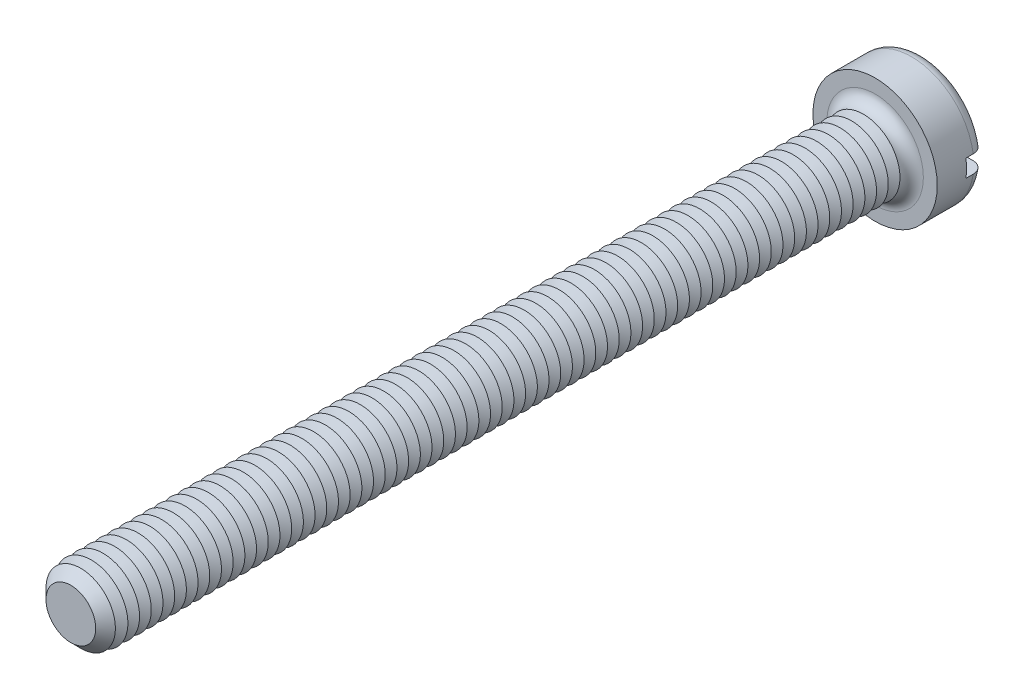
ISO-10303-21;
HEADER;
FILE_DESCRIPTION(('STEP AP214'),'2;1');
FILE_NAME('part.step','',(''),(''),'','','');
FILE_SCHEMA(('AUTOMOTIVE_DESIGN { 1 0 10303 214 1 1 1 1 }'));
ENDSEC;
DATA;
#1=APPLICATION_CONTEXT('core data for automotive mechanical design processes');
#2=APPLICATION_PROTOCOL_DEFINITION('international standard','automotive_design',2000,#1);
#3=PRODUCT_CONTEXT('',#1,'mechanical');
#4=PRODUCT('Part','Part','',(#3));
#5=PRODUCT_RELATED_PRODUCT_CATEGORY('part','',(#4));
#6=PRODUCT_DEFINITION_FORMATION('','',#4);
#7=PRODUCT_DEFINITION_CONTEXT('part definition',#1,'design');
#8=PRODUCT_DEFINITION('design','',#6,#7);
#9=PRODUCT_DEFINITION_SHAPE('','',#8);
#10=(LENGTH_UNIT() NAMED_UNIT(*) SI_UNIT(.MILLI.,.METRE.));
#11=(NAMED_UNIT(*) PLANE_ANGLE_UNIT() SI_UNIT($,.RADIAN.));
#12=(NAMED_UNIT(*) SI_UNIT($,.STERADIAN.) SOLID_ANGLE_UNIT());
#13=UNCERTAINTY_MEASURE_WITH_UNIT(LENGTH_MEASURE(1.E-05),#10,'distance_accuracy_value','');
#14=(GEOMETRIC_REPRESENTATION_CONTEXT(3) GLOBAL_UNCERTAINTY_ASSIGNED_CONTEXT((#13)) GLOBAL_UNIT_ASSIGNED_CONTEXT((#10,
#11,#12)) REPRESENTATION_CONTEXT('',''));
#15=CARTESIAN_POINT('',(0.,0.,0.));
#16=DIRECTION('',(0.,0.,1.));
#17=DIRECTION('',(1.,0.,0.));
#18=AXIS2_PLACEMENT_3D('',#15,#16,#17);
#19=CARTESIAN_POINT('',(0.,0.,-3.3));
#20=DIRECTION('',(0.,0.,1.));
#21=DIRECTION('',(1.,0.,0.));
#22=AXIS2_PLACEMENT_3D('',#19,#20,#21);
#23=PLANE('',#22);
#24=CARTESIAN_POINT('',(0.,0.,-3.3));
#25=DIRECTION('',(0.,0.,1.));
#26=DIRECTION('',(1.,0.,0.));
#27=AXIS2_PLACEMENT_3D('',#24,#25,#26);
#28=CIRCLE('',#27,3.45);
#29=CARTESIAN_POINT('',(-3.39742549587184,0.6,-3.3));
#30=VERTEX_POINT('',#29);
#31=CARTESIAN_POINT('',(3.39742549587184,0.6,-3.3));
#32=VERTEX_POINT('',#31);
#33=EDGE_CURVE('E116',#30,#32,#28,.F.);
#34=ORIENTED_EDGE('',*,*,#33,.T.);
#35=DIRECTION('',(1.,0.,0.));
#36=VECTOR('',#35,1.);
#37=CARTESIAN_POINT('',(-4.25,0.600000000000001,-3.3));
#38=LINE('',#37,#36);
#39=EDGE_CURVE('E111',#30,#32,#38,.T.);
#40=ORIENTED_EDGE('',*,*,#39,.F.);
#41=EDGE_LOOP('',(#34,#40));
#42=FACE_BOUND('',#41,.T.);
#43=ADVANCED_FACE('F39',(#42),#23,.F.);
#44=CARTESIAN_POINT('',(0.,0.,-2.5));
#45=DIRECTION('',(0.,0.,1.));
#46=DIRECTION('',(1.,0.,0.));
#47=AXIS2_PLACEMENT_3D('',#44,#45,#46);
#48=TOROIDAL_SURFACE('',#47,3.45,0.8);
#49=CARTESIAN_POINT('',(-4.06369072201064,0.600000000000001,-2.95537828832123));
#50=CARTESIAN_POINT('',(-4.03774340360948,0.600000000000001,-2.99245078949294));
#51=CARTESIAN_POINT('',(-4.00861849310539,0.600000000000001,-3.02734231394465));
#52=CARTESIAN_POINT('',(-3.94488199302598,0.600000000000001,-3.0917502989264));
#53=CARTESIAN_POINT('',(-3.91026320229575,0.600000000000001,-3.12125959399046));
#54=CARTESIAN_POINT('',(-3.83660561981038,0.600000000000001,-3.17403695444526));
#55=CARTESIAN_POINT('',(-3.79757117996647,0.6,-3.19731109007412));
#56=CARTESIAN_POINT('',(-3.71618817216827,0.6,-3.23703443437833));
#57=CARTESIAN_POINT('',(-3.67384041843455,0.6,-3.25348531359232));
#58=CARTESIAN_POINT('',(-3.58661930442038,0.6,-3.2792758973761));
#59=CARTESIAN_POINT('',(-3.54172669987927,0.6,-3.288550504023));
#60=CARTESIAN_POINT('',(-3.45102322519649,0.6,-3.29952632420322));
#61=CARTESIAN_POINT('',(-3.40521225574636,0.6,-3.30122671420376));
#62=CARTESIAN_POINT('',(-3.31340831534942,0.6,-3.29701196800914));
#63=CARTESIAN_POINT('',(-3.26741940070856,0.6,-3.29100823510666));
#64=CARTESIAN_POINT('',(-3.17708556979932,0.6,-3.27141469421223));
#65=CARTESIAN_POINT('',(-3.13274074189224,0.6,-3.25782447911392));
#66=CARTESIAN_POINT('',(-3.0466814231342,0.6,-3.22332549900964));
#67=CARTESIAN_POINT('',(-3.00498444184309,0.6,-3.20237301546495));
#68=CARTESIAN_POINT('',(-2.92572251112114,0.6,-3.15372961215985));
#69=CARTESIAN_POINT('',(-2.88815755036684,0.6,-3.12603871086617));
#70=CARTESIAN_POINT('',(-2.81847654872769,0.6,-3.06483322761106));
#71=CARTESIAN_POINT('',(-2.78633186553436,0.6,-3.03135128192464));
#72=CARTESIAN_POINT('',(-2.72824805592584,0.6,-2.95937651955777));
#73=CARTESIAN_POINT('',(-2.70230829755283,0.6,-2.92088421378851));
#74=CARTESIAN_POINT('',(-2.65791262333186,0.6,-2.84074227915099));
#75=CARTESIAN_POINT('',(-2.63932560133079,0.6,-2.79916531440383));
#76=CARTESIAN_POINT('',(-2.60958432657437,0.6,-2.7134333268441));
#77=CARTESIAN_POINT('',(-2.59842889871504,0.6,-2.66927871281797));
#78=CARTESIAN_POINT('',(-2.58411140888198,0.6,-2.58073966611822));
#79=CARTESIAN_POINT('',(-2.58077086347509,0.6,-2.5363840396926));
#80=CARTESIAN_POINT('',(-2.58167367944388,0.6,-2.44775208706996));
#81=CARTESIAN_POINT('',(-2.58591644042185,0.6,-2.40347575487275));
#82=CARTESIAN_POINT('',(-2.60175154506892,0.6,-2.31675105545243));
#83=CARTESIAN_POINT('',(-2.61326489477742,0.6,-2.27428821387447));
#84=CARTESIAN_POINT('',(-2.6431863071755,0.6,-2.19186794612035));
#85=CARTESIAN_POINT('',(-2.66159465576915,0.6,-2.15191062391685));
#86=CARTESIAN_POINT('',(-2.70494650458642,0.6,-2.07517696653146));
#87=CARTESIAN_POINT('',(-2.72995486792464,0.6,-2.03843731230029));
#88=CARTESIAN_POINT('',(-2.7856570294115,0.6,-1.96955746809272));
#89=CARTESIAN_POINT('',(-2.81635145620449,0.6,-1.93741778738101));
#90=CARTESIAN_POINT('',(-2.88329572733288,0.6,-1.87788048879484));
#91=CARTESIAN_POINT('',(-2.91965530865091,0.6,-1.85060625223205));
#92=CARTESIAN_POINT('',(-2.9963658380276,0.6,-1.80241044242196));
#93=CARTESIAN_POINT('',(-3.03671721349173,0.6,-1.78148955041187));
#94=CARTESIAN_POINT('',(-3.12111125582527,0.6,-1.74619829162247));
#95=CARTESIAN_POINT('',(-3.16521020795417,0.6,-1.73196239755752));
#96=CARTESIAN_POINT('',(-3.25516487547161,0.6,-1.71103773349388));
#97=CARTESIAN_POINT('',(-3.30102068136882,0.6,-1.70434935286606));
#98=CARTESIAN_POINT('',(-3.39352689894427,0.6,-1.69870104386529));
#99=CARTESIAN_POINT('',(-3.44018061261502,0.6,-1.69979487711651));
#100=CARTESIAN_POINT('',(-3.53263583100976,0.6,-1.70983959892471));
#101=CARTESIAN_POINT('',(-3.57843734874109,0.6,-1.71879036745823));
#102=CARTESIAN_POINT('',(-3.66763544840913,0.6,-1.74426972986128));
#103=CARTESIAN_POINT('',(-3.71104292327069,0.6,-1.76076015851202));
#104=CARTESIAN_POINT('',(-3.79442616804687,0.6,-1.80087686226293));
#105=CARTESIAN_POINT('',(-3.83440212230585,0.600000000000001,-1.82450275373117));
#106=CARTESIAN_POINT('',(-3.90929765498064,0.600000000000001,-1.87793548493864));
#107=CARTESIAN_POINT('',(-3.94426963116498,0.600000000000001,-1.90766887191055));
#108=CARTESIAN_POINT('',(-4.00864839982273,0.600000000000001,-1.9726503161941));
#109=CARTESIAN_POINT('',(-4.03805555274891,0.600000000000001,-2.00789801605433));
#110=CARTESIAN_POINT('',(-4.09009460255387,0.600000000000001,-2.08244463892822));
#111=CARTESIAN_POINT('',(-4.11280448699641,0.600000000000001,-2.12168912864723));
#112=CARTESIAN_POINT('',(-4.15124086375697,0.600000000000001,-2.2034588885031));
#113=CARTESIAN_POINT('',(-4.16696802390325,0.600000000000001,-2.24598384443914));
#114=CARTESIAN_POINT('',(-4.19085131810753,0.600000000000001,-2.33267862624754));
#115=CARTESIAN_POINT('',(-4.19907708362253,0.600000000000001,-2.37682928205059));
#116=CARTESIAN_POINT('',(-4.2079638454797,0.600000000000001,-2.46589754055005));
#117=CARTESIAN_POINT('',(-4.20862315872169,0.600000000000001,-2.51081531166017));
#118=CARTESIAN_POINT('',(-4.20236829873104,0.600000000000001,-2.59993343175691));
#119=CARTESIAN_POINT('',(-4.19548454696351,0.600000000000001,-2.64413593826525));
#120=CARTESIAN_POINT('',(-4.17439924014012,0.600000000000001,-2.73071930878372));
#121=CARTESIAN_POINT('',(-4.16020675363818,0.600000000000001,-2.77310235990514));
#122=CARTESIAN_POINT('',(-4.1318825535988,0.600000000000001,-2.83880495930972));
#123=CARTESIAN_POINT('',(-4.11991183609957,0.600000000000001,-2.86307959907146));
#124=CARTESIAN_POINT('',(-4.09356927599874,0.600000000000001,-2.91028856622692));
#125=CARTESIAN_POINT('',(-4.07919744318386,0.600000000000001,-2.9332228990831));
#126=CARTESIAN_POINT('',(-4.06369072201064,0.600000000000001,-2.95537828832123));
#127=B_SPLINE_CURVE_WITH_KNOTS('',3,(#49,#50,#51,#52,#53,#54,#55,#56,#57,#58,#59,#60,#61,#62,
#63,#64,#65,#66,#67,#68,#69,#70,#71,#72,#73,#74,#75,#76,#77,#78,#79,#80,#81,#82,#83,#84,#85,#86,
#87,#88,#89,#90,#91,#92,#93,#94,#95,#96,#97,#98,#99,#100,#101,#102,#103,#104,#105,#106,#107,
#108,#109,#110,#111,#112,#113,#114,#115,#116,#117,#118,#119,#120,#121,#122,#123,#124,#125,#126),
.UNSPECIFIED.,.T.,.F.,(4,2,2,2,2,2,2,2,2,2,2,2,2,2,2,2,2,2,2,2,2,2,2,2,2,2,2,2,2,2,2,2,2,2,2,2,
2,2,4),(0.,0.13565225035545,0.271483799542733,0.407182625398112,0.542848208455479,
0.679730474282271,0.816627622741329,0.955113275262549,1.09360635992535,1.23293614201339,
1.37226554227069,1.51083389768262,1.64938813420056,1.78534653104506,1.92128342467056,
2.0540840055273,2.18687407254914,2.31824564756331,2.44962267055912,2.58234229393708,
2.71507659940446,2.85080630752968,2.98655056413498,3.12491938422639,3.26329534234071,
3.40262816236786,3.54195885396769,3.68059194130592,3.81921757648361,3.95626453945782,
4.09330262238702,4.2286754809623,4.36403538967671,4.49812564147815,4.63224572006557,
4.76582687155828,4.89924267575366,4.98031194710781,5.0613808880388),.UNSPECIFIED.);
#128=CARTESIAN_POINT('',(-4.20743389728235,0.600000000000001,-2.50000000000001));
#129=VERTEX_POINT('',#128);
#130=EDGE_CURVE('E721',#129,#30,#127,.T.);
#131=ORIENTED_EDGE('',*,*,#130,.F.);
#132=CARTESIAN_POINT('',(0.,0.,-2.5));
#133=DIRECTION('',(0.,0.,1.));
#134=DIRECTION('',(1.,0.,0.));
#135=AXIS2_PLACEMENT_3D('',#132,#133,#134);
#136=CIRCLE('',#135,4.25);
#137=CARTESIAN_POINT('',(4.20743389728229,0.599999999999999,-2.5));
#138=VERTEX_POINT('',#137);
#139=EDGE_CURVE('E125',#138,#129,#136,.T.);
#140=ORIENTED_EDGE('',*,*,#139,.F.);
#141=CARTESIAN_POINT('',(2.63947327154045,0.6,-2.79608831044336));
#142=CARTESIAN_POINT('',(2.65655980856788,0.6,-2.83790320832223));
#143=CARTESIAN_POINT('',(2.67725642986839,0.6,-2.87828303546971));
#144=CARTESIAN_POINT('',(2.72519250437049,0.6,-2.95500233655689));
#145=CARTESIAN_POINT('',(2.75244152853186,0.6,-2.9913357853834));
#146=CARTESIAN_POINT('',(2.81257938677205,0.6,-3.05889430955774));
#147=CARTESIAN_POINT('',(2.84545995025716,0.6,-3.09012674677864));
#148=CARTESIAN_POINT('',(2.91591143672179,0.6,-3.14672620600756));
#149=CARTESIAN_POINT('',(2.95348119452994,0.6,-3.17209468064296));
#150=CARTESIAN_POINT('',(3.03291143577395,0.6,-3.21669611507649));
#151=CARTESIAN_POINT('',(3.07483186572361,0.6,-3.23582234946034));
#152=CARTESIAN_POINT('',(3.16126659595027,0.6,-3.26686062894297));
#153=CARTESIAN_POINT('',(3.2057811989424,0.6,-3.27877183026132));
#154=CARTESIAN_POINT('',(3.29669878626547,0.6,-3.29514603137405));
#155=CARTESIAN_POINT('',(3.34311773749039,0.6,-3.29952056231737));
#156=CARTESIAN_POINT('',(3.43603189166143,0.6,-3.30040472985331));
#157=CARTESIAN_POINT('',(3.48252709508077,0.6,-3.29691431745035));
#158=CARTESIAN_POINT('',(3.57420049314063,0.6,-3.28214240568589));
#159=CARTESIAN_POINT('',(3.61938038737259,0.6,-3.27087147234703));
#160=CARTESIAN_POINT('',(3.70717477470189,0.6,-3.24082890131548));
#161=CARTESIAN_POINT('',(3.74978938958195,0.6,-3.22205762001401));
#162=CARTESIAN_POINT('',(3.83078828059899,0.6,-3.17773607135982));
#163=CARTESIAN_POINT('',(3.86921015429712,0.599999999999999,-3.15225453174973));
#164=CARTESIAN_POINT('',(3.94116038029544,0.599999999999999,-3.09512672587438));
#165=CARTESIAN_POINT('',(3.9746890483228,0.599999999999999,-3.06348085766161));
#166=CARTESIAN_POINT('',(4.03545911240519,0.599999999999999,-2.99534640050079));
#167=CARTESIAN_POINT('',(4.06277344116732,0.599999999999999,-2.95892285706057));
#168=CARTESIAN_POINT('',(4.11082191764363,0.599999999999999,-2.88196698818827));
#169=CARTESIAN_POINT('',(4.13155647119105,0.599999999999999,-2.84143491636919));
#170=CARTESIAN_POINT('',(4.16563480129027,0.599999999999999,-2.75787550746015));
#171=CARTESIAN_POINT('',(4.1790544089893,0.599999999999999,-2.71487908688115));
#172=CARTESIAN_POINT('',(4.19843340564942,0.599999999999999,-2.62723691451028));
#173=CARTESIAN_POINT('',(4.20439310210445,0.599999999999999,-2.58259123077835));
#174=CARTESIAN_POINT('',(4.2086595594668,0.599999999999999,-2.49321831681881));
#175=CARTESIAN_POINT('',(4.20701422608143,0.599999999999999,-2.4484933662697));
#176=CARTESIAN_POINT('',(4.1962295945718,0.599999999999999,-2.35995704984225));
#177=CARTESIAN_POINT('',(4.18709040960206,0.599999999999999,-2.31614567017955));
#178=CARTESIAN_POINT('',(4.16160290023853,0.599999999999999,-2.23072100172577));
#179=CARTESIAN_POINT('',(4.14526169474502,0.599999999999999,-2.18910558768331));
#180=CARTESIAN_POINT('',(4.10585410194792,0.599999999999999,-2.10919238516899));
#181=CARTESIAN_POINT('',(4.08278762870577,0.599999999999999,-2.07089463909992));
#182=CARTESIAN_POINT('',(4.030487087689,0.599999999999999,-1.99851484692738));
#183=CARTESIAN_POINT('',(4.00122628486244,0.599999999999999,-1.9644521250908));
#184=CARTESIAN_POINT('',(3.93744772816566,0.599999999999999,-1.90166877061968));
#185=CARTESIAN_POINT('',(3.90292977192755,0.599999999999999,-1.87294834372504));
#186=CARTESIAN_POINT('',(3.82928727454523,0.599999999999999,-1.82137853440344));
#187=CARTESIAN_POINT('',(3.79012374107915,0.6,-1.79858484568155));
#188=CARTESIAN_POINT('',(3.70856025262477,0.6,-1.75980712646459));
#189=CARTESIAN_POINT('',(3.66616010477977,0.6,-1.74382350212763));
#190=CARTESIAN_POINT('',(3.57878495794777,0.6,-1.71891499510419));
#191=CARTESIAN_POINT('',(3.53378519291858,0.6,-1.71007699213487));
#192=CARTESIAN_POINT('',(3.44294322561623,0.6,-1.69998722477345));
#193=CARTESIAN_POINT('',(3.3971009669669,0.6,-1.69873596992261));
#194=CARTESIAN_POINT('',(3.30531297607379,0.6,-1.70385439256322));
#195=CARTESIAN_POINT('',(3.25937213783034,0.6,-1.71031204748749));
#196=CARTESIAN_POINT('',(3.1692099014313,0.6,-1.73080107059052));
#197=CARTESIAN_POINT('',(3.12498860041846,0.6,-1.74483286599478));
#198=CARTESIAN_POINT('',(3.03926209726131,0.6,-1.78018941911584));
#199=CARTESIAN_POINT('',(2.99777407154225,0.6,-1.80155586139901));
#200=CARTESIAN_POINT('',(2.91899881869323,0.6,-1.85098881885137));
#201=CARTESIAN_POINT('',(2.88171158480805,0.6,-1.8790553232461));
#202=CARTESIAN_POINT('',(2.81266124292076,0.6,-1.94094884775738));
#203=CARTESIAN_POINT('',(2.78086710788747,0.6,-1.97474122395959));
#204=CARTESIAN_POINT('',(2.72353615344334,0.6,-2.0472724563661));
#205=CARTESIAN_POINT('',(2.69799841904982,0.6,-2.08601058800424));
#206=CARTESIAN_POINT('',(2.65444718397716,0.6,-2.16655019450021));
#207=CARTESIAN_POINT('',(2.63629889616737,0.6,-2.20827875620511));
#208=CARTESIAN_POINT('',(2.60744942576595,0.6,-2.29424821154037));
#209=CARTESIAN_POINT('',(2.59674901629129,0.6,-2.33848936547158));
#210=CARTESIAN_POINT('',(2.5833312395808,0.6,-2.42714258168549));
#211=CARTESIAN_POINT('',(2.58043995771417,0.6,-2.47152848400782));
#212=CARTESIAN_POINT('',(2.58224493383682,0.6,-2.56010574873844));
#213=CARTESIAN_POINT('',(2.58693104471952,0.6,-2.60429729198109));
#214=CARTESIAN_POINT('',(2.60020046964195,0.6,-2.67311978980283));
#215=CARTESIAN_POINT('',(2.60635343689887,0.6,-2.69824441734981));
#216=CARTESIAN_POINT('',(2.62110140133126,0.6,-2.74776540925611));
#217=CARTESIAN_POINT('',(2.62969634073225,0.6,-2.77216179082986));
#218=CARTESIAN_POINT('',(2.63947327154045,0.6,-2.79608831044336));
#219=B_SPLINE_CURVE_WITH_KNOTS('',3,(#141,#142,#143,#144,#145,#146,#147,#148,#149,#150,#151,
#152,#153,#154,#155,#156,#157,#158,#159,#160,#161,#162,#163,#164,#165,#166,#167,#168,#169,#170,
#171,#172,#173,#174,#175,#176,#177,#178,#179,#180,#181,#182,#183,#184,#185,#186,#187,#188,#189,
#190,#191,#192,#193,#194,#195,#196,#197,#198,#199,#200,#201,#202,#203,#204,#205,#206,#207,#208,
#209,#210,#211,#212,#213,#214,#215,#216,#217,#218),.UNSPECIFIED.,.T.,.F.,(4,2,2,2,2,2,2,2,2,2,2,
2,2,2,2,2,2,2,2,2,2,2,2,2,2,2,2,2,2,2,2,2,2,2,2,2,2,2,4),(0.,0.135416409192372,
0.271031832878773,0.406449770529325,0.541834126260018,0.679424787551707,0.817031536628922,
0.956242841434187,1.09545501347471,1.23447850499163,1.37349539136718,1.51114036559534,
1.64877645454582,1.78470267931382,1.92062051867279,2.05510117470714,2.1895762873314,
2.32320547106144,2.45683263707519,2.59032801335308,2.72382509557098,2.85791055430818,
2.99200117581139,3.12730969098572,3.26262627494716,3.39956435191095,3.53651162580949,
3.67503685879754,3.81356990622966,3.95290367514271,4.09223721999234,4.23075602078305,
4.36925455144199,4.50509949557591,4.6409585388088,4.77376594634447,4.90639565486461,
4.98388287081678,5.06136825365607),.UNSPECIFIED.);
#220=EDGE_CURVE('E723',#32,#138,#219,.T.);
#221=ORIENTED_EDGE('',*,*,#220,.F.);
#222=ORIENTED_EDGE('',*,*,#33,.F.);
#223=EDGE_LOOP('',(#131,#140,#221,#222));
#224=FACE_BOUND('',#223,.T.);
#225=ADVANCED_FACE('F705',(#224),#48,.T.);
#226=CARTESIAN_POINT('',(0.,0.,-3.3));
#227=DIRECTION('',(0.,0.,1.));
#228=DIRECTION('',(1.,0.,0.));
#229=AXIS2_PLACEMENT_3D('',#226,#227,#228);
#230=CYLINDRICAL_SURFACE('',#229,4.25);
#231=DIRECTION('',(0.,0.,1.));
#232=VECTOR('',#231,1.);
#233=CARTESIAN_POINT('',(4.20743389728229,0.599999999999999,-3.3));
#234=LINE('',#233,#232);
#235=CARTESIAN_POINT('',(4.20743389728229,0.599999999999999,-2.));
#236=VERTEX_POINT('',#235);
#237=EDGE_CURVE('E739',#138,#236,#234,.T.);
#238=ORIENTED_EDGE('',*,*,#237,.F.);
#239=ORIENTED_EDGE('',*,*,#139,.T.);
#240=DIRECTION('',(0.,0.,1.));
#241=VECTOR('',#240,1.);
#242=CARTESIAN_POINT('',(-4.20743389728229,0.600000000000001,-3.3));
#243=LINE('',#242,#241);
#244=CARTESIAN_POINT('',(-4.20743389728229,0.600000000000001,-2.));
#245=VERTEX_POINT('',#244);
#246=EDGE_CURVE('E63',#245,#129,#243,.F.);
#247=ORIENTED_EDGE('',*,*,#246,.F.);
#248=CARTESIAN_POINT('',(0.,0.,-2.));
#249=DIRECTION('',(0.,0.,-1.));
#250=DIRECTION('',(-1.,0.,0.));
#251=AXIS2_PLACEMENT_3D('',#248,#249,#250);
#252=CIRCLE('',#251,4.25);
#253=CARTESIAN_POINT('',(-4.20743389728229,-0.599999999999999,-2.));
#254=VERTEX_POINT('',#253);
#255=EDGE_CURVE('E43',#245,#254,#252,.F.);
#256=ORIENTED_EDGE('',*,*,#255,.T.);
#257=DIRECTION('',(0.,0.,1.));
#258=VECTOR('',#257,1.);
#259=CARTESIAN_POINT('',(-4.20743389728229,-0.599999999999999,-3.3));
#260=LINE('',#259,#258);
#261=CARTESIAN_POINT('',(-4.20743389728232,-0.599999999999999,-2.5));
#262=VERTEX_POINT('',#261);
#263=EDGE_CURVE('E736',#262,#254,#260,.T.);
#264=ORIENTED_EDGE('',*,*,#263,.F.);
#265=CARTESIAN_POINT('',(4.20743389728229,-0.600000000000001,-2.5));
#266=VERTEX_POINT('',#265);
#267=EDGE_CURVE('E127',#262,#266,#136,.T.);
#268=ORIENTED_EDGE('',*,*,#267,.T.);
#269=DIRECTION('',(0.,0.,1.));
#270=VECTOR('',#269,1.);
#271=CARTESIAN_POINT('',(4.20743389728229,-0.600000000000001,-3.3));
#272=LINE('',#271,#270);
#273=CARTESIAN_POINT('',(4.20743389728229,-0.600000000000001,-2.));
#274=VERTEX_POINT('',#273);
#275=EDGE_CURVE('E55',#274,#266,#272,.F.);
#276=ORIENTED_EDGE('',*,*,#275,.F.);
#277=EDGE_CURVE('E11',#274,#236,#252,.F.);
#278=ORIENTED_EDGE('',*,*,#277,.T.);
#279=EDGE_LOOP('',(#238,#239,#247,#256,#264,#268,#276,#278));
#280=FACE_BOUND('',#279,.T.);
#281=CARTESIAN_POINT('',(0.,0.,0.));
#282=DIRECTION('',(0.,0.,1.));
#283=DIRECTION('',(1.,0.,0.));
#284=AXIS2_PLACEMENT_3D('',#281,#282,#283);
#285=CIRCLE('',#284,4.25);
#286=CARTESIAN_POINT('',(4.25,0.,0.));
#287=VERTEX_POINT('',#286);
#288=EDGE_CURVE('E742',#287,#287,#285,.T.);
#289=ORIENTED_EDGE('',*,*,#288,.F.);
#290=EDGE_LOOP('',(#289));
#291=FACE_BOUND('',#290,.T.);
#292=ADVANCED_FACE('F701',(#280,#291),#230,.T.);
#293=CARTESIAN_POINT('',(3.39742549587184,-0.6,-3.3));
#294=VERTEX_POINT('',#293);
#295=CARTESIAN_POINT('',(-3.39742549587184,-0.6,-3.3));
#296=VERTEX_POINT('',#295);
#297=EDGE_CURVE('E109',#294,#296,#28,.F.);
#298=ORIENTED_EDGE('',*,*,#297,.T.);
#299=DIRECTION('',(-1.,0.,0.));
#300=VECTOR('',#299,1.);
#301=CARTESIAN_POINT('',(-4.25,-0.599999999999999,-3.3));
#302=LINE('',#301,#300);
#303=EDGE_CURVE('E96',#294,#296,#302,.T.);
#304=ORIENTED_EDGE('',*,*,#303,.F.);
#305=EDGE_LOOP('',(#298,#304));
#306=FACE_BOUND('',#305,.T.);
#307=ADVANCED_FACE('F108',(#306),#23,.F.);
#308=CARTESIAN_POINT('',(0.,0.,0.));
#309=DIRECTION('',(0.,0.,1.));
#310=DIRECTION('',(1.,0.,0.));
#311=AXIS2_PLACEMENT_3D('',#308,#309,#310);
#312=PLANE('',#311);
#313=CARTESIAN_POINT('',(0.,0.,0.));
#314=DIRECTION('',(0.,0.,1.));
#315=DIRECTION('',(1.,0.,0.));
#316=AXIS2_PLACEMENT_3D('',#313,#314,#315);
#317=CIRCLE('',#316,3.3);
#318=CARTESIAN_POINT('',(3.3,0.,0.));
#319=VERTEX_POINT('',#318);
#320=EDGE_CURVE('E115',#319,#319,#317,.F.);
#321=ORIENTED_EDGE('',*,*,#320,.T.);
#322=EDGE_LOOP('',(#321));
#323=FACE_BOUND('',#322,.T.);
#324=ORIENTED_EDGE('',*,*,#288,.T.);
#325=EDGE_LOOP('',(#324));
#326=FACE_BOUND('',#325,.T.);
#327=ADVANCED_FACE('F700',(#323,#326),#312,.T.);
#328=CARTESIAN_POINT('',(-4.06369072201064,-0.599999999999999,-2.95537828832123));
#329=CARTESIAN_POINT('',(-4.08928577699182,-0.599999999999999,-2.91880204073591));
#330=CARTESIAN_POINT('',(-4.11182555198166,-0.599999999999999,-2.88005030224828));
#331=CARTESIAN_POINT('',(-4.15010404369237,-0.599999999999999,-2.79928452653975));
#332=CARTESIAN_POINT('',(-4.16583526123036,-0.599999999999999,-2.75726695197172));
#333=CARTESIAN_POINT('',(-4.19000286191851,-0.599999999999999,-2.67118996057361));
#334=CARTESIAN_POINT('',(-4.19844101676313,-0.599999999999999,-2.62713104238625));
#335=CARTESIAN_POINT('',(-4.20777174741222,-0.599999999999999,-2.53823222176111));
#336=CARTESIAN_POINT('',(-4.20866608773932,-0.599999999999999,-2.49339250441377));
#337=CARTESIAN_POINT('',(-4.20289683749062,-0.599999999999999,-2.40433856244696));
#338=CARTESIAN_POINT('',(-4.19625607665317,-0.599999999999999,-2.36012285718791));
#339=CARTESIAN_POINT('',(-4.17565084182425,-0.599999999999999,-2.27343166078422));
#340=CARTESIAN_POINT('',(-4.16168615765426,-0.599999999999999,-2.23095621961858));
#341=CARTESIAN_POINT('',(-4.12683188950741,-0.599999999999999,-2.14890863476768));
#342=CARTESIAN_POINT('',(-4.10593663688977,-0.599999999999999,-2.10933890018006));
#343=CARTESIAN_POINT('',(-4.05783763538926,-0.599999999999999,-2.03424145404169));
#344=CARTESIAN_POINT('',(-4.03063375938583,-0.599999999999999,-1.99871382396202));
#345=CARTESIAN_POINT('',(-3.97052236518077,-0.599999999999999,-1.93246905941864));
#346=CARTESIAN_POINT('',(-3.93758114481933,-0.599999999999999,-1.90178251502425));
#347=CARTESIAN_POINT('',(-3.86706007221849,-0.599999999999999,-1.84630837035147));
#348=CARTESIAN_POINT('',(-3.82948001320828,-0.6,-1.82152103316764));
#349=CARTESIAN_POINT('',(-3.75033766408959,-0.6,-1.77826995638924));
#350=CARTESIAN_POINT('',(-3.70873831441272,-0.6,-1.7598740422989));
#351=CARTESIAN_POINT('',(-3.62306661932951,-0.6,-1.73023196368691));
#352=CARTESIAN_POINT('',(-3.57899411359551,-0.6,-1.71898626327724));
#353=CARTESIAN_POINT('',(-3.48904845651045,-0.6,-1.70382025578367));
#354=CARTESIAN_POINT('',(-3.44315982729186,-0.6,-1.69999172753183));
#355=CARTESIAN_POINT('',(-3.35138360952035,-0.6,-1.7000083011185));
#356=CARTESIAN_POINT('',(-3.30549602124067,-0.6,-1.70385391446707));
#357=CARTESIAN_POINT('',(-3.21452492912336,-0.6,-1.71917227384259));
#358=CARTESIAN_POINT('',(-3.16945455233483,-0.6,-1.73072307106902));
#359=CARTESIAN_POINT('',(-3.08188104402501,-0.6,-1.76120640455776));
#360=CARTESIAN_POINT('',(-3.0393780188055,-0.6,-1.78013924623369));
#361=CARTESIAN_POINT('',(-2.95805296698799,-0.6,-1.82493384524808));
#362=CARTESIAN_POINT('',(-2.9192403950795,-0.6,-1.85081278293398));
#363=CARTESIAN_POINT('',(-2.84656695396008,-0.6,-1.90878317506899));
#364=CARTESIAN_POINT('',(-2.81270591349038,-0.6,-1.94087441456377));
#365=CARTESIAN_POINT('',(-2.75131050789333,-0.6,-2.01002500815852));
#366=CARTESIAN_POINT('',(-2.72371339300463,-0.6,-2.04702860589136));
#367=CARTESIAN_POINT('',(-2.67528742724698,-0.6,-2.12522869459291));
#368=CARTESIAN_POINT('',(-2.65445765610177,-0.6,-2.1664246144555));
#369=CARTESIAN_POINT('',(-2.62065354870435,-0.6,-2.25087266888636));
#370=CARTESIAN_POINT('',(-2.60751663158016,-0.6,-2.29405971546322));
#371=CARTESIAN_POINT('',(-2.58885106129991,-0.6,-2.38204659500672));
#372=CARTESIAN_POINT('',(-2.58332131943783,-0.6,-2.42684619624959));
#373=CARTESIAN_POINT('',(-2.58009777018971,-0.6,-2.51580379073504));
#374=CARTESIAN_POINT('',(-2.58224575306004,-0.6,-2.55995612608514));
#375=CARTESIAN_POINT('',(-2.59395205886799,-0.6,-2.64726495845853));
#376=CARTESIAN_POINT('',(-2.60351013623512,-0.6,-2.69042148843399));
#377=CARTESIAN_POINT('',(-2.62967159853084,-0.6,-2.77438771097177));
#378=CARTESIAN_POINT('',(-2.64625243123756,-0.6,-2.81520444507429));
#379=CARTESIAN_POINT('',(-2.68592348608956,-0.6,-2.89353901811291));
#380=CARTESIAN_POINT('',(-2.70901418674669,-0.6,-2.9310566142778));
#381=CARTESIAN_POINT('',(-2.7614318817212,-0.6,-3.00240040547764));
#382=CARTESIAN_POINT('',(-2.79085487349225,-0.6,-3.03615603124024));
#383=CARTESIAN_POINT('',(-2.85483456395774,-0.6,-3.09838834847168));
#384=CARTESIAN_POINT('',(-2.88939187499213,-0.6,-3.12686440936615));
#385=CARTESIAN_POINT('',(-2.96351967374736,-0.6,-3.17841283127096));
#386=CARTESIAN_POINT('',(-3.00318741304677,-0.6,-3.20134539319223));
#387=CARTESIAN_POINT('',(-3.08576649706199,-0.6,-3.24034364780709));
#388=CARTESIAN_POINT('',(-3.12867814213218,-0.6,-3.25640870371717));
#389=CARTESIAN_POINT('',(-3.21724048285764,-0.6,-3.28143816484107));
#390=CARTESIAN_POINT('',(-3.26292314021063,-0.6,-3.29028963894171));
#391=CARTESIAN_POINT('',(-3.35512527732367,-0.6,-3.30021681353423));
#392=CARTESIAN_POINT('',(-3.40164474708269,-0.6,-3.30129260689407));
#393=CARTESIAN_POINT('',(-3.49429978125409,-0.6,-3.29560589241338));
#394=CARTESIAN_POINT('',(-3.54043436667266,-0.6,-3.28882735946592));
#395=CARTESIAN_POINT('',(-3.63090382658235,-0.6,-3.26755492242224));
#396=CARTESIAN_POINT('',(-3.67523831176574,-0.6,-3.25305935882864));
#397=CARTESIAN_POINT('',(-3.76046509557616,-0.6,-3.21686867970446));
#398=CARTESIAN_POINT('',(-3.80138087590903,-0.599999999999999,-3.1952288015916));
#399=CARTESIAN_POINT('',(-3.8788986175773,-0.599999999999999,-3.14531817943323));
#400=CARTESIAN_POINT('',(-3.91550599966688,-0.599999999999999,-3.11705590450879));
#401=CARTESIAN_POINT('',(-3.97074313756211,-0.599999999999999,-3.06628809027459));
#402=CARTESIAN_POINT('',(-3.99100743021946,-0.599999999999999,-3.04553102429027));
#403=CARTESIAN_POINT('',(-4.02917385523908,-0.599999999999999,-3.00194762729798));
#404=CARTESIAN_POINT('',(-4.04707600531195,-0.599999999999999,-2.97912131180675));
#405=CARTESIAN_POINT('',(-4.06369072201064,-0.599999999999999,-2.95537828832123));
#406=B_SPLINE_CURVE_WITH_KNOTS('',3,(#328,#329,#330,#331,#332,#333,#334,#335,#336,#337,#338,
#339,#340,#341,#342,#343,#344,#345,#346,#347,#348,#349,#350,#351,#352,#353,#354,#355,#356,#357,
#358,#359,#360,#361,#362,#363,#364,#365,#366,#367,#368,#369,#370,#371,#372,#373,#374,#375,#376,
#377,#378,#379,#380,#381,#382,#383,#384,#385,#386,#387,#388,#389,#390,#391,#392,#393,#394,#395,
#396,#397,#398,#399,#400,#401,#402,#403,#404,#405),.UNSPECIFIED.,.T.,.F.,(4,2,2,2,2,2,2,2,2,2,2,
2,2,2,2,2,2,2,2,2,2,2,2,2,2,2,2,2,2,2,2,2,2,2,2,2,2,2,4),(0.,0.133821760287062,
0.267790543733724,0.401726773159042,0.535631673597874,0.669131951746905,0.802636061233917,
0.936249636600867,1.06986590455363,1.2042952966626,1.3387306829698,1.47455198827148,
1.61038210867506,1.74788249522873,1.88539204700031,2.02431612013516,2.16324594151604,
2.30252260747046,2.4417944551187,2.57960263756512,2.71739207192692,2.85215325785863,
2.98689515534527,3.11887666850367,3.25085380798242,3.38241030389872,3.51397647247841,
3.64769871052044,3.78143690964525,3.91826005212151,4.05509587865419,4.19403485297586,
4.33297216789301,4.47219345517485,4.61144469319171,4.74964356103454,4.887666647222,
4.97453605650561,5.06140481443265),.UNSPECIFIED.);
#407=EDGE_CURVE('E103',#296,#262,#406,.T.);
#408=ORIENTED_EDGE('',*,*,#407,.F.);
#409=ORIENTED_EDGE('',*,*,#297,.F.);
#410=CARTESIAN_POINT('',(2.63947327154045,-0.6,-2.79608831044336));
#411=CARTESIAN_POINT('',(2.62285766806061,-0.6,-2.75541510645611));
#412=CARTESIAN_POINT('',(2.60963282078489,-0.6,-2.71332585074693));
#413=CARTESIAN_POINT('',(2.59042394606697,-0.6,-2.62749460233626));
#414=CARTESIAN_POINT('',(2.58444686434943,-0.6,-2.58375106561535));
#415=CARTESIAN_POINT('',(2.57995287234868,-0.6,-2.49588524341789));
#416=CARTESIAN_POINT('',(2.58143477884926,-0.6,-2.45176301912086));
#417=CARTESIAN_POINT('',(2.59180622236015,-0.6,-2.36440906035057));
#418=CARTESIAN_POINT('',(2.60069434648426,-0.6,-2.32117715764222));
#419=CARTESIAN_POINT('',(2.62554964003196,-0.6,-2.23689909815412));
#420=CARTESIAN_POINT('',(2.6415022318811,-0.6,-2.19584863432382));
#421=CARTESIAN_POINT('',(2.67996913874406,-0.6,-2.11694797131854));
#422=CARTESIAN_POINT('',(2.70248409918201,-0.6,-2.07909808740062));
#423=CARTESIAN_POINT('',(2.75378972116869,-0.6,-2.00702296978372));
#424=CARTESIAN_POINT('',(2.7826732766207,-0.6,-1.97286389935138));
#425=CARTESIAN_POINT('',(2.84564717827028,-0.6,-1.90974167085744));
#426=CARTESIAN_POINT('',(2.87973812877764,-0.6,-1.88077911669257));
#427=CARTESIAN_POINT('',(2.95300941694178,-0.6,-1.82817307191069));
#428=CARTESIAN_POINT('',(2.99228920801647,-0.6,-1.8046680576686));
#429=CARTESIAN_POINT('',(3.07419050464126,-0.6,-1.76446470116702));
#430=CARTESIAN_POINT('',(3.11681231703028,-0.6,-1.74776698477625));
#431=CARTESIAN_POINT('',(3.20492149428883,-0.6,-1.72140945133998));
#432=CARTESIAN_POINT('',(3.25044365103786,-0.6,-1.71186578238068));
#433=CARTESIAN_POINT('',(3.34244451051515,-0.6,-1.70053183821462));
#434=CARTESIAN_POINT('',(3.38892324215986,-0.6,-1.69874179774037));
#435=CARTESIAN_POINT('',(3.48165030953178,-0.6,-1.70299737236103));
#436=CARTESIAN_POINT('',(3.52789766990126,-0.6,-1.70906439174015));
#437=CARTESIAN_POINT('',(3.61869999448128,-0.6,-1.72893768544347));
#438=CARTESIAN_POINT('',(3.6632550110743,-0.6,-1.742743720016));
#439=CARTESIAN_POINT('',(3.7490339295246,-0.6,-1.77760539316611));
#440=CARTESIAN_POINT('',(3.79028083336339,-0.600000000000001,-1.79860440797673));
#441=CARTESIAN_POINT('',(3.86860401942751,-0.600000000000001,-1.84731105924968));
#442=CARTESIAN_POINT('',(3.90568056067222,-0.600000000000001,-1.87501827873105));
#443=CARTESIAN_POINT('',(3.97412845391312,-0.600000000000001,-1.93599408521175));
#444=CARTESIAN_POINT('',(4.00556369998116,-0.600000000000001,-1.96919094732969));
#445=CARTESIAN_POINT('',(4.06233546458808,-0.600000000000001,-2.0404445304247));
#446=CARTESIAN_POINT('',(4.08767237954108,-0.600000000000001,-2.07850093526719));
#447=CARTESIAN_POINT('',(4.13122502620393,-0.600000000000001,-2.15791791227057));
#448=CARTESIAN_POINT('',(4.14951966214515,-0.600000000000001,-2.19923522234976));
#449=CARTESIAN_POINT('',(4.17884974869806,-0.600000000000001,-2.28437065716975));
#450=CARTESIAN_POINT('',(4.18988555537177,-0.600000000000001,-2.32818865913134));
#451=CARTESIAN_POINT('',(4.20430724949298,-0.600000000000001,-2.41670951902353));
#452=CARTESIAN_POINT('',(4.2077528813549,-0.600000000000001,-2.46140265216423));
#453=CARTESIAN_POINT('',(4.20706844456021,-0.600000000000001,-2.55073028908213));
#454=CARTESIAN_POINT('',(4.20293856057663,-0.600000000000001,-2.595364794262));
#455=CARTESIAN_POINT('',(4.18724926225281,-0.600000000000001,-2.68317733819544));
#456=CARTESIAN_POINT('',(4.17571081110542,-0.600000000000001,-2.72635912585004));
#457=CARTESIAN_POINT('',(4.14556645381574,-0.600000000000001,-2.81017999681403));
#458=CARTESIAN_POINT('',(4.12696052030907,-0.600000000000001,-2.85081907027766));
#459=CARTESIAN_POINT('',(4.08317014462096,-0.600000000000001,-2.92852328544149));
#460=CARTESIAN_POINT('',(4.0579684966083,-0.600000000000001,-2.96557872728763));
#461=CARTESIAN_POINT('',(4.00174565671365,-0.600000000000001,-3.034972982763));
#462=CARTESIAN_POINT('',(3.97072429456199,-0.600000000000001,-3.06731165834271));
#463=CARTESIAN_POINT('',(3.90349659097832,-0.600000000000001,-3.12662735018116));
#464=CARTESIAN_POINT('',(3.86725240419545,-0.600000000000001,-3.15356146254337));
#465=CARTESIAN_POINT('',(3.79079809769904,-0.600000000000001,-3.20104156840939));
#466=CARTESIAN_POINT('',(3.75058775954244,-0.6,-3.22158720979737));
#467=CARTESIAN_POINT('',(3.6668595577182,-0.6,-3.25595832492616));
#468=CARTESIAN_POINT('',(3.62330947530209,-0.6,-3.26970530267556));
#469=CARTESIAN_POINT('',(3.53453348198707,-0.6,-3.28979004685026));
#470=CARTESIAN_POINT('',(3.48930745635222,-0.6,-3.29612730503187));
#471=CARTESIAN_POINT('',(3.39787506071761,-0.6,-3.30128612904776));
#472=CARTESIAN_POINT('',(3.35166346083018,-0.6,-3.30001513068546));
#473=CARTESIAN_POINT('',(3.26009663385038,-0.6,-3.28980210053));
#474=CARTESIAN_POINT('',(3.21474142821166,-0.6,-3.28085987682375));
#475=CARTESIAN_POINT('',(3.12577990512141,-0.6,-3.2554540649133));
#476=CARTESIAN_POINT('',(3.08219120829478,-0.6,-3.23892872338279));
#477=CARTESIAN_POINT('',(2.99839730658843,-0.6,-3.1987810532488));
#478=CARTESIAN_POINT('',(2.95819301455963,-0.6,-3.17515681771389));
#479=CARTESIAN_POINT('',(2.88239372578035,-0.6,-3.12147666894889));
#480=CARTESIAN_POINT('',(2.84679445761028,-0.6,-3.09142678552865));
#481=CARTESIAN_POINT('',(2.78127483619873,-0.6,-3.02571584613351));
#482=CARTESIAN_POINT('',(2.75134725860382,-0.6,-2.99006203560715));
#483=CARTESIAN_POINT('',(2.70767232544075,-0.6,-2.92780516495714));
#484=CARTESIAN_POINT('',(2.69197340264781,-0.6,-2.90254809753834));
#485=CARTESIAN_POINT('',(2.66349078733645,-0.6,-2.8504392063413));
#486=CARTESIAN_POINT('',(2.65070705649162,-0.6,-2.82358740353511));
#487=CARTESIAN_POINT('',(2.63947327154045,-0.6,-2.79608831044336));
#488=B_SPLINE_CURVE_WITH_KNOTS('',3,(#410,#411,#412,#413,#414,#415,#416,#417,#418,#419,#420,
#421,#422,#423,#424,#425,#426,#427,#428,#429,#430,#431,#432,#433,#434,#435,#436,#437,#438,#439,
#440,#441,#442,#443,#444,#445,#446,#447,#448,#449,#450,#451,#452,#453,#454,#455,#456,#457,#458,
#459,#460,#461,#462,#463,#464,#465,#466,#467,#468,#469,#470,#471,#472,#473,#474,#475,#476,#477,
#478,#479,#480,#481,#482,#483,#484,#485,#486,#487),.UNSPECIFIED.,.T.,.F.,(4,2,2,2,2,2,2,2,2,2,2,
2,2,2,2,2,2,2,2,2,2,2,2,2,2,2,2,2,2,2,2,2,2,2,2,2,2,2,4),(0.,0.131701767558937,
0.263529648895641,0.395336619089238,0.527118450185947,0.658629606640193,0.790153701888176,
0.923740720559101,1.05734325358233,1.19403504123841,1.33073939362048,1.46961778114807,
1.60850037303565,1.74776210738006,1.88701952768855,2.02520497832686,2.16338184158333,
2.29987843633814,2.43636615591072,2.57127672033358,2.7061806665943,2.84001889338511,
2.97385385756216,3.1073117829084,3.24077022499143,3.37458034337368,3.50839437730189,
3.64323196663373,3.77807698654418,3.91444452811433,4.05082142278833,4.18886086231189,
4.32690375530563,4.46609131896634,4.60531630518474,4.74441121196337,4.88332773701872,
4.97237227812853,5.06141564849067),.UNSPECIFIED.);
#489=EDGE_CURVE('E92',#266,#294,#488,.T.);
#490=ORIENTED_EDGE('',*,*,#489,.F.);
#491=ORIENTED_EDGE('',*,*,#267,.F.);
#492=EDGE_LOOP('',(#408,#409,#490,#491));
#493=FACE_BOUND('',#492,.T.);
#494=ADVANCED_FACE('F113',(#493),#48,.T.);
#495=CARTESIAN_POINT('',(0.,0.,0.800000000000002));
#496=DIRECTION('',(0.,0.,1.));
#497=DIRECTION('',(1.,0.,0.));
#498=AXIS2_PLACEMENT_3D('',#495,#496,#497);
#499=TOROIDAL_SURFACE('',#498,3.3,0.8);
#500=ORIENTED_EDGE('',*,*,#320,.F.);
#501=EDGE_LOOP('',(#500));
#502=FACE_BOUND('',#501,.T.);
#503=CARTESIAN_POINT('',(0.,0.,0.800000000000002));
#504=DIRECTION('',(0.,0.,-1.));
#505=DIRECTION('',(-1.,0.,0.));
#506=AXIS2_PLACEMENT_3D('',#503,#504,#505);
#507=CIRCLE('',#506,2.5);
#508=CARTESIAN_POINT('',(-2.5,0.,0.800000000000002));
#509=VERTEX_POINT('',#508);
#510=EDGE_CURVE('E748',#509,#509,#507,.T.);
#511=ORIENTED_EDGE('',*,*,#510,.T.);
#512=EDGE_LOOP('',(#511));
#513=FACE_BOUND('',#512,.T.);
#514=ADVANCED_FACE('F693',(#502,#513),#499,.F.);
#515=CARTESIAN_POINT('',(0.,0.,1.2));
#516=DIRECTION('',(0.,0.,-1.));
#517=DIRECTION('',(-1.,0.,0.));
#518=AXIS2_PLACEMENT_3D('',#515,#516,#517);
#519=CONICAL_SURFACE('',#518,1.80717967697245,1.0471975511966);
#520=ORIENTED_EDGE('',*,*,#510,.F.);
#521=EDGE_LOOP('',(#520));
#522=FACE_BOUND('',#521,.T.);
#523=CARTESIAN_POINT('',(0.,0.,1.2));
#524=DIRECTION('',(0.,0.,-1.));
#525=DIRECTION('',(-1.,0.,0.));
#526=AXIS2_PLACEMENT_3D('',#523,#524,#525);
#527=CIRCLE('',#526,1.80717967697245);
#528=CARTESIAN_POINT('',(-1.80717967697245,0.,1.2));
#529=VERTEX_POINT('',#528);
#530=EDGE_CURVE('E754',#529,#529,#527,.T.);
#531=ORIENTED_EDGE('',*,*,#530,.T.);
#532=EDGE_LOOP('',(#531));
#533=FACE_BOUND('',#532,.T.);
#534=ADVANCED_FACE('F689',(#522,#533),#519,.T.);
#535=CARTESIAN_POINT('',(0.,0.,1.6));
#536=DIRECTION('',(0.,0.,1.));
#537=DIRECTION('',(1.,0.,0.));
#538=AXIS2_PLACEMENT_3D('',#535,#536,#537);
#539=CONICAL_SURFACE('',#538,2.5,1.0471975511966);
#540=ORIENTED_EDGE('',*,*,#530,.F.);
#541=EDGE_LOOP('',(#540));
#542=FACE_BOUND('',#541,.T.);
#543=CARTESIAN_POINT('',(0.,0.,1.6));
#544=DIRECTION('',(0.,0.,-1.));
#545=DIRECTION('',(-1.,0.,0.));
#546=AXIS2_PLACEMENT_3D('',#543,#544,#545);
#547=CIRCLE('',#546,2.5);
#548=CARTESIAN_POINT('',(-2.5,0.,1.6));
#549=VERTEX_POINT('',#548);
#550=EDGE_CURVE('E760',#549,#549,#547,.T.);
#551=ORIENTED_EDGE('',*,*,#550,.T.);
#552=EDGE_LOOP('',(#551));
#553=FACE_BOUND('',#552,.T.);
#554=ADVANCED_FACE('F685',(#542,#553),#539,.T.);
#555=CARTESIAN_POINT('',(0.,0.,2.));
#556=DIRECTION('',(0.,0.,-1.));
#557=DIRECTION('',(-1.,0.,0.));
#558=AXIS2_PLACEMENT_3D('',#555,#556,#557);
#559=CONICAL_SURFACE('',#558,1.80717967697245,1.0471975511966);
#560=ORIENTED_EDGE('',*,*,#550,.F.);
#561=EDGE_LOOP('',(#560));
#562=FACE_BOUND('',#561,.T.);
#563=CARTESIAN_POINT('',(0.,0.,2.));
#564=DIRECTION('',(0.,0.,-1.));
#565=DIRECTION('',(-1.,0.,0.));
#566=AXIS2_PLACEMENT_3D('',#563,#564,#565);
#567=CIRCLE('',#566,1.80717967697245);
#568=CARTESIAN_POINT('',(-1.80717967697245,0.,2.));
#569=VERTEX_POINT('',#568);
#570=EDGE_CURVE('E764',#569,#569,#567,.T.);
#571=ORIENTED_EDGE('',*,*,#570,.T.);
#572=EDGE_LOOP('',(#571));
#573=FACE_BOUND('',#572,.T.);
#574=ADVANCED_FACE('F681',(#562,#573),#559,.T.);
#575=CARTESIAN_POINT('',(0.,0.,2.4));
#576=DIRECTION('',(0.,0.,1.));
#577=DIRECTION('',(1.,0.,0.));
#578=AXIS2_PLACEMENT_3D('',#575,#576,#577);
#579=CONICAL_SURFACE('',#578,2.5,1.0471975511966);
#580=ORIENTED_EDGE('',*,*,#570,.F.);
#581=EDGE_LOOP('',(#580));
#582=FACE_BOUND('',#581,.T.);
#583=CARTESIAN_POINT('',(0.,0.,2.4));
#584=DIRECTION('',(0.,0.,-1.));
#585=DIRECTION('',(-1.,0.,0.));
#586=AXIS2_PLACEMENT_3D('',#583,#584,#585);
#587=CIRCLE('',#586,2.5);
#588=CARTESIAN_POINT('',(-2.5,0.,2.4));
#589=VERTEX_POINT('',#588);
#590=EDGE_CURVE('E767',#589,#589,#587,.T.);
#591=ORIENTED_EDGE('',*,*,#590,.T.);
#592=EDGE_LOOP('',(#591));
#593=FACE_BOUND('',#592,.T.);
#594=ADVANCED_FACE('F677',(#582,#593),#579,.T.);
#595=CARTESIAN_POINT('',(0.,0.,2.8));
#596=DIRECTION('',(0.,0.,-1.));
#597=DIRECTION('',(-1.,0.,0.));
#598=AXIS2_PLACEMENT_3D('',#595,#596,#597);
#599=CONICAL_SURFACE('',#598,1.80717967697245,1.0471975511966);
#600=ORIENTED_EDGE('',*,*,#590,.F.);
#601=EDGE_LOOP('',(#600));
#602=FACE_BOUND('',#601,.T.);
#603=CARTESIAN_POINT('',(0.,0.,2.8));
#604=DIRECTION('',(0.,0.,-1.));
#605=DIRECTION('',(-1.,0.,0.));
#606=AXIS2_PLACEMENT_3D('',#603,#604,#605);
#607=CIRCLE('',#606,1.80717967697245);
#608=CARTESIAN_POINT('',(-1.80717967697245,0.,2.8));
#609=VERTEX_POINT('',#608);
#610=EDGE_CURVE('E771',#609,#609,#607,.T.);
#611=ORIENTED_EDGE('',*,*,#610,.T.);
#612=EDGE_LOOP('',(#611));
#613=FACE_BOUND('',#612,.T.);
#614=ADVANCED_FACE('F673',(#602,#613),#599,.T.);
#615=CARTESIAN_POINT('',(0.,0.,3.2));
#616=DIRECTION('',(0.,0.,1.));
#617=DIRECTION('',(1.,0.,0.));
#618=AXIS2_PLACEMENT_3D('',#615,#616,#617);
#619=CONICAL_SURFACE('',#618,2.5,1.0471975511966);
#620=ORIENTED_EDGE('',*,*,#610,.F.);
#621=EDGE_LOOP('',(#620));
#622=FACE_BOUND('',#621,.T.);
#623=CARTESIAN_POINT('',(0.,0.,3.2));
#624=DIRECTION('',(0.,0.,-1.));
#625=DIRECTION('',(-1.,0.,0.));
#626=AXIS2_PLACEMENT_3D('',#623,#624,#625);
#627=CIRCLE('',#626,2.5);
#628=CARTESIAN_POINT('',(-2.5,0.,3.2));
#629=VERTEX_POINT('',#628);
#630=EDGE_CURVE('E775',#629,#629,#627,.T.);
#631=ORIENTED_EDGE('',*,*,#630,.T.);
#632=EDGE_LOOP('',(#631));
#633=FACE_BOUND('',#632,.T.);
#634=ADVANCED_FACE('F669',(#622,#633),#619,.T.);
#635=CARTESIAN_POINT('',(0.,0.,3.6));
#636=DIRECTION('',(0.,0.,-1.));
#637=DIRECTION('',(-1.,0.,0.));
#638=AXIS2_PLACEMENT_3D('',#635,#636,#637);
#639=CONICAL_SURFACE('',#638,1.80717967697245,1.0471975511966);
#640=ORIENTED_EDGE('',*,*,#630,.F.);
#641=EDGE_LOOP('',(#640));
#642=FACE_BOUND('',#641,.T.);
#643=CARTESIAN_POINT('',(0.,0.,3.6));
#644=DIRECTION('',(0.,0.,-1.));
#645=DIRECTION('',(-1.,0.,0.));
#646=AXIS2_PLACEMENT_3D('',#643,#644,#645);
#647=CIRCLE('',#646,1.80717967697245);
#648=CARTESIAN_POINT('',(-1.80717967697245,0.,3.6));
#649=VERTEX_POINT('',#648);
#650=EDGE_CURVE('E779',#649,#649,#647,.T.);
#651=ORIENTED_EDGE('',*,*,#650,.T.);
#652=EDGE_LOOP('',(#651));
#653=FACE_BOUND('',#652,.T.);
#654=ADVANCED_FACE('F665',(#642,#653),#639,.T.);
#655=CARTESIAN_POINT('',(0.,0.,4.));
#656=DIRECTION('',(0.,0.,1.));
#657=DIRECTION('',(1.,0.,0.));
#658=AXIS2_PLACEMENT_3D('',#655,#656,#657);
#659=CONICAL_SURFACE('',#658,2.5,1.0471975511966);
#660=ORIENTED_EDGE('',*,*,#650,.F.);
#661=EDGE_LOOP('',(#660));
#662=FACE_BOUND('',#661,.T.);
#663=CARTESIAN_POINT('',(0.,0.,4.));
#664=DIRECTION('',(0.,0.,-1.));
#665=DIRECTION('',(-1.,0.,0.));
#666=AXIS2_PLACEMENT_3D('',#663,#664,#665);
#667=CIRCLE('',#666,2.5);
#668=CARTESIAN_POINT('',(-2.5,0.,4.));
#669=VERTEX_POINT('',#668);
#670=EDGE_CURVE('E783',#669,#669,#667,.T.);
#671=ORIENTED_EDGE('',*,*,#670,.T.);
#672=EDGE_LOOP('',(#671));
#673=FACE_BOUND('',#672,.T.);
#674=ADVANCED_FACE('F661',(#662,#673),#659,.T.);
#675=CARTESIAN_POINT('',(0.,0.,4.4));
#676=DIRECTION('',(0.,0.,-1.));
#677=DIRECTION('',(-1.,0.,0.));
#678=AXIS2_PLACEMENT_3D('',#675,#676,#677);
#679=CONICAL_SURFACE('',#678,1.80717967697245,1.0471975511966);
#680=ORIENTED_EDGE('',*,*,#670,.F.);
#681=EDGE_LOOP('',(#680));
#682=FACE_BOUND('',#681,.T.);
#683=CARTESIAN_POINT('',(0.,0.,4.4));
#684=DIRECTION('',(0.,0.,-1.));
#685=DIRECTION('',(-1.,0.,0.));
#686=AXIS2_PLACEMENT_3D('',#683,#684,#685);
#687=CIRCLE('',#686,1.80717967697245);
#688=CARTESIAN_POINT('',(-1.80717967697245,0.,4.4));
#689=VERTEX_POINT('',#688);
#690=EDGE_CURVE('E787',#689,#689,#687,.T.);
#691=ORIENTED_EDGE('',*,*,#690,.T.);
#692=EDGE_LOOP('',(#691));
#693=FACE_BOUND('',#692,.T.);
#694=ADVANCED_FACE('F657',(#682,#693),#679,.T.);
#695=CARTESIAN_POINT('',(0.,0.,4.8));
#696=DIRECTION('',(0.,0.,1.));
#697=DIRECTION('',(1.,0.,0.));
#698=AXIS2_PLACEMENT_3D('',#695,#696,#697);
#699=CONICAL_SURFACE('',#698,2.5,1.0471975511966);
#700=ORIENTED_EDGE('',*,*,#690,.F.);
#701=EDGE_LOOP('',(#700));
#702=FACE_BOUND('',#701,.T.);
#703=CARTESIAN_POINT('',(0.,0.,4.8));
#704=DIRECTION('',(0.,0.,-1.));
#705=DIRECTION('',(-1.,0.,0.));
#706=AXIS2_PLACEMENT_3D('',#703,#704,#705);
#707=CIRCLE('',#706,2.5);
#708=CARTESIAN_POINT('',(-2.5,0.,4.8));
#709=VERTEX_POINT('',#708);
#710=EDGE_CURVE('E790',#709,#709,#707,.T.);
#711=ORIENTED_EDGE('',*,*,#710,.T.);
#712=EDGE_LOOP('',(#711));
#713=FACE_BOUND('',#712,.T.);
#714=ADVANCED_FACE('F653',(#702,#713),#699,.T.);
#715=CARTESIAN_POINT('',(0.,0.,5.2));
#716=DIRECTION('',(0.,0.,-1.));
#717=DIRECTION('',(-1.,0.,0.));
#718=AXIS2_PLACEMENT_3D('',#715,#716,#717);
#719=CONICAL_SURFACE('',#718,1.80717967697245,1.0471975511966);
#720=ORIENTED_EDGE('',*,*,#710,.F.);
#721=EDGE_LOOP('',(#720));
#722=FACE_BOUND('',#721,.T.);
#723=CARTESIAN_POINT('',(0.,0.,5.2));
#724=DIRECTION('',(0.,0.,-1.));
#725=DIRECTION('',(-1.,0.,0.));
#726=AXIS2_PLACEMENT_3D('',#723,#724,#725);
#727=CIRCLE('',#726,1.80717967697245);
#728=CARTESIAN_POINT('',(-1.80717967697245,0.,5.2));
#729=VERTEX_POINT('',#728);
#730=EDGE_CURVE('E794',#729,#729,#727,.T.);
#731=ORIENTED_EDGE('',*,*,#730,.T.);
#732=EDGE_LOOP('',(#731));
#733=FACE_BOUND('',#732,.T.);
#734=ADVANCED_FACE('F649',(#722,#733),#719,.T.);
#735=CARTESIAN_POINT('',(0.,0.,5.6));
#736=DIRECTION('',(0.,0.,1.));
#737=DIRECTION('',(1.,0.,0.));
#738=AXIS2_PLACEMENT_3D('',#735,#736,#737);
#739=CONICAL_SURFACE('',#738,2.5,1.0471975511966);
#740=ORIENTED_EDGE('',*,*,#730,.F.);
#741=EDGE_LOOP('',(#740));
#742=FACE_BOUND('',#741,.T.);
#743=CARTESIAN_POINT('',(0.,0.,5.6));
#744=DIRECTION('',(0.,0.,-1.));
#745=DIRECTION('',(-1.,0.,0.));
#746=AXIS2_PLACEMENT_3D('',#743,#744,#745);
#747=CIRCLE('',#746,2.5);
#748=CARTESIAN_POINT('',(-2.5,0.,5.6));
#749=VERTEX_POINT('',#748);
#750=EDGE_CURVE('E798',#749,#749,#747,.T.);
#751=ORIENTED_EDGE('',*,*,#750,.T.);
#752=EDGE_LOOP('',(#751));
#753=FACE_BOUND('',#752,.T.);
#754=ADVANCED_FACE('F645',(#742,#753),#739,.T.);
#755=CARTESIAN_POINT('',(0.,0.,6.));
#756=DIRECTION('',(0.,0.,-1.));
#757=DIRECTION('',(-1.,0.,0.));
#758=AXIS2_PLACEMENT_3D('',#755,#756,#757);
#759=CONICAL_SURFACE('',#758,1.80717967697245,1.0471975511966);
#760=ORIENTED_EDGE('',*,*,#750,.F.);
#761=EDGE_LOOP('',(#760));
#762=FACE_BOUND('',#761,.T.);
#763=CARTESIAN_POINT('',(0.,0.,6.));
#764=DIRECTION('',(0.,0.,-1.));
#765=DIRECTION('',(-1.,0.,0.));
#766=AXIS2_PLACEMENT_3D('',#763,#764,#765);
#767=CIRCLE('',#766,1.80717967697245);
#768=CARTESIAN_POINT('',(-1.80717967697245,0.,6.));
#769=VERTEX_POINT('',#768);
#770=EDGE_CURVE('E802',#769,#769,#767,.T.);
#771=ORIENTED_EDGE('',*,*,#770,.T.);
#772=EDGE_LOOP('',(#771));
#773=FACE_BOUND('',#772,.T.);
#774=ADVANCED_FACE('F641',(#762,#773),#759,.T.);
#775=CARTESIAN_POINT('',(0.,0.,6.4));
#776=DIRECTION('',(0.,0.,1.));
#777=DIRECTION('',(1.,0.,0.));
#778=AXIS2_PLACEMENT_3D('',#775,#776,#777);
#779=CONICAL_SURFACE('',#778,2.5,1.0471975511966);
#780=ORIENTED_EDGE('',*,*,#770,.F.);
#781=EDGE_LOOP('',(#780));
#782=FACE_BOUND('',#781,.T.);
#783=CARTESIAN_POINT('',(0.,0.,6.4));
#784=DIRECTION('',(0.,0.,-1.));
#785=DIRECTION('',(-1.,0.,0.));
#786=AXIS2_PLACEMENT_3D('',#783,#784,#785);
#787=CIRCLE('',#786,2.5);
#788=CARTESIAN_POINT('',(-2.5,0.,6.4));
#789=VERTEX_POINT('',#788);
#790=EDGE_CURVE('E806',#789,#789,#787,.T.);
#791=ORIENTED_EDGE('',*,*,#790,.T.);
#792=EDGE_LOOP('',(#791));
#793=FACE_BOUND('',#792,.T.);
#794=ADVANCED_FACE('F637',(#782,#793),#779,.T.);
#795=CARTESIAN_POINT('',(0.,0.,6.8));
#796=DIRECTION('',(0.,0.,-1.));
#797=DIRECTION('',(-1.,0.,0.));
#798=AXIS2_PLACEMENT_3D('',#795,#796,#797);
#799=CONICAL_SURFACE('',#798,1.80717967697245,1.0471975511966);
#800=ORIENTED_EDGE('',*,*,#790,.F.);
#801=EDGE_LOOP('',(#800));
#802=FACE_BOUND('',#801,.T.);
#803=CARTESIAN_POINT('',(0.,0.,6.8));
#804=DIRECTION('',(0.,0.,-1.));
#805=DIRECTION('',(-1.,0.,0.));
#806=AXIS2_PLACEMENT_3D('',#803,#804,#805);
#807=CIRCLE('',#806,1.80717967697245);
#808=CARTESIAN_POINT('',(-1.80717967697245,0.,6.8));
#809=VERTEX_POINT('',#808);
#810=EDGE_CURVE('E810',#809,#809,#807,.T.);
#811=ORIENTED_EDGE('',*,*,#810,.T.);
#812=EDGE_LOOP('',(#811));
#813=FACE_BOUND('',#812,.T.);
#814=ADVANCED_FACE('F633',(#802,#813),#799,.T.);
#815=CARTESIAN_POINT('',(0.,0.,7.2));
#816=DIRECTION('',(0.,0.,1.));
#817=DIRECTION('',(1.,0.,0.));
#818=AXIS2_PLACEMENT_3D('',#815,#816,#817);
#819=CONICAL_SURFACE('',#818,2.5,1.0471975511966);
#820=ORIENTED_EDGE('',*,*,#810,.F.);
#821=EDGE_LOOP('',(#820));
#822=FACE_BOUND('',#821,.T.);
#823=CARTESIAN_POINT('',(0.,0.,7.2));
#824=DIRECTION('',(0.,0.,-1.));
#825=DIRECTION('',(-1.,0.,0.));
#826=AXIS2_PLACEMENT_3D('',#823,#824,#825);
#827=CIRCLE('',#826,2.5);
#828=CARTESIAN_POINT('',(-2.5,0.,7.2));
#829=VERTEX_POINT('',#828);
#830=EDGE_CURVE('E814',#829,#829,#827,.T.);
#831=ORIENTED_EDGE('',*,*,#830,.T.);
#832=EDGE_LOOP('',(#831));
#833=FACE_BOUND('',#832,.T.);
#834=ADVANCED_FACE('F629',(#822,#833),#819,.T.);
#835=CARTESIAN_POINT('',(0.,0.,7.6));
#836=DIRECTION('',(0.,0.,-1.));
#837=DIRECTION('',(-1.,0.,0.));
#838=AXIS2_PLACEMENT_3D('',#835,#836,#837);
#839=CONICAL_SURFACE('',#838,1.80717967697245,1.0471975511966);
#840=ORIENTED_EDGE('',*,*,#830,.F.);
#841=EDGE_LOOP('',(#840));
#842=FACE_BOUND('',#841,.T.);
#843=CARTESIAN_POINT('',(0.,0.,7.6));
#844=DIRECTION('',(0.,0.,-1.));
#845=DIRECTION('',(-1.,0.,0.));
#846=AXIS2_PLACEMENT_3D('',#843,#844,#845);
#847=CIRCLE('',#846,1.80717967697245);
#848=CARTESIAN_POINT('',(-1.80717967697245,0.,7.6));
#849=VERTEX_POINT('',#848);
#850=EDGE_CURVE('E817',#849,#849,#847,.T.);
#851=ORIENTED_EDGE('',*,*,#850,.T.);
#852=EDGE_LOOP('',(#851));
#853=FACE_BOUND('',#852,.T.);
#854=ADVANCED_FACE('F625',(#842,#853),#839,.T.);
#855=CARTESIAN_POINT('',(0.,0.,8.));
#856=DIRECTION('',(0.,0.,1.));
#857=DIRECTION('',(1.,0.,0.));
#858=AXIS2_PLACEMENT_3D('',#855,#856,#857);
#859=CONICAL_SURFACE('',#858,2.5,1.0471975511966);
#860=ORIENTED_EDGE('',*,*,#850,.F.);
#861=EDGE_LOOP('',(#860));
#862=FACE_BOUND('',#861,.T.);
#863=CARTESIAN_POINT('',(0.,0.,8.));
#864=DIRECTION('',(0.,0.,-1.));
#865=DIRECTION('',(-1.,0.,0.));
#866=AXIS2_PLACEMENT_3D('',#863,#864,#865);
#867=CIRCLE('',#866,2.5);
#868=CARTESIAN_POINT('',(-2.5,0.,8.));
#869=VERTEX_POINT('',#868);
#870=EDGE_CURVE('E821',#869,#869,#867,.T.);
#871=ORIENTED_EDGE('',*,*,#870,.T.);
#872=EDGE_LOOP('',(#871));
#873=FACE_BOUND('',#872,.T.);
#874=ADVANCED_FACE('F621',(#862,#873),#859,.T.);
#875=CARTESIAN_POINT('',(0.,0.,8.4));
#876=DIRECTION('',(0.,0.,-1.));
#877=DIRECTION('',(-1.,0.,0.));
#878=AXIS2_PLACEMENT_3D('',#875,#876,#877);
#879=CONICAL_SURFACE('',#878,1.80717967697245,1.0471975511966);
#880=ORIENTED_EDGE('',*,*,#870,.F.);
#881=EDGE_LOOP('',(#880));
#882=FACE_BOUND('',#881,.T.);
#883=CARTESIAN_POINT('',(0.,0.,8.4));
#884=DIRECTION('',(0.,0.,-1.));
#885=DIRECTION('',(-1.,0.,0.));
#886=AXIS2_PLACEMENT_3D('',#883,#884,#885);
#887=CIRCLE('',#886,1.80717967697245);
#888=CARTESIAN_POINT('',(-1.80717967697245,0.,8.4));
#889=VERTEX_POINT('',#888);
#890=EDGE_CURVE('E825',#889,#889,#887,.T.);
#891=ORIENTED_EDGE('',*,*,#890,.T.);
#892=EDGE_LOOP('',(#891));
#893=FACE_BOUND('',#892,.T.);
#894=ADVANCED_FACE('F617',(#882,#893),#879,.T.);
#895=CARTESIAN_POINT('',(0.,0.,8.8));
#896=DIRECTION('',(0.,0.,1.));
#897=DIRECTION('',(1.,0.,0.));
#898=AXIS2_PLACEMENT_3D('',#895,#896,#897);
#899=CONICAL_SURFACE('',#898,2.5,1.0471975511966);
#900=ORIENTED_EDGE('',*,*,#890,.F.);
#901=EDGE_LOOP('',(#900));
#902=FACE_BOUND('',#901,.T.);
#903=CARTESIAN_POINT('',(0.,0.,8.8));
#904=DIRECTION('',(0.,0.,-1.));
#905=DIRECTION('',(-1.,0.,0.));
#906=AXIS2_PLACEMENT_3D('',#903,#904,#905);
#907=CIRCLE('',#906,2.5);
#908=CARTESIAN_POINT('',(-2.5,0.,8.8));
#909=VERTEX_POINT('',#908);
#910=EDGE_CURVE('E828',#909,#909,#907,.T.);
#911=ORIENTED_EDGE('',*,*,#910,.T.);
#912=EDGE_LOOP('',(#911));
#913=FACE_BOUND('',#912,.T.);
#914=ADVANCED_FACE('F613',(#902,#913),#899,.T.);
#915=CARTESIAN_POINT('',(0.,0.,9.2));
#916=DIRECTION('',(0.,0.,-1.));
#917=DIRECTION('',(-1.,0.,0.));
#918=AXIS2_PLACEMENT_3D('',#915,#916,#917);
#919=CONICAL_SURFACE('',#918,1.80717967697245,1.0471975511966);
#920=ORIENTED_EDGE('',*,*,#910,.F.);
#921=EDGE_LOOP('',(#920));
#922=FACE_BOUND('',#921,.T.);
#923=CARTESIAN_POINT('',(0.,0.,9.2));
#924=DIRECTION('',(0.,0.,-1.));
#925=DIRECTION('',(-1.,0.,0.));
#926=AXIS2_PLACEMENT_3D('',#923,#924,#925);
#927=CIRCLE('',#926,1.80717967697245);
#928=CARTESIAN_POINT('',(-1.80717967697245,0.,9.2));
#929=VERTEX_POINT('',#928);
#930=EDGE_CURVE('E832',#929,#929,#927,.T.);
#931=ORIENTED_EDGE('',*,*,#930,.T.);
#932=EDGE_LOOP('',(#931));
#933=FACE_BOUND('',#932,.T.);
#934=ADVANCED_FACE('F609',(#922,#933),#919,.T.);
#935=CARTESIAN_POINT('',(0.,0.,9.6));
#936=DIRECTION('',(0.,0.,1.));
#937=DIRECTION('',(1.,0.,0.));
#938=AXIS2_PLACEMENT_3D('',#935,#936,#937);
#939=CONICAL_SURFACE('',#938,2.5,1.0471975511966);
#940=ORIENTED_EDGE('',*,*,#930,.F.);
#941=EDGE_LOOP('',(#940));
#942=FACE_BOUND('',#941,.T.);
#943=CARTESIAN_POINT('',(0.,0.,9.6));
#944=DIRECTION('',(0.,0.,-1.));
#945=DIRECTION('',(-1.,0.,0.));
#946=AXIS2_PLACEMENT_3D('',#943,#944,#945);
#947=CIRCLE('',#946,2.5);
#948=CARTESIAN_POINT('',(-2.5,0.,9.6));
#949=VERTEX_POINT('',#948);
#950=EDGE_CURVE('E836',#949,#949,#947,.T.);
#951=ORIENTED_EDGE('',*,*,#950,.T.);
#952=EDGE_LOOP('',(#951));
#953=FACE_BOUND('',#952,.T.);
#954=ADVANCED_FACE('F605',(#942,#953),#939,.T.);
#955=CARTESIAN_POINT('',(0.,0.,10.));
#956=DIRECTION('',(0.,0.,-1.));
#957=DIRECTION('',(-1.,0.,0.));
#958=AXIS2_PLACEMENT_3D('',#955,#956,#957);
#959=CONICAL_SURFACE('',#958,1.80717967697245,1.0471975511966);
#960=ORIENTED_EDGE('',*,*,#950,.F.);
#961=EDGE_LOOP('',(#960));
#962=FACE_BOUND('',#961,.T.);
#963=CARTESIAN_POINT('',(0.,0.,10.));
#964=DIRECTION('',(0.,0.,-1.));
#965=DIRECTION('',(-1.,0.,0.));
#966=AXIS2_PLACEMENT_3D('',#963,#964,#965);
#967=CIRCLE('',#966,1.80717967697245);
#968=CARTESIAN_POINT('',(-1.80717967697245,0.,10.));
#969=VERTEX_POINT('',#968);
#970=EDGE_CURVE('E840',#969,#969,#967,.T.);
#971=ORIENTED_EDGE('',*,*,#970,.T.);
#972=EDGE_LOOP('',(#971));
#973=FACE_BOUND('',#972,.T.);
#974=ADVANCED_FACE('F601',(#962,#973),#959,.T.);
#975=CARTESIAN_POINT('',(0.,0.,10.4));
#976=DIRECTION('',(0.,0.,1.));
#977=DIRECTION('',(1.,0.,0.));
#978=AXIS2_PLACEMENT_3D('',#975,#976,#977);
#979=CONICAL_SURFACE('',#978,2.5,1.0471975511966);
#980=ORIENTED_EDGE('',*,*,#970,.F.);
#981=EDGE_LOOP('',(#980));
#982=FACE_BOUND('',#981,.T.);
#983=CARTESIAN_POINT('',(0.,0.,10.4));
#984=DIRECTION('',(0.,0.,-1.));
#985=DIRECTION('',(-1.,0.,0.));
#986=AXIS2_PLACEMENT_3D('',#983,#984,#985);
#987=CIRCLE('',#986,2.5);
#988=CARTESIAN_POINT('',(-2.5,0.,10.4));
#989=VERTEX_POINT('',#988);
#990=EDGE_CURVE('E844',#989,#989,#987,.T.);
#991=ORIENTED_EDGE('',*,*,#990,.T.);
#992=EDGE_LOOP('',(#991));
#993=FACE_BOUND('',#992,.T.);
#994=ADVANCED_FACE('F597',(#982,#993),#979,.T.);
#995=CARTESIAN_POINT('',(0.,0.,10.8));
#996=DIRECTION('',(0.,0.,-1.));
#997=DIRECTION('',(-1.,0.,0.));
#998=AXIS2_PLACEMENT_3D('',#995,#996,#997);
#999=CONICAL_SURFACE('',#998,1.80717967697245,1.0471975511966);
#1000=ORIENTED_EDGE('',*,*,#990,.F.);
#1001=EDGE_LOOP('',(#1000));
#1002=FACE_BOUND('',#1001,.T.);
#1003=CARTESIAN_POINT('',(0.,0.,10.8));
#1004=DIRECTION('',(0.,0.,-1.));
#1005=DIRECTION('',(-1.,0.,0.));
#1006=AXIS2_PLACEMENT_3D('',#1003,#1004,#1005);
#1007=CIRCLE('',#1006,1.80717967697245);
#1008=CARTESIAN_POINT('',(-1.80717967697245,0.,10.8));
#1009=VERTEX_POINT('',#1008);
#1010=EDGE_CURVE('E848',#1009,#1009,#1007,.T.);
#1011=ORIENTED_EDGE('',*,*,#1010,.T.);
#1012=EDGE_LOOP('',(#1011));
#1013=FACE_BOUND('',#1012,.T.);
#1014=ADVANCED_FACE('F593',(#1002,#1013),#999,.T.);
#1015=CARTESIAN_POINT('',(0.,0.,11.2));
#1016=DIRECTION('',(0.,0.,1.));
#1017=DIRECTION('',(1.,0.,0.));
#1018=AXIS2_PLACEMENT_3D('',#1015,#1016,#1017);
#1019=CONICAL_SURFACE('',#1018,2.5,1.0471975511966);
#1020=ORIENTED_EDGE('',*,*,#1010,.F.);
#1021=EDGE_LOOP('',(#1020));
#1022=FACE_BOUND('',#1021,.T.);
#1023=CARTESIAN_POINT('',(0.,0.,11.2));
#1024=DIRECTION('',(0.,0.,-1.));
#1025=DIRECTION('',(-1.,0.,0.));
#1026=AXIS2_PLACEMENT_3D('',#1023,#1024,#1025);
#1027=CIRCLE('',#1026,2.5);
#1028=CARTESIAN_POINT('',(-2.5,0.,11.2));
#1029=VERTEX_POINT('',#1028);
#1030=EDGE_CURVE('E852',#1029,#1029,#1027,.T.);
#1031=ORIENTED_EDGE('',*,*,#1030,.T.);
#1032=EDGE_LOOP('',(#1031));
#1033=FACE_BOUND('',#1032,.T.);
#1034=ADVANCED_FACE('F589',(#1022,#1033),#1019,.T.);
#1035=CARTESIAN_POINT('',(0.,0.,11.6));
#1036=DIRECTION('',(0.,0.,-1.));
#1037=DIRECTION('',(-1.,0.,0.));
#1038=AXIS2_PLACEMENT_3D('',#1035,#1036,#1037);
#1039=CONICAL_SURFACE('',#1038,1.80717967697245,1.0471975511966);
#1040=ORIENTED_EDGE('',*,*,#1030,.F.);
#1041=EDGE_LOOP('',(#1040));
#1042=FACE_BOUND('',#1041,.T.);
#1043=CARTESIAN_POINT('',(0.,0.,11.6));
#1044=DIRECTION('',(0.,0.,-1.));
#1045=DIRECTION('',(-1.,0.,0.));
#1046=AXIS2_PLACEMENT_3D('',#1043,#1044,#1045);
#1047=CIRCLE('',#1046,1.80717967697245);
#1048=CARTESIAN_POINT('',(-1.80717967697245,0.,11.6));
#1049=VERTEX_POINT('',#1048);
#1050=EDGE_CURVE('E856',#1049,#1049,#1047,.T.);
#1051=ORIENTED_EDGE('',*,*,#1050,.T.);
#1052=EDGE_LOOP('',(#1051));
#1053=FACE_BOUND('',#1052,.T.);
#1054=ADVANCED_FACE('F585',(#1042,#1053),#1039,.T.);
#1055=CARTESIAN_POINT('',(0.,0.,12.));
#1056=DIRECTION('',(0.,0.,1.));
#1057=DIRECTION('',(1.,0.,0.));
#1058=AXIS2_PLACEMENT_3D('',#1055,#1056,#1057);
#1059=CONICAL_SURFACE('',#1058,2.5,1.0471975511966);
#1060=ORIENTED_EDGE('',*,*,#1050,.F.);
#1061=EDGE_LOOP('',(#1060));
#1062=FACE_BOUND('',#1061,.T.);
#1063=CARTESIAN_POINT('',(0.,0.,12.));
#1064=DIRECTION('',(0.,0.,-1.));
#1065=DIRECTION('',(-1.,0.,0.));
#1066=AXIS2_PLACEMENT_3D('',#1063,#1064,#1065);
#1067=CIRCLE('',#1066,2.5);
#1068=CARTESIAN_POINT('',(-2.5,0.,12.));
#1069=VERTEX_POINT('',#1068);
#1070=EDGE_CURVE('E860',#1069,#1069,#1067,.T.);
#1071=ORIENTED_EDGE('',*,*,#1070,.T.);
#1072=EDGE_LOOP('',(#1071));
#1073=FACE_BOUND('',#1072,.T.);
#1074=ADVANCED_FACE('F581',(#1062,#1073),#1059,.T.);
#1075=CARTESIAN_POINT('',(0.,0.,12.4));
#1076=DIRECTION('',(0.,0.,-1.));
#1077=DIRECTION('',(-1.,0.,0.));
#1078=AXIS2_PLACEMENT_3D('',#1075,#1076,#1077);
#1079=CONICAL_SURFACE('',#1078,1.80717967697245,1.0471975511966);
#1080=ORIENTED_EDGE('',*,*,#1070,.F.);
#1081=EDGE_LOOP('',(#1080));
#1082=FACE_BOUND('',#1081,.T.);
#1083=CARTESIAN_POINT('',(0.,0.,12.4));
#1084=DIRECTION('',(0.,0.,-1.));
#1085=DIRECTION('',(-1.,0.,0.));
#1086=AXIS2_PLACEMENT_3D('',#1083,#1084,#1085);
#1087=CIRCLE('',#1086,1.80717967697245);
#1088=CARTESIAN_POINT('',(-1.80717967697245,0.,12.4));
#1089=VERTEX_POINT('',#1088);
#1090=EDGE_CURVE('E864',#1089,#1089,#1087,.T.);
#1091=ORIENTED_EDGE('',*,*,#1090,.T.);
#1092=EDGE_LOOP('',(#1091));
#1093=FACE_BOUND('',#1092,.T.);
#1094=ADVANCED_FACE('F577',(#1082,#1093),#1079,.T.);
#1095=CARTESIAN_POINT('',(0.,0.,12.8));
#1096=DIRECTION('',(0.,0.,1.));
#1097=DIRECTION('',(1.,0.,0.));
#1098=AXIS2_PLACEMENT_3D('',#1095,#1096,#1097);
#1099=CONICAL_SURFACE('',#1098,2.5,1.0471975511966);
#1100=ORIENTED_EDGE('',*,*,#1090,.F.);
#1101=EDGE_LOOP('',(#1100));
#1102=FACE_BOUND('',#1101,.T.);
#1103=CARTESIAN_POINT('',(0.,0.,12.8));
#1104=DIRECTION('',(0.,0.,-1.));
#1105=DIRECTION('',(-1.,0.,0.));
#1106=AXIS2_PLACEMENT_3D('',#1103,#1104,#1105);
#1107=CIRCLE('',#1106,2.5);
#1108=CARTESIAN_POINT('',(-2.5,0.,12.8));
#1109=VERTEX_POINT('',#1108);
#1110=EDGE_CURVE('E868',#1109,#1109,#1107,.T.);
#1111=ORIENTED_EDGE('',*,*,#1110,.T.);
#1112=EDGE_LOOP('',(#1111));
#1113=FACE_BOUND('',#1112,.T.);
#1114=ADVANCED_FACE('F573',(#1102,#1113),#1099,.T.);
#1115=CARTESIAN_POINT('',(0.,0.,13.2));
#1116=DIRECTION('',(0.,0.,-1.));
#1117=DIRECTION('',(-1.,0.,0.));
#1118=AXIS2_PLACEMENT_3D('',#1115,#1116,#1117);
#1119=CONICAL_SURFACE('',#1118,1.80717967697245,1.0471975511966);
#1120=ORIENTED_EDGE('',*,*,#1110,.F.);
#1121=EDGE_LOOP('',(#1120));
#1122=FACE_BOUND('',#1121,.T.);
#1123=CARTESIAN_POINT('',(0.,0.,13.2));
#1124=DIRECTION('',(0.,0.,-1.));
#1125=DIRECTION('',(-1.,0.,0.));
#1126=AXIS2_PLACEMENT_3D('',#1123,#1124,#1125);
#1127=CIRCLE('',#1126,1.80717967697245);
#1128=CARTESIAN_POINT('',(-1.80717967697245,0.,13.2));
#1129=VERTEX_POINT('',#1128);
#1130=EDGE_CURVE('E872',#1129,#1129,#1127,.T.);
#1131=ORIENTED_EDGE('',*,*,#1130,.T.);
#1132=EDGE_LOOP('',(#1131));
#1133=FACE_BOUND('',#1132,.T.);
#1134=ADVANCED_FACE('F569',(#1122,#1133),#1119,.T.);
#1135=CARTESIAN_POINT('',(0.,0.,13.6));
#1136=DIRECTION('',(0.,0.,1.));
#1137=DIRECTION('',(1.,0.,0.));
#1138=AXIS2_PLACEMENT_3D('',#1135,#1136,#1137);
#1139=CONICAL_SURFACE('',#1138,2.5,1.0471975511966);
#1140=ORIENTED_EDGE('',*,*,#1130,.F.);
#1141=EDGE_LOOP('',(#1140));
#1142=FACE_BOUND('',#1141,.T.);
#1143=CARTESIAN_POINT('',(0.,0.,13.6));
#1144=DIRECTION('',(0.,0.,-1.));
#1145=DIRECTION('',(-1.,0.,0.));
#1146=AXIS2_PLACEMENT_3D('',#1143,#1144,#1145);
#1147=CIRCLE('',#1146,2.5);
#1148=CARTESIAN_POINT('',(-2.5,0.,13.6));
#1149=VERTEX_POINT('',#1148);
#1150=EDGE_CURVE('E876',#1149,#1149,#1147,.T.);
#1151=ORIENTED_EDGE('',*,*,#1150,.T.);
#1152=EDGE_LOOP('',(#1151));
#1153=FACE_BOUND('',#1152,.T.);
#1154=ADVANCED_FACE('F565',(#1142,#1153),#1139,.T.);
#1155=CARTESIAN_POINT('',(0.,0.,14.));
#1156=DIRECTION('',(0.,0.,-1.));
#1157=DIRECTION('',(-1.,0.,0.));
#1158=AXIS2_PLACEMENT_3D('',#1155,#1156,#1157);
#1159=CONICAL_SURFACE('',#1158,1.80717967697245,1.0471975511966);
#1160=ORIENTED_EDGE('',*,*,#1150,.F.);
#1161=EDGE_LOOP('',(#1160));
#1162=FACE_BOUND('',#1161,.T.);
#1163=CARTESIAN_POINT('',(0.,0.,14.));
#1164=DIRECTION('',(0.,0.,-1.));
#1165=DIRECTION('',(-1.,0.,0.));
#1166=AXIS2_PLACEMENT_3D('',#1163,#1164,#1165);
#1167=CIRCLE('',#1166,1.80717967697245);
#1168=CARTESIAN_POINT('',(-1.80717967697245,0.,14.));
#1169=VERTEX_POINT('',#1168);
#1170=EDGE_CURVE('E880',#1169,#1169,#1167,.T.);
#1171=ORIENTED_EDGE('',*,*,#1170,.T.);
#1172=EDGE_LOOP('',(#1171));
#1173=FACE_BOUND('',#1172,.T.);
#1174=ADVANCED_FACE('F561',(#1162,#1173),#1159,.T.);
#1175=CARTESIAN_POINT('',(0.,0.,14.4));
#1176=DIRECTION('',(0.,0.,1.));
#1177=DIRECTION('',(1.,0.,0.));
#1178=AXIS2_PLACEMENT_3D('',#1175,#1176,#1177);
#1179=CONICAL_SURFACE('',#1178,2.5,1.0471975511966);
#1180=ORIENTED_EDGE('',*,*,#1170,.F.);
#1181=EDGE_LOOP('',(#1180));
#1182=FACE_BOUND('',#1181,.T.);
#1183=CARTESIAN_POINT('',(0.,0.,14.4));
#1184=DIRECTION('',(0.,0.,-1.));
#1185=DIRECTION('',(-1.,0.,0.));
#1186=AXIS2_PLACEMENT_3D('',#1183,#1184,#1185);
#1187=CIRCLE('',#1186,2.5);
#1188=CARTESIAN_POINT('',(-2.5,0.,14.4));
#1189=VERTEX_POINT('',#1188);
#1190=EDGE_CURVE('E884',#1189,#1189,#1187,.T.);
#1191=ORIENTED_EDGE('',*,*,#1190,.T.);
#1192=EDGE_LOOP('',(#1191));
#1193=FACE_BOUND('',#1192,.T.);
#1194=ADVANCED_FACE('F557',(#1182,#1193),#1179,.T.);
#1195=CARTESIAN_POINT('',(0.,0.,14.8));
#1196=DIRECTION('',(0.,0.,-1.));
#1197=DIRECTION('',(-1.,0.,0.));
#1198=AXIS2_PLACEMENT_3D('',#1195,#1196,#1197);
#1199=CONICAL_SURFACE('',#1198,1.80717967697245,1.0471975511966);
#1200=ORIENTED_EDGE('',*,*,#1190,.F.);
#1201=EDGE_LOOP('',(#1200));
#1202=FACE_BOUND('',#1201,.T.);
#1203=CARTESIAN_POINT('',(0.,0.,14.8));
#1204=DIRECTION('',(0.,0.,-1.));
#1205=DIRECTION('',(-1.,0.,0.));
#1206=AXIS2_PLACEMENT_3D('',#1203,#1204,#1205);
#1207=CIRCLE('',#1206,1.80717967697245);
#1208=CARTESIAN_POINT('',(-1.80717967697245,0.,14.8));
#1209=VERTEX_POINT('',#1208);
#1210=EDGE_CURVE('E888',#1209,#1209,#1207,.T.);
#1211=ORIENTED_EDGE('',*,*,#1210,.T.);
#1212=EDGE_LOOP('',(#1211));
#1213=FACE_BOUND('',#1212,.T.);
#1214=ADVANCED_FACE('F553',(#1202,#1213),#1199,.T.);
#1215=CARTESIAN_POINT('',(0.,0.,15.2));
#1216=DIRECTION('',(0.,0.,1.));
#1217=DIRECTION('',(1.,0.,0.));
#1218=AXIS2_PLACEMENT_3D('',#1215,#1216,#1217);
#1219=CONICAL_SURFACE('',#1218,2.5,1.0471975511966);
#1220=ORIENTED_EDGE('',*,*,#1210,.F.);
#1221=EDGE_LOOP('',(#1220));
#1222=FACE_BOUND('',#1221,.T.);
#1223=CARTESIAN_POINT('',(0.,0.,15.2));
#1224=DIRECTION('',(0.,0.,-1.));
#1225=DIRECTION('',(-1.,0.,0.));
#1226=AXIS2_PLACEMENT_3D('',#1223,#1224,#1225);
#1227=CIRCLE('',#1226,2.5);
#1228=CARTESIAN_POINT('',(-2.5,0.,15.2));
#1229=VERTEX_POINT('',#1228);
#1230=EDGE_CURVE('E892',#1229,#1229,#1227,.T.);
#1231=ORIENTED_EDGE('',*,*,#1230,.T.);
#1232=EDGE_LOOP('',(#1231));
#1233=FACE_BOUND('',#1232,.T.);
#1234=ADVANCED_FACE('F549',(#1222,#1233),#1219,.T.);
#1235=CARTESIAN_POINT('',(0.,0.,15.6));
#1236=DIRECTION('',(0.,0.,-1.));
#1237=DIRECTION('',(-1.,0.,0.));
#1238=AXIS2_PLACEMENT_3D('',#1235,#1236,#1237);
#1239=CONICAL_SURFACE('',#1238,1.80717967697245,1.0471975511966);
#1240=ORIENTED_EDGE('',*,*,#1230,.F.);
#1241=EDGE_LOOP('',(#1240));
#1242=FACE_BOUND('',#1241,.T.);
#1243=CARTESIAN_POINT('',(0.,0.,15.6));
#1244=DIRECTION('',(0.,0.,-1.));
#1245=DIRECTION('',(-1.,0.,0.));
#1246=AXIS2_PLACEMENT_3D('',#1243,#1244,#1245);
#1247=CIRCLE('',#1246,1.80717967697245);
#1248=CARTESIAN_POINT('',(-1.80717967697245,0.,15.6));
#1249=VERTEX_POINT('',#1248);
#1250=EDGE_CURVE('E896',#1249,#1249,#1247,.T.);
#1251=ORIENTED_EDGE('',*,*,#1250,.T.);
#1252=EDGE_LOOP('',(#1251));
#1253=FACE_BOUND('',#1252,.T.);
#1254=ADVANCED_FACE('F545',(#1242,#1253),#1239,.T.);
#1255=CARTESIAN_POINT('',(0.,0.,16.));
#1256=DIRECTION('',(0.,0.,1.));
#1257=DIRECTION('',(1.,0.,0.));
#1258=AXIS2_PLACEMENT_3D('',#1255,#1256,#1257);
#1259=CONICAL_SURFACE('',#1258,2.5,1.0471975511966);
#1260=ORIENTED_EDGE('',*,*,#1250,.F.);
#1261=EDGE_LOOP('',(#1260));
#1262=FACE_BOUND('',#1261,.T.);
#1263=CARTESIAN_POINT('',(0.,0.,16.));
#1264=DIRECTION('',(0.,0.,-1.));
#1265=DIRECTION('',(-1.,0.,0.));
#1266=AXIS2_PLACEMENT_3D('',#1263,#1264,#1265);
#1267=CIRCLE('',#1266,2.5);
#1268=CARTESIAN_POINT('',(-2.5,0.,16.));
#1269=VERTEX_POINT('',#1268);
#1270=EDGE_CURVE('E900',#1269,#1269,#1267,.T.);
#1271=ORIENTED_EDGE('',*,*,#1270,.T.);
#1272=EDGE_LOOP('',(#1271));
#1273=FACE_BOUND('',#1272,.T.);
#1274=ADVANCED_FACE('F541',(#1262,#1273),#1259,.T.);
#1275=CARTESIAN_POINT('',(0.,0.,16.4));
#1276=DIRECTION('',(0.,0.,-1.));
#1277=DIRECTION('',(-1.,0.,0.));
#1278=AXIS2_PLACEMENT_3D('',#1275,#1276,#1277);
#1279=CONICAL_SURFACE('',#1278,1.80717967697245,1.0471975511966);
#1280=ORIENTED_EDGE('',*,*,#1270,.F.);
#1281=EDGE_LOOP('',(#1280));
#1282=FACE_BOUND('',#1281,.T.);
#1283=CARTESIAN_POINT('',(0.,0.,16.4));
#1284=DIRECTION('',(0.,0.,-1.));
#1285=DIRECTION('',(-1.,0.,0.));
#1286=AXIS2_PLACEMENT_3D('',#1283,#1284,#1285);
#1287=CIRCLE('',#1286,1.80717967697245);
#1288=CARTESIAN_POINT('',(-1.80717967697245,0.,16.4));
#1289=VERTEX_POINT('',#1288);
#1290=EDGE_CURVE('E904',#1289,#1289,#1287,.T.);
#1291=ORIENTED_EDGE('',*,*,#1290,.T.);
#1292=EDGE_LOOP('',(#1291));
#1293=FACE_BOUND('',#1292,.T.);
#1294=ADVANCED_FACE('F537',(#1282,#1293),#1279,.T.);
#1295=CARTESIAN_POINT('',(0.,0.,16.8));
#1296=DIRECTION('',(0.,0.,1.));
#1297=DIRECTION('',(1.,0.,0.));
#1298=AXIS2_PLACEMENT_3D('',#1295,#1296,#1297);
#1299=CONICAL_SURFACE('',#1298,2.5,1.0471975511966);
#1300=ORIENTED_EDGE('',*,*,#1290,.F.);
#1301=EDGE_LOOP('',(#1300));
#1302=FACE_BOUND('',#1301,.T.);
#1303=CARTESIAN_POINT('',(0.,0.,16.8));
#1304=DIRECTION('',(0.,0.,-1.));
#1305=DIRECTION('',(-1.,0.,0.));
#1306=AXIS2_PLACEMENT_3D('',#1303,#1304,#1305);
#1307=CIRCLE('',#1306,2.5);
#1308=CARTESIAN_POINT('',(-2.5,0.,16.8));
#1309=VERTEX_POINT('',#1308);
#1310=EDGE_CURVE('E908',#1309,#1309,#1307,.T.);
#1311=ORIENTED_EDGE('',*,*,#1310,.T.);
#1312=EDGE_LOOP('',(#1311));
#1313=FACE_BOUND('',#1312,.T.);
#1314=ADVANCED_FACE('F533',(#1302,#1313),#1299,.T.);
#1315=CARTESIAN_POINT('',(0.,0.,17.2));
#1316=DIRECTION('',(0.,0.,-1.));
#1317=DIRECTION('',(-1.,0.,0.));
#1318=AXIS2_PLACEMENT_3D('',#1315,#1316,#1317);
#1319=CONICAL_SURFACE('',#1318,1.80717967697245,1.0471975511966);
#1320=ORIENTED_EDGE('',*,*,#1310,.F.);
#1321=EDGE_LOOP('',(#1320));
#1322=FACE_BOUND('',#1321,.T.);
#1323=CARTESIAN_POINT('',(0.,0.,17.2));
#1324=DIRECTION('',(0.,0.,-1.));
#1325=DIRECTION('',(-1.,0.,0.));
#1326=AXIS2_PLACEMENT_3D('',#1323,#1324,#1325);
#1327=CIRCLE('',#1326,1.80717967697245);
#1328=CARTESIAN_POINT('',(-1.80717967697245,0.,17.2));
#1329=VERTEX_POINT('',#1328);
#1330=EDGE_CURVE('E912',#1329,#1329,#1327,.T.);
#1331=ORIENTED_EDGE('',*,*,#1330,.T.);
#1332=EDGE_LOOP('',(#1331));
#1333=FACE_BOUND('',#1332,.T.);
#1334=ADVANCED_FACE('F529',(#1322,#1333),#1319,.T.);
#1335=CARTESIAN_POINT('',(0.,0.,17.6));
#1336=DIRECTION('',(0.,0.,1.));
#1337=DIRECTION('',(1.,0.,0.));
#1338=AXIS2_PLACEMENT_3D('',#1335,#1336,#1337);
#1339=CONICAL_SURFACE('',#1338,2.5,1.0471975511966);
#1340=ORIENTED_EDGE('',*,*,#1330,.F.);
#1341=EDGE_LOOP('',(#1340));
#1342=FACE_BOUND('',#1341,.T.);
#1343=CARTESIAN_POINT('',(0.,0.,17.6));
#1344=DIRECTION('',(0.,0.,-1.));
#1345=DIRECTION('',(-1.,0.,0.));
#1346=AXIS2_PLACEMENT_3D('',#1343,#1344,#1345);
#1347=CIRCLE('',#1346,2.5);
#1348=CARTESIAN_POINT('',(-2.5,0.,17.6));
#1349=VERTEX_POINT('',#1348);
#1350=EDGE_CURVE('E916',#1349,#1349,#1347,.T.);
#1351=ORIENTED_EDGE('',*,*,#1350,.T.);
#1352=EDGE_LOOP('',(#1351));
#1353=FACE_BOUND('',#1352,.T.);
#1354=ADVANCED_FACE('F525',(#1342,#1353),#1339,.T.);
#1355=CARTESIAN_POINT('',(0.,0.,18.));
#1356=DIRECTION('',(0.,0.,-1.));
#1357=DIRECTION('',(-1.,0.,0.));
#1358=AXIS2_PLACEMENT_3D('',#1355,#1356,#1357);
#1359=CONICAL_SURFACE('',#1358,1.80717967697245,1.0471975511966);
#1360=ORIENTED_EDGE('',*,*,#1350,.F.);
#1361=EDGE_LOOP('',(#1360));
#1362=FACE_BOUND('',#1361,.T.);
#1363=CARTESIAN_POINT('',(0.,0.,18.));
#1364=DIRECTION('',(0.,0.,-1.));
#1365=DIRECTION('',(-1.,0.,0.));
#1366=AXIS2_PLACEMENT_3D('',#1363,#1364,#1365);
#1367=CIRCLE('',#1366,1.80717967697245);
#1368=CARTESIAN_POINT('',(-1.80717967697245,0.,18.));
#1369=VERTEX_POINT('',#1368);
#1370=EDGE_CURVE('E920',#1369,#1369,#1367,.T.);
#1371=ORIENTED_EDGE('',*,*,#1370,.T.);
#1372=EDGE_LOOP('',(#1371));
#1373=FACE_BOUND('',#1372,.T.);
#1374=ADVANCED_FACE('F521',(#1362,#1373),#1359,.T.);
#1375=CARTESIAN_POINT('',(0.,0.,18.4));
#1376=DIRECTION('',(0.,0.,1.));
#1377=DIRECTION('',(1.,0.,0.));
#1378=AXIS2_PLACEMENT_3D('',#1375,#1376,#1377);
#1379=CONICAL_SURFACE('',#1378,2.5,1.0471975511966);
#1380=ORIENTED_EDGE('',*,*,#1370,.F.);
#1381=EDGE_LOOP('',(#1380));
#1382=FACE_BOUND('',#1381,.T.);
#1383=CARTESIAN_POINT('',(0.,0.,18.4));
#1384=DIRECTION('',(0.,0.,-1.));
#1385=DIRECTION('',(-1.,0.,0.));
#1386=AXIS2_PLACEMENT_3D('',#1383,#1384,#1385);
#1387=CIRCLE('',#1386,2.5);
#1388=CARTESIAN_POINT('',(-2.5,0.,18.4));
#1389=VERTEX_POINT('',#1388);
#1390=EDGE_CURVE('E924',#1389,#1389,#1387,.T.);
#1391=ORIENTED_EDGE('',*,*,#1390,.T.);
#1392=EDGE_LOOP('',(#1391));
#1393=FACE_BOUND('',#1392,.T.);
#1394=ADVANCED_FACE('F517',(#1382,#1393),#1379,.T.);
#1395=CARTESIAN_POINT('',(0.,0.,18.8));
#1396=DIRECTION('',(0.,0.,-1.));
#1397=DIRECTION('',(-1.,0.,0.));
#1398=AXIS2_PLACEMENT_3D('',#1395,#1396,#1397);
#1399=CONICAL_SURFACE('',#1398,1.80717967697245,1.0471975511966);
#1400=ORIENTED_EDGE('',*,*,#1390,.F.);
#1401=EDGE_LOOP('',(#1400));
#1402=FACE_BOUND('',#1401,.T.);
#1403=CARTESIAN_POINT('',(0.,0.,18.8));
#1404=DIRECTION('',(0.,0.,-1.));
#1405=DIRECTION('',(-1.,0.,0.));
#1406=AXIS2_PLACEMENT_3D('',#1403,#1404,#1405);
#1407=CIRCLE('',#1406,1.80717967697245);
#1408=CARTESIAN_POINT('',(-1.80717967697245,0.,18.8));
#1409=VERTEX_POINT('',#1408);
#1410=EDGE_CURVE('E928',#1409,#1409,#1407,.T.);
#1411=ORIENTED_EDGE('',*,*,#1410,.T.);
#1412=EDGE_LOOP('',(#1411));
#1413=FACE_BOUND('',#1412,.T.);
#1414=ADVANCED_FACE('F513',(#1402,#1413),#1399,.T.);
#1415=CARTESIAN_POINT('',(0.,0.,19.2));
#1416=DIRECTION('',(0.,0.,1.));
#1417=DIRECTION('',(1.,0.,0.));
#1418=AXIS2_PLACEMENT_3D('',#1415,#1416,#1417);
#1419=CONICAL_SURFACE('',#1418,2.5,1.0471975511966);
#1420=ORIENTED_EDGE('',*,*,#1410,.F.);
#1421=EDGE_LOOP('',(#1420));
#1422=FACE_BOUND('',#1421,.T.);
#1423=CARTESIAN_POINT('',(0.,0.,19.2));
#1424=DIRECTION('',(0.,0.,-1.));
#1425=DIRECTION('',(-1.,0.,0.));
#1426=AXIS2_PLACEMENT_3D('',#1423,#1424,#1425);
#1427=CIRCLE('',#1426,2.5);
#1428=CARTESIAN_POINT('',(-2.5,0.,19.2));
#1429=VERTEX_POINT('',#1428);
#1430=EDGE_CURVE('E932',#1429,#1429,#1427,.T.);
#1431=ORIENTED_EDGE('',*,*,#1430,.T.);
#1432=EDGE_LOOP('',(#1431));
#1433=FACE_BOUND('',#1432,.T.);
#1434=ADVANCED_FACE('F509',(#1422,#1433),#1419,.T.);
#1435=CARTESIAN_POINT('',(0.,0.,19.6));
#1436=DIRECTION('',(0.,0.,-1.));
#1437=DIRECTION('',(-1.,0.,0.));
#1438=AXIS2_PLACEMENT_3D('',#1435,#1436,#1437);
#1439=CONICAL_SURFACE('',#1438,1.80717967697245,1.0471975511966);
#1440=ORIENTED_EDGE('',*,*,#1430,.F.);
#1441=EDGE_LOOP('',(#1440));
#1442=FACE_BOUND('',#1441,.T.);
#1443=CARTESIAN_POINT('',(0.,0.,19.6));
#1444=DIRECTION('',(0.,0.,-1.));
#1445=DIRECTION('',(-1.,0.,0.));
#1446=AXIS2_PLACEMENT_3D('',#1443,#1444,#1445);
#1447=CIRCLE('',#1446,1.80717967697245);
#1448=CARTESIAN_POINT('',(-1.80717967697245,0.,19.6));
#1449=VERTEX_POINT('',#1448);
#1450=EDGE_CURVE('E936',#1449,#1449,#1447,.T.);
#1451=ORIENTED_EDGE('',*,*,#1450,.T.);
#1452=EDGE_LOOP('',(#1451));
#1453=FACE_BOUND('',#1452,.T.);
#1454=ADVANCED_FACE('F505',(#1442,#1453),#1439,.T.);
#1455=CARTESIAN_POINT('',(0.,0.,20.));
#1456=DIRECTION('',(0.,0.,1.));
#1457=DIRECTION('',(1.,0.,0.));
#1458=AXIS2_PLACEMENT_3D('',#1455,#1456,#1457);
#1459=CONICAL_SURFACE('',#1458,2.5,1.0471975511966);
#1460=ORIENTED_EDGE('',*,*,#1450,.F.);
#1461=EDGE_LOOP('',(#1460));
#1462=FACE_BOUND('',#1461,.T.);
#1463=CARTESIAN_POINT('',(0.,0.,20.));
#1464=DIRECTION('',(0.,0.,-1.));
#1465=DIRECTION('',(-1.,0.,0.));
#1466=AXIS2_PLACEMENT_3D('',#1463,#1464,#1465);
#1467=CIRCLE('',#1466,2.5);
#1468=CARTESIAN_POINT('',(-2.5,0.,20.));
#1469=VERTEX_POINT('',#1468);
#1470=EDGE_CURVE('E940',#1469,#1469,#1467,.T.);
#1471=ORIENTED_EDGE('',*,*,#1470,.T.);
#1472=EDGE_LOOP('',(#1471));
#1473=FACE_BOUND('',#1472,.T.);
#1474=ADVANCED_FACE('F501',(#1462,#1473),#1459,.T.);
#1475=CARTESIAN_POINT('',(0.,0.,20.4));
#1476=DIRECTION('',(0.,0.,-1.));
#1477=DIRECTION('',(-1.,0.,0.));
#1478=AXIS2_PLACEMENT_3D('',#1475,#1476,#1477);
#1479=CONICAL_SURFACE('',#1478,1.80717967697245,1.0471975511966);
#1480=ORIENTED_EDGE('',*,*,#1470,.F.);
#1481=EDGE_LOOP('',(#1480));
#1482=FACE_BOUND('',#1481,.T.);
#1483=CARTESIAN_POINT('',(0.,0.,20.4));
#1484=DIRECTION('',(0.,0.,-1.));
#1485=DIRECTION('',(-1.,0.,0.));
#1486=AXIS2_PLACEMENT_3D('',#1483,#1484,#1485);
#1487=CIRCLE('',#1486,1.80717967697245);
#1488=CARTESIAN_POINT('',(-1.80717967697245,0.,20.4));
#1489=VERTEX_POINT('',#1488);
#1490=EDGE_CURVE('E944',#1489,#1489,#1487,.T.);
#1491=ORIENTED_EDGE('',*,*,#1490,.T.);
#1492=EDGE_LOOP('',(#1491));
#1493=FACE_BOUND('',#1492,.T.);
#1494=ADVANCED_FACE('F497',(#1482,#1493),#1479,.T.);
#1495=CARTESIAN_POINT('',(0.,0.,20.8));
#1496=DIRECTION('',(0.,0.,1.));
#1497=DIRECTION('',(1.,0.,0.));
#1498=AXIS2_PLACEMENT_3D('',#1495,#1496,#1497);
#1499=CONICAL_SURFACE('',#1498,2.5,1.0471975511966);
#1500=ORIENTED_EDGE('',*,*,#1490,.F.);
#1501=EDGE_LOOP('',(#1500));
#1502=FACE_BOUND('',#1501,.T.);
#1503=CARTESIAN_POINT('',(0.,0.,20.8));
#1504=DIRECTION('',(0.,0.,-1.));
#1505=DIRECTION('',(-1.,0.,0.));
#1506=AXIS2_PLACEMENT_3D('',#1503,#1504,#1505);
#1507=CIRCLE('',#1506,2.5);
#1508=CARTESIAN_POINT('',(-2.5,0.,20.8));
#1509=VERTEX_POINT('',#1508);
#1510=EDGE_CURVE('E948',#1509,#1509,#1507,.T.);
#1511=ORIENTED_EDGE('',*,*,#1510,.T.);
#1512=EDGE_LOOP('',(#1511));
#1513=FACE_BOUND('',#1512,.T.);
#1514=ADVANCED_FACE('F493',(#1502,#1513),#1499,.T.);
#1515=CARTESIAN_POINT('',(0.,0.,21.2));
#1516=DIRECTION('',(0.,0.,-1.));
#1517=DIRECTION('',(-1.,0.,0.));
#1518=AXIS2_PLACEMENT_3D('',#1515,#1516,#1517);
#1519=CONICAL_SURFACE('',#1518,1.80717967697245,1.0471975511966);
#1520=ORIENTED_EDGE('',*,*,#1510,.F.);
#1521=EDGE_LOOP('',(#1520));
#1522=FACE_BOUND('',#1521,.T.);
#1523=CARTESIAN_POINT('',(0.,0.,21.2));
#1524=DIRECTION('',(0.,0.,-1.));
#1525=DIRECTION('',(-1.,0.,0.));
#1526=AXIS2_PLACEMENT_3D('',#1523,#1524,#1525);
#1527=CIRCLE('',#1526,1.80717967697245);
#1528=CARTESIAN_POINT('',(-1.80717967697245,0.,21.2));
#1529=VERTEX_POINT('',#1528);
#1530=EDGE_CURVE('E952',#1529,#1529,#1527,.T.);
#1531=ORIENTED_EDGE('',*,*,#1530,.T.);
#1532=EDGE_LOOP('',(#1531));
#1533=FACE_BOUND('',#1532,.T.);
#1534=ADVANCED_FACE('F489',(#1522,#1533),#1519,.T.);
#1535=CARTESIAN_POINT('',(0.,0.,21.6));
#1536=DIRECTION('',(0.,0.,1.));
#1537=DIRECTION('',(1.,0.,0.));
#1538=AXIS2_PLACEMENT_3D('',#1535,#1536,#1537);
#1539=CONICAL_SURFACE('',#1538,2.5,1.0471975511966);
#1540=ORIENTED_EDGE('',*,*,#1530,.F.);
#1541=EDGE_LOOP('',(#1540));
#1542=FACE_BOUND('',#1541,.T.);
#1543=CARTESIAN_POINT('',(0.,0.,21.6));
#1544=DIRECTION('',(0.,0.,-1.));
#1545=DIRECTION('',(-1.,0.,0.));
#1546=AXIS2_PLACEMENT_3D('',#1543,#1544,#1545);
#1547=CIRCLE('',#1546,2.5);
#1548=CARTESIAN_POINT('',(-2.5,0.,21.6));
#1549=VERTEX_POINT('',#1548);
#1550=EDGE_CURVE('E956',#1549,#1549,#1547,.T.);
#1551=ORIENTED_EDGE('',*,*,#1550,.T.);
#1552=EDGE_LOOP('',(#1551));
#1553=FACE_BOUND('',#1552,.T.);
#1554=ADVANCED_FACE('F485',(#1542,#1553),#1539,.T.);
#1555=CARTESIAN_POINT('',(0.,0.,22.));
#1556=DIRECTION('',(0.,0.,-1.));
#1557=DIRECTION('',(-1.,0.,0.));
#1558=AXIS2_PLACEMENT_3D('',#1555,#1556,#1557);
#1559=CONICAL_SURFACE('',#1558,1.80717967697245,1.0471975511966);
#1560=ORIENTED_EDGE('',*,*,#1550,.F.);
#1561=EDGE_LOOP('',(#1560));
#1562=FACE_BOUND('',#1561,.T.);
#1563=CARTESIAN_POINT('',(0.,0.,22.));
#1564=DIRECTION('',(0.,0.,-1.));
#1565=DIRECTION('',(-1.,0.,0.));
#1566=AXIS2_PLACEMENT_3D('',#1563,#1564,#1565);
#1567=CIRCLE('',#1566,1.80717967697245);
#1568=CARTESIAN_POINT('',(-1.80717967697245,0.,22.));
#1569=VERTEX_POINT('',#1568);
#1570=EDGE_CURVE('E960',#1569,#1569,#1567,.T.);
#1571=ORIENTED_EDGE('',*,*,#1570,.T.);
#1572=EDGE_LOOP('',(#1571));
#1573=FACE_BOUND('',#1572,.T.);
#1574=ADVANCED_FACE('F481',(#1562,#1573),#1559,.T.);
#1575=CARTESIAN_POINT('',(0.,0.,22.4));
#1576=DIRECTION('',(0.,0.,1.));
#1577=DIRECTION('',(1.,0.,0.));
#1578=AXIS2_PLACEMENT_3D('',#1575,#1576,#1577);
#1579=CONICAL_SURFACE('',#1578,2.5,1.0471975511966);
#1580=ORIENTED_EDGE('',*,*,#1570,.F.);
#1581=EDGE_LOOP('',(#1580));
#1582=FACE_BOUND('',#1581,.T.);
#1583=CARTESIAN_POINT('',(0.,0.,22.4));
#1584=DIRECTION('',(0.,0.,-1.));
#1585=DIRECTION('',(-1.,0.,0.));
#1586=AXIS2_PLACEMENT_3D('',#1583,#1584,#1585);
#1587=CIRCLE('',#1586,2.5);
#1588=CARTESIAN_POINT('',(-2.5,0.,22.4));
#1589=VERTEX_POINT('',#1588);
#1590=EDGE_CURVE('E964',#1589,#1589,#1587,.T.);
#1591=ORIENTED_EDGE('',*,*,#1590,.T.);
#1592=EDGE_LOOP('',(#1591));
#1593=FACE_BOUND('',#1592,.T.);
#1594=ADVANCED_FACE('F477',(#1582,#1593),#1579,.T.);
#1595=CARTESIAN_POINT('',(0.,0.,22.8));
#1596=DIRECTION('',(0.,0.,-1.));
#1597=DIRECTION('',(-1.,0.,0.));
#1598=AXIS2_PLACEMENT_3D('',#1595,#1596,#1597);
#1599=CONICAL_SURFACE('',#1598,1.80717967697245,1.0471975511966);
#1600=ORIENTED_EDGE('',*,*,#1590,.F.);
#1601=EDGE_LOOP('',(#1600));
#1602=FACE_BOUND('',#1601,.T.);
#1603=CARTESIAN_POINT('',(0.,0.,22.8));
#1604=DIRECTION('',(0.,0.,-1.));
#1605=DIRECTION('',(-1.,0.,0.));
#1606=AXIS2_PLACEMENT_3D('',#1603,#1604,#1605);
#1607=CIRCLE('',#1606,1.80717967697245);
#1608=CARTESIAN_POINT('',(-1.80717967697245,0.,22.8));
#1609=VERTEX_POINT('',#1608);
#1610=EDGE_CURVE('E968',#1609,#1609,#1607,.T.);
#1611=ORIENTED_EDGE('',*,*,#1610,.T.);
#1612=EDGE_LOOP('',(#1611));
#1613=FACE_BOUND('',#1612,.T.);
#1614=ADVANCED_FACE('F473',(#1602,#1613),#1599,.T.);
#1615=CARTESIAN_POINT('',(0.,0.,23.2));
#1616=DIRECTION('',(0.,0.,1.));
#1617=DIRECTION('',(1.,0.,0.));
#1618=AXIS2_PLACEMENT_3D('',#1615,#1616,#1617);
#1619=CONICAL_SURFACE('',#1618,2.5,1.0471975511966);
#1620=ORIENTED_EDGE('',*,*,#1610,.F.);
#1621=EDGE_LOOP('',(#1620));
#1622=FACE_BOUND('',#1621,.T.);
#1623=CARTESIAN_POINT('',(0.,0.,23.2));
#1624=DIRECTION('',(0.,0.,-1.));
#1625=DIRECTION('',(-1.,0.,0.));
#1626=AXIS2_PLACEMENT_3D('',#1623,#1624,#1625);
#1627=CIRCLE('',#1626,2.5);
#1628=CARTESIAN_POINT('',(-2.5,0.,23.2));
#1629=VERTEX_POINT('',#1628);
#1630=EDGE_CURVE('E972',#1629,#1629,#1627,.T.);
#1631=ORIENTED_EDGE('',*,*,#1630,.T.);
#1632=EDGE_LOOP('',(#1631));
#1633=FACE_BOUND('',#1632,.T.);
#1634=ADVANCED_FACE('F469',(#1622,#1633),#1619,.T.);
#1635=CARTESIAN_POINT('',(0.,0.,23.6));
#1636=DIRECTION('',(0.,0.,-1.));
#1637=DIRECTION('',(-1.,0.,0.));
#1638=AXIS2_PLACEMENT_3D('',#1635,#1636,#1637);
#1639=CONICAL_SURFACE('',#1638,1.80717967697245,1.0471975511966);
#1640=ORIENTED_EDGE('',*,*,#1630,.F.);
#1641=EDGE_LOOP('',(#1640));
#1642=FACE_BOUND('',#1641,.T.);
#1643=CARTESIAN_POINT('',(0.,0.,23.6));
#1644=DIRECTION('',(0.,0.,-1.));
#1645=DIRECTION('',(-1.,0.,0.));
#1646=AXIS2_PLACEMENT_3D('',#1643,#1644,#1645);
#1647=CIRCLE('',#1646,1.80717967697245);
#1648=CARTESIAN_POINT('',(-1.80717967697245,0.,23.6));
#1649=VERTEX_POINT('',#1648);
#1650=EDGE_CURVE('E976',#1649,#1649,#1647,.T.);
#1651=ORIENTED_EDGE('',*,*,#1650,.T.);
#1652=EDGE_LOOP('',(#1651));
#1653=FACE_BOUND('',#1652,.T.);
#1654=ADVANCED_FACE('F465',(#1642,#1653),#1639,.T.);
#1655=CARTESIAN_POINT('',(0.,0.,24.));
#1656=DIRECTION('',(0.,0.,1.));
#1657=DIRECTION('',(1.,0.,0.));
#1658=AXIS2_PLACEMENT_3D('',#1655,#1656,#1657);
#1659=CONICAL_SURFACE('',#1658,2.5,1.0471975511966);
#1660=ORIENTED_EDGE('',*,*,#1650,.F.);
#1661=EDGE_LOOP('',(#1660));
#1662=FACE_BOUND('',#1661,.T.);
#1663=CARTESIAN_POINT('',(0.,0.,24.));
#1664=DIRECTION('',(0.,0.,-1.));
#1665=DIRECTION('',(-1.,0.,0.));
#1666=AXIS2_PLACEMENT_3D('',#1663,#1664,#1665);
#1667=CIRCLE('',#1666,2.5);
#1668=CARTESIAN_POINT('',(-2.5,0.,24.));
#1669=VERTEX_POINT('',#1668);
#1670=EDGE_CURVE('E980',#1669,#1669,#1667,.T.);
#1671=ORIENTED_EDGE('',*,*,#1670,.T.);
#1672=EDGE_LOOP('',(#1671));
#1673=FACE_BOUND('',#1672,.T.);
#1674=ADVANCED_FACE('F461',(#1662,#1673),#1659,.T.);
#1675=CARTESIAN_POINT('',(0.,0.,24.4));
#1676=DIRECTION('',(0.,0.,-1.));
#1677=DIRECTION('',(-1.,0.,0.));
#1678=AXIS2_PLACEMENT_3D('',#1675,#1676,#1677);
#1679=CONICAL_SURFACE('',#1678,1.80717967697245,1.0471975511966);
#1680=ORIENTED_EDGE('',*,*,#1670,.F.);
#1681=EDGE_LOOP('',(#1680));
#1682=FACE_BOUND('',#1681,.T.);
#1683=CARTESIAN_POINT('',(0.,0.,24.4));
#1684=DIRECTION('',(0.,0.,-1.));
#1685=DIRECTION('',(-1.,0.,0.));
#1686=AXIS2_PLACEMENT_3D('',#1683,#1684,#1685);
#1687=CIRCLE('',#1686,1.80717967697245);
#1688=CARTESIAN_POINT('',(-1.80717967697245,0.,24.4));
#1689=VERTEX_POINT('',#1688);
#1690=EDGE_CURVE('E984',#1689,#1689,#1687,.T.);
#1691=ORIENTED_EDGE('',*,*,#1690,.T.);
#1692=EDGE_LOOP('',(#1691));
#1693=FACE_BOUND('',#1692,.T.);
#1694=ADVANCED_FACE('F457',(#1682,#1693),#1679,.T.);
#1695=CARTESIAN_POINT('',(0.,0.,24.8));
#1696=DIRECTION('',(0.,0.,1.));
#1697=DIRECTION('',(1.,0.,0.));
#1698=AXIS2_PLACEMENT_3D('',#1695,#1696,#1697);
#1699=CONICAL_SURFACE('',#1698,2.5,1.0471975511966);
#1700=ORIENTED_EDGE('',*,*,#1690,.F.);
#1701=EDGE_LOOP('',(#1700));
#1702=FACE_BOUND('',#1701,.T.);
#1703=CARTESIAN_POINT('',(0.,0.,24.8));
#1704=DIRECTION('',(0.,0.,-1.));
#1705=DIRECTION('',(-1.,0.,0.));
#1706=AXIS2_PLACEMENT_3D('',#1703,#1704,#1705);
#1707=CIRCLE('',#1706,2.5);
#1708=CARTESIAN_POINT('',(-2.5,0.,24.8));
#1709=VERTEX_POINT('',#1708);
#1710=EDGE_CURVE('E988',#1709,#1709,#1707,.T.);
#1711=ORIENTED_EDGE('',*,*,#1710,.T.);
#1712=EDGE_LOOP('',(#1711));
#1713=FACE_BOUND('',#1712,.T.);
#1714=ADVANCED_FACE('F453',(#1702,#1713),#1699,.T.);
#1715=CARTESIAN_POINT('',(0.,0.,25.2));
#1716=DIRECTION('',(0.,0.,-1.));
#1717=DIRECTION('',(-1.,0.,0.));
#1718=AXIS2_PLACEMENT_3D('',#1715,#1716,#1717);
#1719=CONICAL_SURFACE('',#1718,1.80717967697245,1.0471975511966);
#1720=ORIENTED_EDGE('',*,*,#1710,.F.);
#1721=EDGE_LOOP('',(#1720));
#1722=FACE_BOUND('',#1721,.T.);
#1723=CARTESIAN_POINT('',(0.,0.,25.2));
#1724=DIRECTION('',(0.,0.,-1.));
#1725=DIRECTION('',(-1.,0.,0.));
#1726=AXIS2_PLACEMENT_3D('',#1723,#1724,#1725);
#1727=CIRCLE('',#1726,1.80717967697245);
#1728=CARTESIAN_POINT('',(-1.80717967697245,0.,25.2));
#1729=VERTEX_POINT('',#1728);
#1730=EDGE_CURVE('E992',#1729,#1729,#1727,.T.);
#1731=ORIENTED_EDGE('',*,*,#1730,.T.);
#1732=EDGE_LOOP('',(#1731));
#1733=FACE_BOUND('',#1732,.T.);
#1734=ADVANCED_FACE('F449',(#1722,#1733),#1719,.T.);
#1735=CARTESIAN_POINT('',(0.,0.,25.6));
#1736=DIRECTION('',(0.,0.,1.));
#1737=DIRECTION('',(1.,0.,0.));
#1738=AXIS2_PLACEMENT_3D('',#1735,#1736,#1737);
#1739=CONICAL_SURFACE('',#1738,2.5,1.0471975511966);
#1740=ORIENTED_EDGE('',*,*,#1730,.F.);
#1741=EDGE_LOOP('',(#1740));
#1742=FACE_BOUND('',#1741,.T.);
#1743=CARTESIAN_POINT('',(0.,0.,25.6));
#1744=DIRECTION('',(0.,0.,-1.));
#1745=DIRECTION('',(-1.,0.,0.));
#1746=AXIS2_PLACEMENT_3D('',#1743,#1744,#1745);
#1747=CIRCLE('',#1746,2.5);
#1748=CARTESIAN_POINT('',(-2.5,0.,25.6));
#1749=VERTEX_POINT('',#1748);
#1750=EDGE_CURVE('E996',#1749,#1749,#1747,.T.);
#1751=ORIENTED_EDGE('',*,*,#1750,.T.);
#1752=EDGE_LOOP('',(#1751));
#1753=FACE_BOUND('',#1752,.T.);
#1754=ADVANCED_FACE('F445',(#1742,#1753),#1739,.T.);
#1755=CARTESIAN_POINT('',(0.,0.,26.));
#1756=DIRECTION('',(0.,0.,-1.));
#1757=DIRECTION('',(-1.,0.,0.));
#1758=AXIS2_PLACEMENT_3D('',#1755,#1756,#1757);
#1759=CONICAL_SURFACE('',#1758,1.80717967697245,1.0471975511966);
#1760=ORIENTED_EDGE('',*,*,#1750,.F.);
#1761=EDGE_LOOP('',(#1760));
#1762=FACE_BOUND('',#1761,.T.);
#1763=CARTESIAN_POINT('',(0.,0.,26.));
#1764=DIRECTION('',(0.,0.,-1.));
#1765=DIRECTION('',(-1.,0.,0.));
#1766=AXIS2_PLACEMENT_3D('',#1763,#1764,#1765);
#1767=CIRCLE('',#1766,1.80717967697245);
#1768=CARTESIAN_POINT('',(-1.80717967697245,0.,26.));
#1769=VERTEX_POINT('',#1768);
#1770=EDGE_CURVE('E1000',#1769,#1769,#1767,.T.);
#1771=ORIENTED_EDGE('',*,*,#1770,.T.);
#1772=EDGE_LOOP('',(#1771));
#1773=FACE_BOUND('',#1772,.T.);
#1774=ADVANCED_FACE('F441',(#1762,#1773),#1759,.T.);
#1775=CARTESIAN_POINT('',(0.,0.,26.4));
#1776=DIRECTION('',(0.,0.,1.));
#1777=DIRECTION('',(1.,0.,0.));
#1778=AXIS2_PLACEMENT_3D('',#1775,#1776,#1777);
#1779=CONICAL_SURFACE('',#1778,2.5,1.0471975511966);
#1780=ORIENTED_EDGE('',*,*,#1770,.F.);
#1781=EDGE_LOOP('',(#1780));
#1782=FACE_BOUND('',#1781,.T.);
#1783=CARTESIAN_POINT('',(0.,0.,26.4));
#1784=DIRECTION('',(0.,0.,-1.));
#1785=DIRECTION('',(-1.,0.,0.));
#1786=AXIS2_PLACEMENT_3D('',#1783,#1784,#1785);
#1787=CIRCLE('',#1786,2.5);
#1788=CARTESIAN_POINT('',(-2.5,0.,26.4));
#1789=VERTEX_POINT('',#1788);
#1790=EDGE_CURVE('E1004',#1789,#1789,#1787,.T.);
#1791=ORIENTED_EDGE('',*,*,#1790,.T.);
#1792=EDGE_LOOP('',(#1791));
#1793=FACE_BOUND('',#1792,.T.);
#1794=ADVANCED_FACE('F437',(#1782,#1793),#1779,.T.);
#1795=CARTESIAN_POINT('',(0.,0.,26.8));
#1796=DIRECTION('',(0.,0.,-1.));
#1797=DIRECTION('',(-1.,0.,0.));
#1798=AXIS2_PLACEMENT_3D('',#1795,#1796,#1797);
#1799=CONICAL_SURFACE('',#1798,1.80717967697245,1.0471975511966);
#1800=ORIENTED_EDGE('',*,*,#1790,.F.);
#1801=EDGE_LOOP('',(#1800));
#1802=FACE_BOUND('',#1801,.T.);
#1803=CARTESIAN_POINT('',(0.,0.,26.8));
#1804=DIRECTION('',(0.,0.,-1.));
#1805=DIRECTION('',(-1.,0.,0.));
#1806=AXIS2_PLACEMENT_3D('',#1803,#1804,#1805);
#1807=CIRCLE('',#1806,1.80717967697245);
#1808=CARTESIAN_POINT('',(-1.80717967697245,0.,26.8));
#1809=VERTEX_POINT('',#1808);
#1810=EDGE_CURVE('E1008',#1809,#1809,#1807,.T.);
#1811=ORIENTED_EDGE('',*,*,#1810,.T.);
#1812=EDGE_LOOP('',(#1811));
#1813=FACE_BOUND('',#1812,.T.);
#1814=ADVANCED_FACE('F433',(#1802,#1813),#1799,.T.);
#1815=CARTESIAN_POINT('',(0.,0.,27.2));
#1816=DIRECTION('',(0.,0.,1.));
#1817=DIRECTION('',(1.,0.,0.));
#1818=AXIS2_PLACEMENT_3D('',#1815,#1816,#1817);
#1819=CONICAL_SURFACE('',#1818,2.5,1.0471975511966);
#1820=ORIENTED_EDGE('',*,*,#1810,.F.);
#1821=EDGE_LOOP('',(#1820));
#1822=FACE_BOUND('',#1821,.T.);
#1823=CARTESIAN_POINT('',(0.,0.,27.2));
#1824=DIRECTION('',(0.,0.,-1.));
#1825=DIRECTION('',(-1.,0.,0.));
#1826=AXIS2_PLACEMENT_3D('',#1823,#1824,#1825);
#1827=CIRCLE('',#1826,2.5);
#1828=CARTESIAN_POINT('',(-2.5,0.,27.2));
#1829=VERTEX_POINT('',#1828);
#1830=EDGE_CURVE('E1012',#1829,#1829,#1827,.T.);
#1831=ORIENTED_EDGE('',*,*,#1830,.T.);
#1832=EDGE_LOOP('',(#1831));
#1833=FACE_BOUND('',#1832,.T.);
#1834=ADVANCED_FACE('F429',(#1822,#1833),#1819,.T.);
#1835=CARTESIAN_POINT('',(0.,0.,27.6));
#1836=DIRECTION('',(0.,0.,-1.));
#1837=DIRECTION('',(-1.,0.,0.));
#1838=AXIS2_PLACEMENT_3D('',#1835,#1836,#1837);
#1839=CONICAL_SURFACE('',#1838,1.80717967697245,1.0471975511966);
#1840=ORIENTED_EDGE('',*,*,#1830,.F.);
#1841=EDGE_LOOP('',(#1840));
#1842=FACE_BOUND('',#1841,.T.);
#1843=CARTESIAN_POINT('',(0.,0.,27.6));
#1844=DIRECTION('',(0.,0.,-1.));
#1845=DIRECTION('',(-1.,0.,0.));
#1846=AXIS2_PLACEMENT_3D('',#1843,#1844,#1845);
#1847=CIRCLE('',#1846,1.80717967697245);
#1848=CARTESIAN_POINT('',(-1.80717967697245,0.,27.6));
#1849=VERTEX_POINT('',#1848);
#1850=EDGE_CURVE('E1016',#1849,#1849,#1847,.T.);
#1851=ORIENTED_EDGE('',*,*,#1850,.T.);
#1852=EDGE_LOOP('',(#1851));
#1853=FACE_BOUND('',#1852,.T.);
#1854=ADVANCED_FACE('F425',(#1842,#1853),#1839,.T.);
#1855=CARTESIAN_POINT('',(0.,0.,28.));
#1856=DIRECTION('',(0.,0.,1.));
#1857=DIRECTION('',(1.,0.,0.));
#1858=AXIS2_PLACEMENT_3D('',#1855,#1856,#1857);
#1859=CONICAL_SURFACE('',#1858,2.5,1.0471975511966);
#1860=ORIENTED_EDGE('',*,*,#1850,.F.);
#1861=EDGE_LOOP('',(#1860));
#1862=FACE_BOUND('',#1861,.T.);
#1863=CARTESIAN_POINT('',(0.,0.,28.));
#1864=DIRECTION('',(0.,0.,-1.));
#1865=DIRECTION('',(-1.,0.,0.));
#1866=AXIS2_PLACEMENT_3D('',#1863,#1864,#1865);
#1867=CIRCLE('',#1866,2.5);
#1868=CARTESIAN_POINT('',(-2.5,0.,28.));
#1869=VERTEX_POINT('',#1868);
#1870=EDGE_CURVE('E1020',#1869,#1869,#1867,.T.);
#1871=ORIENTED_EDGE('',*,*,#1870,.T.);
#1872=EDGE_LOOP('',(#1871));
#1873=FACE_BOUND('',#1872,.T.);
#1874=ADVANCED_FACE('F421',(#1862,#1873),#1859,.T.);
#1875=CARTESIAN_POINT('',(0.,0.,28.4));
#1876=DIRECTION('',(0.,0.,-1.));
#1877=DIRECTION('',(-1.,0.,0.));
#1878=AXIS2_PLACEMENT_3D('',#1875,#1876,#1877);
#1879=CONICAL_SURFACE('',#1878,1.80717967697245,1.0471975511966);
#1880=ORIENTED_EDGE('',*,*,#1870,.F.);
#1881=EDGE_LOOP('',(#1880));
#1882=FACE_BOUND('',#1881,.T.);
#1883=CARTESIAN_POINT('',(0.,0.,28.4));
#1884=DIRECTION('',(0.,0.,-1.));
#1885=DIRECTION('',(-1.,0.,0.));
#1886=AXIS2_PLACEMENT_3D('',#1883,#1884,#1885);
#1887=CIRCLE('',#1886,1.80717967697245);
#1888=CARTESIAN_POINT('',(-1.80717967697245,0.,28.4));
#1889=VERTEX_POINT('',#1888);
#1890=EDGE_CURVE('E1024',#1889,#1889,#1887,.T.);
#1891=ORIENTED_EDGE('',*,*,#1890,.T.);
#1892=EDGE_LOOP('',(#1891));
#1893=FACE_BOUND('',#1892,.T.);
#1894=ADVANCED_FACE('F417',(#1882,#1893),#1879,.T.);
#1895=CARTESIAN_POINT('',(0.,0.,28.8));
#1896=DIRECTION('',(0.,0.,1.));
#1897=DIRECTION('',(1.,0.,0.));
#1898=AXIS2_PLACEMENT_3D('',#1895,#1896,#1897);
#1899=CONICAL_SURFACE('',#1898,2.5,1.0471975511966);
#1900=ORIENTED_EDGE('',*,*,#1890,.F.);
#1901=EDGE_LOOP('',(#1900));
#1902=FACE_BOUND('',#1901,.T.);
#1903=CARTESIAN_POINT('',(0.,0.,28.8));
#1904=DIRECTION('',(0.,0.,-1.));
#1905=DIRECTION('',(-1.,0.,0.));
#1906=AXIS2_PLACEMENT_3D('',#1903,#1904,#1905);
#1907=CIRCLE('',#1906,2.5);
#1908=CARTESIAN_POINT('',(-2.5,0.,28.8));
#1909=VERTEX_POINT('',#1908);
#1910=EDGE_CURVE('E1028',#1909,#1909,#1907,.T.);
#1911=ORIENTED_EDGE('',*,*,#1910,.T.);
#1912=EDGE_LOOP('',(#1911));
#1913=FACE_BOUND('',#1912,.T.);
#1914=ADVANCED_FACE('F413',(#1902,#1913),#1899,.T.);
#1915=CARTESIAN_POINT('',(0.,0.,29.2));
#1916=DIRECTION('',(0.,0.,-1.));
#1917=DIRECTION('',(-1.,0.,0.));
#1918=AXIS2_PLACEMENT_3D('',#1915,#1916,#1917);
#1919=CONICAL_SURFACE('',#1918,1.80717967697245,1.0471975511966);
#1920=ORIENTED_EDGE('',*,*,#1910,.F.);
#1921=EDGE_LOOP('',(#1920));
#1922=FACE_BOUND('',#1921,.T.);
#1923=CARTESIAN_POINT('',(0.,0.,29.2));
#1924=DIRECTION('',(0.,0.,-1.));
#1925=DIRECTION('',(-1.,0.,0.));
#1926=AXIS2_PLACEMENT_3D('',#1923,#1924,#1925);
#1927=CIRCLE('',#1926,1.80717967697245);
#1928=CARTESIAN_POINT('',(-1.80717967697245,0.,29.2));
#1929=VERTEX_POINT('',#1928);
#1930=EDGE_CURVE('E1032',#1929,#1929,#1927,.T.);
#1931=ORIENTED_EDGE('',*,*,#1930,.T.);
#1932=EDGE_LOOP('',(#1931));
#1933=FACE_BOUND('',#1932,.T.);
#1934=ADVANCED_FACE('F409',(#1922,#1933),#1919,.T.);
#1935=CARTESIAN_POINT('',(0.,0.,29.6));
#1936=DIRECTION('',(0.,0.,1.));
#1937=DIRECTION('',(1.,0.,0.));
#1938=AXIS2_PLACEMENT_3D('',#1935,#1936,#1937);
#1939=CONICAL_SURFACE('',#1938,2.5,1.0471975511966);
#1940=ORIENTED_EDGE('',*,*,#1930,.F.);
#1941=EDGE_LOOP('',(#1940));
#1942=FACE_BOUND('',#1941,.T.);
#1943=CARTESIAN_POINT('',(0.,0.,29.6));
#1944=DIRECTION('',(0.,0.,-1.));
#1945=DIRECTION('',(-1.,0.,0.));
#1946=AXIS2_PLACEMENT_3D('',#1943,#1944,#1945);
#1947=CIRCLE('',#1946,2.5);
#1948=CARTESIAN_POINT('',(-2.5,0.,29.6));
#1949=VERTEX_POINT('',#1948);
#1950=EDGE_CURVE('E1036',#1949,#1949,#1947,.T.);
#1951=ORIENTED_EDGE('',*,*,#1950,.T.);
#1952=EDGE_LOOP('',(#1951));
#1953=FACE_BOUND('',#1952,.T.);
#1954=ADVANCED_FACE('F405',(#1942,#1953),#1939,.T.);
#1955=CARTESIAN_POINT('',(0.,0.,30.));
#1956=DIRECTION('',(0.,0.,-1.));
#1957=DIRECTION('',(-1.,0.,0.));
#1958=AXIS2_PLACEMENT_3D('',#1955,#1956,#1957);
#1959=CONICAL_SURFACE('',#1958,1.80717967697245,1.0471975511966);
#1960=ORIENTED_EDGE('',*,*,#1950,.F.);
#1961=EDGE_LOOP('',(#1960));
#1962=FACE_BOUND('',#1961,.T.);
#1963=CARTESIAN_POINT('',(0.,0.,30.));
#1964=DIRECTION('',(0.,0.,-1.));
#1965=DIRECTION('',(-1.,0.,0.));
#1966=AXIS2_PLACEMENT_3D('',#1963,#1964,#1965);
#1967=CIRCLE('',#1966,1.80717967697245);
#1968=CARTESIAN_POINT('',(-1.80717967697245,0.,30.));
#1969=VERTEX_POINT('',#1968);
#1970=EDGE_CURVE('E1040',#1969,#1969,#1967,.T.);
#1971=ORIENTED_EDGE('',*,*,#1970,.T.);
#1972=EDGE_LOOP('',(#1971));
#1973=FACE_BOUND('',#1972,.T.);
#1974=ADVANCED_FACE('F401',(#1962,#1973),#1959,.T.);
#1975=CARTESIAN_POINT('',(0.,0.,30.4));
#1976=DIRECTION('',(0.,0.,1.));
#1977=DIRECTION('',(1.,0.,0.));
#1978=AXIS2_PLACEMENT_3D('',#1975,#1976,#1977);
#1979=CONICAL_SURFACE('',#1978,2.5,1.0471975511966);
#1980=ORIENTED_EDGE('',*,*,#1970,.F.);
#1981=EDGE_LOOP('',(#1980));
#1982=FACE_BOUND('',#1981,.T.);
#1983=CARTESIAN_POINT('',(0.,0.,30.4));
#1984=DIRECTION('',(0.,0.,-1.));
#1985=DIRECTION('',(-1.,0.,0.));
#1986=AXIS2_PLACEMENT_3D('',#1983,#1984,#1985);
#1987=CIRCLE('',#1986,2.5);
#1988=CARTESIAN_POINT('',(-2.5,0.,30.4));
#1989=VERTEX_POINT('',#1988);
#1990=EDGE_CURVE('E1044',#1989,#1989,#1987,.T.);
#1991=ORIENTED_EDGE('',*,*,#1990,.T.);
#1992=EDGE_LOOP('',(#1991));
#1993=FACE_BOUND('',#1992,.T.);
#1994=ADVANCED_FACE('F397',(#1982,#1993),#1979,.T.);
#1995=CARTESIAN_POINT('',(0.,0.,30.8));
#1996=DIRECTION('',(0.,0.,-1.));
#1997=DIRECTION('',(-1.,0.,0.));
#1998=AXIS2_PLACEMENT_3D('',#1995,#1996,#1997);
#1999=CONICAL_SURFACE('',#1998,1.80717967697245,1.0471975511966);
#2000=ORIENTED_EDGE('',*,*,#1990,.F.);
#2001=EDGE_LOOP('',(#2000));
#2002=FACE_BOUND('',#2001,.T.);
#2003=CARTESIAN_POINT('',(0.,0.,30.8));
#2004=DIRECTION('',(0.,0.,-1.));
#2005=DIRECTION('',(-1.,0.,0.));
#2006=AXIS2_PLACEMENT_3D('',#2003,#2004,#2005);
#2007=CIRCLE('',#2006,1.80717967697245);
#2008=CARTESIAN_POINT('',(-1.80717967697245,0.,30.8));
#2009=VERTEX_POINT('',#2008);
#2010=EDGE_CURVE('E1048',#2009,#2009,#2007,.T.);
#2011=ORIENTED_EDGE('',*,*,#2010,.T.);
#2012=EDGE_LOOP('',(#2011));
#2013=FACE_BOUND('',#2012,.T.);
#2014=ADVANCED_FACE('F393',(#2002,#2013),#1999,.T.);
#2015=CARTESIAN_POINT('',(0.,0.,31.2));
#2016=DIRECTION('',(0.,0.,1.));
#2017=DIRECTION('',(1.,0.,0.));
#2018=AXIS2_PLACEMENT_3D('',#2015,#2016,#2017);
#2019=CONICAL_SURFACE('',#2018,2.5,1.0471975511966);
#2020=ORIENTED_EDGE('',*,*,#2010,.F.);
#2021=EDGE_LOOP('',(#2020));
#2022=FACE_BOUND('',#2021,.T.);
#2023=CARTESIAN_POINT('',(0.,0.,31.2));
#2024=DIRECTION('',(0.,0.,-1.));
#2025=DIRECTION('',(-1.,0.,0.));
#2026=AXIS2_PLACEMENT_3D('',#2023,#2024,#2025);
#2027=CIRCLE('',#2026,2.5);
#2028=CARTESIAN_POINT('',(-2.5,0.,31.2));
#2029=VERTEX_POINT('',#2028);
#2030=EDGE_CURVE('E1052',#2029,#2029,#2027,.T.);
#2031=ORIENTED_EDGE('',*,*,#2030,.T.);
#2032=EDGE_LOOP('',(#2031));
#2033=FACE_BOUND('',#2032,.T.);
#2034=ADVANCED_FACE('F389',(#2022,#2033),#2019,.T.);
#2035=CARTESIAN_POINT('',(0.,0.,31.6));
#2036=DIRECTION('',(0.,0.,-1.));
#2037=DIRECTION('',(-1.,0.,0.));
#2038=AXIS2_PLACEMENT_3D('',#2035,#2036,#2037);
#2039=CONICAL_SURFACE('',#2038,1.80717967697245,1.0471975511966);
#2040=ORIENTED_EDGE('',*,*,#2030,.F.);
#2041=EDGE_LOOP('',(#2040));
#2042=FACE_BOUND('',#2041,.T.);
#2043=CARTESIAN_POINT('',(0.,0.,31.6));
#2044=DIRECTION('',(0.,0.,-1.));
#2045=DIRECTION('',(-1.,0.,0.));
#2046=AXIS2_PLACEMENT_3D('',#2043,#2044,#2045);
#2047=CIRCLE('',#2046,1.80717967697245);
#2048=CARTESIAN_POINT('',(-1.80717967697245,0.,31.6));
#2049=VERTEX_POINT('',#2048);
#2050=EDGE_CURVE('E1056',#2049,#2049,#2047,.T.);
#2051=ORIENTED_EDGE('',*,*,#2050,.T.);
#2052=EDGE_LOOP('',(#2051));
#2053=FACE_BOUND('',#2052,.T.);
#2054=ADVANCED_FACE('F385',(#2042,#2053),#2039,.T.);
#2055=CARTESIAN_POINT('',(0.,0.,32.));
#2056=DIRECTION('',(0.,0.,1.));
#2057=DIRECTION('',(1.,0.,0.));
#2058=AXIS2_PLACEMENT_3D('',#2055,#2056,#2057);
#2059=CONICAL_SURFACE('',#2058,2.5,1.0471975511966);
#2060=ORIENTED_EDGE('',*,*,#2050,.F.);
#2061=EDGE_LOOP('',(#2060));
#2062=FACE_BOUND('',#2061,.T.);
#2063=CARTESIAN_POINT('',(0.,0.,32.));
#2064=DIRECTION('',(0.,0.,-1.));
#2065=DIRECTION('',(-1.,0.,0.));
#2066=AXIS2_PLACEMENT_3D('',#2063,#2064,#2065);
#2067=CIRCLE('',#2066,2.5);
#2068=CARTESIAN_POINT('',(-2.5,0.,32.));
#2069=VERTEX_POINT('',#2068);
#2070=EDGE_CURVE('E1060',#2069,#2069,#2067,.T.);
#2071=ORIENTED_EDGE('',*,*,#2070,.T.);
#2072=EDGE_LOOP('',(#2071));
#2073=FACE_BOUND('',#2072,.T.);
#2074=ADVANCED_FACE('F381',(#2062,#2073),#2059,.T.);
#2075=CARTESIAN_POINT('',(0.,0.,32.4));
#2076=DIRECTION('',(0.,0.,-1.));
#2077=DIRECTION('',(-1.,0.,0.));
#2078=AXIS2_PLACEMENT_3D('',#2075,#2076,#2077);
#2079=CONICAL_SURFACE('',#2078,1.80717967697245,1.0471975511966);
#2080=ORIENTED_EDGE('',*,*,#2070,.F.);
#2081=EDGE_LOOP('',(#2080));
#2082=FACE_BOUND('',#2081,.T.);
#2083=CARTESIAN_POINT('',(0.,0.,32.4));
#2084=DIRECTION('',(0.,0.,-1.));
#2085=DIRECTION('',(-1.,0.,0.));
#2086=AXIS2_PLACEMENT_3D('',#2083,#2084,#2085);
#2087=CIRCLE('',#2086,1.80717967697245);
#2088=CARTESIAN_POINT('',(-1.80717967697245,0.,32.4));
#2089=VERTEX_POINT('',#2088);
#2090=EDGE_CURVE('E1064',#2089,#2089,#2087,.T.);
#2091=ORIENTED_EDGE('',*,*,#2090,.T.);
#2092=EDGE_LOOP('',(#2091));
#2093=FACE_BOUND('',#2092,.T.);
#2094=ADVANCED_FACE('F377',(#2082,#2093),#2079,.T.);
#2095=CARTESIAN_POINT('',(0.,0.,32.8));
#2096=DIRECTION('',(0.,0.,1.));
#2097=DIRECTION('',(1.,0.,0.));
#2098=AXIS2_PLACEMENT_3D('',#2095,#2096,#2097);
#2099=CONICAL_SURFACE('',#2098,2.5,1.0471975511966);
#2100=ORIENTED_EDGE('',*,*,#2090,.F.);
#2101=EDGE_LOOP('',(#2100));
#2102=FACE_BOUND('',#2101,.T.);
#2103=CARTESIAN_POINT('',(0.,0.,32.8));
#2104=DIRECTION('',(0.,0.,-1.));
#2105=DIRECTION('',(-1.,0.,0.));
#2106=AXIS2_PLACEMENT_3D('',#2103,#2104,#2105);
#2107=CIRCLE('',#2106,2.5);
#2108=CARTESIAN_POINT('',(-2.5,0.,32.8));
#2109=VERTEX_POINT('',#2108);
#2110=EDGE_CURVE('E1068',#2109,#2109,#2107,.T.);
#2111=ORIENTED_EDGE('',*,*,#2110,.T.);
#2112=EDGE_LOOP('',(#2111));
#2113=FACE_BOUND('',#2112,.T.);
#2114=ADVANCED_FACE('F373',(#2102,#2113),#2099,.T.);
#2115=CARTESIAN_POINT('',(0.,0.,33.2));
#2116=DIRECTION('',(0.,0.,-1.));
#2117=DIRECTION('',(-1.,0.,0.));
#2118=AXIS2_PLACEMENT_3D('',#2115,#2116,#2117);
#2119=CONICAL_SURFACE('',#2118,1.80717967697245,1.0471975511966);
#2120=ORIENTED_EDGE('',*,*,#2110,.F.);
#2121=EDGE_LOOP('',(#2120));
#2122=FACE_BOUND('',#2121,.T.);
#2123=CARTESIAN_POINT('',(0.,0.,33.2));
#2124=DIRECTION('',(0.,0.,-1.));
#2125=DIRECTION('',(-1.,0.,0.));
#2126=AXIS2_PLACEMENT_3D('',#2123,#2124,#2125);
#2127=CIRCLE('',#2126,1.80717967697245);
#2128=CARTESIAN_POINT('',(-1.80717967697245,0.,33.2));
#2129=VERTEX_POINT('',#2128);
#2130=EDGE_CURVE('E1072',#2129,#2129,#2127,.T.);
#2131=ORIENTED_EDGE('',*,*,#2130,.T.);
#2132=EDGE_LOOP('',(#2131));
#2133=FACE_BOUND('',#2132,.T.);
#2134=ADVANCED_FACE('F369',(#2122,#2133),#2119,.T.);
#2135=CARTESIAN_POINT('',(0.,0.,33.6));
#2136=DIRECTION('',(0.,0.,1.));
#2137=DIRECTION('',(1.,0.,0.));
#2138=AXIS2_PLACEMENT_3D('',#2135,#2136,#2137);
#2139=CONICAL_SURFACE('',#2138,2.5,1.0471975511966);
#2140=ORIENTED_EDGE('',*,*,#2130,.F.);
#2141=EDGE_LOOP('',(#2140));
#2142=FACE_BOUND('',#2141,.T.);
#2143=CARTESIAN_POINT('',(0.,0.,33.6));
#2144=DIRECTION('',(0.,0.,-1.));
#2145=DIRECTION('',(-1.,0.,0.));
#2146=AXIS2_PLACEMENT_3D('',#2143,#2144,#2145);
#2147=CIRCLE('',#2146,2.5);
#2148=CARTESIAN_POINT('',(-2.5,0.,33.6));
#2149=VERTEX_POINT('',#2148);
#2150=EDGE_CURVE('E1076',#2149,#2149,#2147,.T.);
#2151=ORIENTED_EDGE('',*,*,#2150,.T.);
#2152=EDGE_LOOP('',(#2151));
#2153=FACE_BOUND('',#2152,.T.);
#2154=ADVANCED_FACE('F365',(#2142,#2153),#2139,.T.);
#2155=CARTESIAN_POINT('',(0.,0.,34.));
#2156=DIRECTION('',(0.,0.,-1.));
#2157=DIRECTION('',(-1.,0.,0.));
#2158=AXIS2_PLACEMENT_3D('',#2155,#2156,#2157);
#2159=CONICAL_SURFACE('',#2158,1.80717967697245,1.0471975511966);
#2160=ORIENTED_EDGE('',*,*,#2150,.F.);
#2161=EDGE_LOOP('',(#2160));
#2162=FACE_BOUND('',#2161,.T.);
#2163=CARTESIAN_POINT('',(0.,0.,34.));
#2164=DIRECTION('',(0.,0.,-1.));
#2165=DIRECTION('',(-1.,0.,0.));
#2166=AXIS2_PLACEMENT_3D('',#2163,#2164,#2165);
#2167=CIRCLE('',#2166,1.80717967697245);
#2168=CARTESIAN_POINT('',(-1.80717967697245,0.,34.));
#2169=VERTEX_POINT('',#2168);
#2170=EDGE_CURVE('E1080',#2169,#2169,#2167,.T.);
#2171=ORIENTED_EDGE('',*,*,#2170,.T.);
#2172=EDGE_LOOP('',(#2171));
#2173=FACE_BOUND('',#2172,.T.);
#2174=ADVANCED_FACE('F361',(#2162,#2173),#2159,.T.);
#2175=CARTESIAN_POINT('',(0.,0.,34.4));
#2176=DIRECTION('',(0.,0.,1.));
#2177=DIRECTION('',(1.,0.,0.));
#2178=AXIS2_PLACEMENT_3D('',#2175,#2176,#2177);
#2179=CONICAL_SURFACE('',#2178,2.5,1.0471975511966);
#2180=ORIENTED_EDGE('',*,*,#2170,.F.);
#2181=EDGE_LOOP('',(#2180));
#2182=FACE_BOUND('',#2181,.T.);
#2183=CARTESIAN_POINT('',(0.,0.,34.4));
#2184=DIRECTION('',(0.,0.,-1.));
#2185=DIRECTION('',(-1.,0.,0.));
#2186=AXIS2_PLACEMENT_3D('',#2183,#2184,#2185);
#2187=CIRCLE('',#2186,2.5);
#2188=CARTESIAN_POINT('',(-2.5,0.,34.4));
#2189=VERTEX_POINT('',#2188);
#2190=EDGE_CURVE('E1084',#2189,#2189,#2187,.T.);
#2191=ORIENTED_EDGE('',*,*,#2190,.T.);
#2192=EDGE_LOOP('',(#2191));
#2193=FACE_BOUND('',#2192,.T.);
#2194=ADVANCED_FACE('F357',(#2182,#2193),#2179,.T.);
#2195=CARTESIAN_POINT('',(0.,0.,34.8));
#2196=DIRECTION('',(0.,0.,-1.));
#2197=DIRECTION('',(-1.,0.,0.));
#2198=AXIS2_PLACEMENT_3D('',#2195,#2196,#2197);
#2199=CONICAL_SURFACE('',#2198,1.80717967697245,1.0471975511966);
#2200=ORIENTED_EDGE('',*,*,#2190,.F.);
#2201=EDGE_LOOP('',(#2200));
#2202=FACE_BOUND('',#2201,.T.);
#2203=CARTESIAN_POINT('',(0.,0.,34.8));
#2204=DIRECTION('',(0.,0.,-1.));
#2205=DIRECTION('',(-1.,0.,0.));
#2206=AXIS2_PLACEMENT_3D('',#2203,#2204,#2205);
#2207=CIRCLE('',#2206,1.80717967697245);
#2208=CARTESIAN_POINT('',(-1.80717967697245,0.,34.8));
#2209=VERTEX_POINT('',#2208);
#2210=EDGE_CURVE('E1088',#2209,#2209,#2207,.T.);
#2211=ORIENTED_EDGE('',*,*,#2210,.T.);
#2212=EDGE_LOOP('',(#2211));
#2213=FACE_BOUND('',#2212,.T.);
#2214=ADVANCED_FACE('F353',(#2202,#2213),#2199,.T.);
#2215=CARTESIAN_POINT('',(0.,0.,35.2));
#2216=DIRECTION('',(0.,0.,1.));
#2217=DIRECTION('',(1.,0.,0.));
#2218=AXIS2_PLACEMENT_3D('',#2215,#2216,#2217);
#2219=CONICAL_SURFACE('',#2218,2.5,1.0471975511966);
#2220=ORIENTED_EDGE('',*,*,#2210,.F.);
#2221=EDGE_LOOP('',(#2220));
#2222=FACE_BOUND('',#2221,.T.);
#2223=CARTESIAN_POINT('',(0.,0.,35.2));
#2224=DIRECTION('',(0.,0.,-1.));
#2225=DIRECTION('',(-1.,0.,0.));
#2226=AXIS2_PLACEMENT_3D('',#2223,#2224,#2225);
#2227=CIRCLE('',#2226,2.5);
#2228=CARTESIAN_POINT('',(-2.5,0.,35.2));
#2229=VERTEX_POINT('',#2228);
#2230=EDGE_CURVE('E1092',#2229,#2229,#2227,.T.);
#2231=ORIENTED_EDGE('',*,*,#2230,.T.);
#2232=EDGE_LOOP('',(#2231));
#2233=FACE_BOUND('',#2232,.T.);
#2234=ADVANCED_FACE('F349',(#2222,#2233),#2219,.T.);
#2235=CARTESIAN_POINT('',(0.,0.,35.6));
#2236=DIRECTION('',(0.,0.,-1.));
#2237=DIRECTION('',(-1.,0.,0.));
#2238=AXIS2_PLACEMENT_3D('',#2235,#2236,#2237);
#2239=CONICAL_SURFACE('',#2238,1.80717967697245,1.0471975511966);
#2240=ORIENTED_EDGE('',*,*,#2230,.F.);
#2241=EDGE_LOOP('',(#2240));
#2242=FACE_BOUND('',#2241,.T.);
#2243=CARTESIAN_POINT('',(0.,0.,35.6));
#2244=DIRECTION('',(0.,0.,-1.));
#2245=DIRECTION('',(-1.,0.,0.));
#2246=AXIS2_PLACEMENT_3D('',#2243,#2244,#2245);
#2247=CIRCLE('',#2246,1.80717967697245);
#2248=CARTESIAN_POINT('',(-1.80717967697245,0.,35.6));
#2249=VERTEX_POINT('',#2248);
#2250=EDGE_CURVE('E1096',#2249,#2249,#2247,.T.);
#2251=ORIENTED_EDGE('',*,*,#2250,.T.);
#2252=EDGE_LOOP('',(#2251));
#2253=FACE_BOUND('',#2252,.T.);
#2254=ADVANCED_FACE('F345',(#2242,#2253),#2239,.T.);
#2255=CARTESIAN_POINT('',(0.,0.,36.));
#2256=DIRECTION('',(0.,0.,1.));
#2257=DIRECTION('',(1.,0.,0.));
#2258=AXIS2_PLACEMENT_3D('',#2255,#2256,#2257);
#2259=CONICAL_SURFACE('',#2258,2.5,1.0471975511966);
#2260=ORIENTED_EDGE('',*,*,#2250,.F.);
#2261=EDGE_LOOP('',(#2260));
#2262=FACE_BOUND('',#2261,.T.);
#2263=CARTESIAN_POINT('',(0.,0.,36.));
#2264=DIRECTION('',(0.,0.,-1.));
#2265=DIRECTION('',(-1.,0.,0.));
#2266=AXIS2_PLACEMENT_3D('',#2263,#2264,#2265);
#2267=CIRCLE('',#2266,2.5);
#2268=CARTESIAN_POINT('',(-2.5,0.,36.));
#2269=VERTEX_POINT('',#2268);
#2270=EDGE_CURVE('E1100',#2269,#2269,#2267,.T.);
#2271=ORIENTED_EDGE('',*,*,#2270,.T.);
#2272=EDGE_LOOP('',(#2271));
#2273=FACE_BOUND('',#2272,.T.);
#2274=ADVANCED_FACE('F341',(#2262,#2273),#2259,.T.);
#2275=CARTESIAN_POINT('',(0.,0.,36.4));
#2276=DIRECTION('',(0.,0.,-1.));
#2277=DIRECTION('',(-1.,0.,0.));
#2278=AXIS2_PLACEMENT_3D('',#2275,#2276,#2277);
#2279=CONICAL_SURFACE('',#2278,1.80717967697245,1.0471975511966);
#2280=ORIENTED_EDGE('',*,*,#2270,.F.);
#2281=EDGE_LOOP('',(#2280));
#2282=FACE_BOUND('',#2281,.T.);
#2283=CARTESIAN_POINT('',(0.,0.,36.4));
#2284=DIRECTION('',(0.,0.,-1.));
#2285=DIRECTION('',(-1.,0.,0.));
#2286=AXIS2_PLACEMENT_3D('',#2283,#2284,#2285);
#2287=CIRCLE('',#2286,1.80717967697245);
#2288=CARTESIAN_POINT('',(-1.80717967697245,0.,36.4));
#2289=VERTEX_POINT('',#2288);
#2290=EDGE_CURVE('E1104',#2289,#2289,#2287,.T.);
#2291=ORIENTED_EDGE('',*,*,#2290,.T.);
#2292=EDGE_LOOP('',(#2291));
#2293=FACE_BOUND('',#2292,.T.);
#2294=ADVANCED_FACE('F337',(#2282,#2293),#2279,.T.);
#2295=CARTESIAN_POINT('',(0.,0.,36.8));
#2296=DIRECTION('',(0.,0.,1.));
#2297=DIRECTION('',(1.,0.,0.));
#2298=AXIS2_PLACEMENT_3D('',#2295,#2296,#2297);
#2299=CONICAL_SURFACE('',#2298,2.5,1.0471975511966);
#2300=ORIENTED_EDGE('',*,*,#2290,.F.);
#2301=EDGE_LOOP('',(#2300));
#2302=FACE_BOUND('',#2301,.T.);
#2303=CARTESIAN_POINT('',(0.,0.,36.8));
#2304=DIRECTION('',(0.,0.,-1.));
#2305=DIRECTION('',(-1.,0.,0.));
#2306=AXIS2_PLACEMENT_3D('',#2303,#2304,#2305);
#2307=CIRCLE('',#2306,2.5);
#2308=CARTESIAN_POINT('',(-2.5,0.,36.8));
#2309=VERTEX_POINT('',#2308);
#2310=EDGE_CURVE('E1108',#2309,#2309,#2307,.T.);
#2311=ORIENTED_EDGE('',*,*,#2310,.T.);
#2312=EDGE_LOOP('',(#2311));
#2313=FACE_BOUND('',#2312,.T.);
#2314=ADVANCED_FACE('F333',(#2302,#2313),#2299,.T.);
#2315=CARTESIAN_POINT('',(0.,0.,37.2));
#2316=DIRECTION('',(0.,0.,-1.));
#2317=DIRECTION('',(-1.,0.,0.));
#2318=AXIS2_PLACEMENT_3D('',#2315,#2316,#2317);
#2319=CONICAL_SURFACE('',#2318,1.80717967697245,1.0471975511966);
#2320=ORIENTED_EDGE('',*,*,#2310,.F.);
#2321=EDGE_LOOP('',(#2320));
#2322=FACE_BOUND('',#2321,.T.);
#2323=CARTESIAN_POINT('',(0.,0.,37.2));
#2324=DIRECTION('',(0.,0.,-1.));
#2325=DIRECTION('',(-1.,0.,0.));
#2326=AXIS2_PLACEMENT_3D('',#2323,#2324,#2325);
#2327=CIRCLE('',#2326,1.80717967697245);
#2328=CARTESIAN_POINT('',(-1.80717967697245,0.,37.2));
#2329=VERTEX_POINT('',#2328);
#2330=EDGE_CURVE('E1112',#2329,#2329,#2327,.T.);
#2331=ORIENTED_EDGE('',*,*,#2330,.T.);
#2332=EDGE_LOOP('',(#2331));
#2333=FACE_BOUND('',#2332,.T.);
#2334=ADVANCED_FACE('F329',(#2322,#2333),#2319,.T.);
#2335=CARTESIAN_POINT('',(0.,0.,37.6));
#2336=DIRECTION('',(0.,0.,1.));
#2337=DIRECTION('',(1.,0.,0.));
#2338=AXIS2_PLACEMENT_3D('',#2335,#2336,#2337);
#2339=CONICAL_SURFACE('',#2338,2.5,1.0471975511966);
#2340=ORIENTED_EDGE('',*,*,#2330,.F.);
#2341=EDGE_LOOP('',(#2340));
#2342=FACE_BOUND('',#2341,.T.);
#2343=CARTESIAN_POINT('',(0.,0.,37.6));
#2344=DIRECTION('',(0.,0.,-1.));
#2345=DIRECTION('',(-1.,0.,0.));
#2346=AXIS2_PLACEMENT_3D('',#2343,#2344,#2345);
#2347=CIRCLE('',#2346,2.5);
#2348=CARTESIAN_POINT('',(-2.5,0.,37.6));
#2349=VERTEX_POINT('',#2348);
#2350=EDGE_CURVE('E1116',#2349,#2349,#2347,.T.);
#2351=ORIENTED_EDGE('',*,*,#2350,.T.);
#2352=EDGE_LOOP('',(#2351));
#2353=FACE_BOUND('',#2352,.T.);
#2354=ADVANCED_FACE('F325',(#2342,#2353),#2339,.T.);
#2355=CARTESIAN_POINT('',(0.,0.,38.));
#2356=DIRECTION('',(0.,0.,-1.));
#2357=DIRECTION('',(-1.,0.,0.));
#2358=AXIS2_PLACEMENT_3D('',#2355,#2356,#2357);
#2359=CONICAL_SURFACE('',#2358,1.80717967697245,1.0471975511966);
#2360=ORIENTED_EDGE('',*,*,#2350,.F.);
#2361=EDGE_LOOP('',(#2360));
#2362=FACE_BOUND('',#2361,.T.);
#2363=CARTESIAN_POINT('',(0.,0.,38.));
#2364=DIRECTION('',(0.,0.,-1.));
#2365=DIRECTION('',(-1.,0.,0.));
#2366=AXIS2_PLACEMENT_3D('',#2363,#2364,#2365);
#2367=CIRCLE('',#2366,1.80717967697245);
#2368=CARTESIAN_POINT('',(-1.80717967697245,0.,38.));
#2369=VERTEX_POINT('',#2368);
#2370=EDGE_CURVE('E1120',#2369,#2369,#2367,.T.);
#2371=ORIENTED_EDGE('',*,*,#2370,.T.);
#2372=EDGE_LOOP('',(#2371));
#2373=FACE_BOUND('',#2372,.T.);
#2374=ADVANCED_FACE('F321',(#2362,#2373),#2359,.T.);
#2375=CARTESIAN_POINT('',(0.,0.,38.4));
#2376=DIRECTION('',(0.,0.,1.));
#2377=DIRECTION('',(1.,0.,0.));
#2378=AXIS2_PLACEMENT_3D('',#2375,#2376,#2377);
#2379=CONICAL_SURFACE('',#2378,2.5,1.0471975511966);
#2380=ORIENTED_EDGE('',*,*,#2370,.F.);
#2381=EDGE_LOOP('',(#2380));
#2382=FACE_BOUND('',#2381,.T.);
#2383=CARTESIAN_POINT('',(0.,0.,38.4));
#2384=DIRECTION('',(0.,0.,-1.));
#2385=DIRECTION('',(-1.,0.,0.));
#2386=AXIS2_PLACEMENT_3D('',#2383,#2384,#2385);
#2387=CIRCLE('',#2386,2.5);
#2388=CARTESIAN_POINT('',(-2.5,0.,38.4));
#2389=VERTEX_POINT('',#2388);
#2390=EDGE_CURVE('E1124',#2389,#2389,#2387,.T.);
#2391=ORIENTED_EDGE('',*,*,#2390,.T.);
#2392=EDGE_LOOP('',(#2391));
#2393=FACE_BOUND('',#2392,.T.);
#2394=ADVANCED_FACE('F317',(#2382,#2393),#2379,.T.);
#2395=CARTESIAN_POINT('',(0.,0.,38.8));
#2396=DIRECTION('',(0.,0.,-1.));
#2397=DIRECTION('',(-1.,0.,0.));
#2398=AXIS2_PLACEMENT_3D('',#2395,#2396,#2397);
#2399=CONICAL_SURFACE('',#2398,1.80717967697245,1.0471975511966);
#2400=ORIENTED_EDGE('',*,*,#2390,.F.);
#2401=EDGE_LOOP('',(#2400));
#2402=FACE_BOUND('',#2401,.T.);
#2403=CARTESIAN_POINT('',(0.,0.,38.8));
#2404=DIRECTION('',(0.,0.,-1.));
#2405=DIRECTION('',(-1.,0.,0.));
#2406=AXIS2_PLACEMENT_3D('',#2403,#2404,#2405);
#2407=CIRCLE('',#2406,1.80717967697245);
#2408=CARTESIAN_POINT('',(-1.80717967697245,0.,38.8));
#2409=VERTEX_POINT('',#2408);
#2410=EDGE_CURVE('E1128',#2409,#2409,#2407,.T.);
#2411=ORIENTED_EDGE('',*,*,#2410,.T.);
#2412=EDGE_LOOP('',(#2411));
#2413=FACE_BOUND('',#2412,.T.);
#2414=ADVANCED_FACE('F313',(#2402,#2413),#2399,.T.);
#2415=CARTESIAN_POINT('',(0.,0.,39.2));
#2416=DIRECTION('',(0.,0.,1.));
#2417=DIRECTION('',(1.,0.,0.));
#2418=AXIS2_PLACEMENT_3D('',#2415,#2416,#2417);
#2419=CONICAL_SURFACE('',#2418,2.5,1.0471975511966);
#2420=ORIENTED_EDGE('',*,*,#2410,.F.);
#2421=EDGE_LOOP('',(#2420));
#2422=FACE_BOUND('',#2421,.T.);
#2423=CARTESIAN_POINT('',(0.,0.,39.2));
#2424=DIRECTION('',(0.,0.,-1.));
#2425=DIRECTION('',(-1.,0.,0.));
#2426=AXIS2_PLACEMENT_3D('',#2423,#2424,#2425);
#2427=CIRCLE('',#2426,2.5);
#2428=CARTESIAN_POINT('',(-2.5,0.,39.2));
#2429=VERTEX_POINT('',#2428);
#2430=EDGE_CURVE('E1132',#2429,#2429,#2427,.T.);
#2431=ORIENTED_EDGE('',*,*,#2430,.T.);
#2432=EDGE_LOOP('',(#2431));
#2433=FACE_BOUND('',#2432,.T.);
#2434=ADVANCED_FACE('F309',(#2422,#2433),#2419,.T.);
#2435=CARTESIAN_POINT('',(0.,0.,39.6));
#2436=DIRECTION('',(0.,0.,-1.));
#2437=DIRECTION('',(-1.,0.,0.));
#2438=AXIS2_PLACEMENT_3D('',#2435,#2436,#2437);
#2439=CONICAL_SURFACE('',#2438,1.80717967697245,1.0471975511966);
#2440=ORIENTED_EDGE('',*,*,#2430,.F.);
#2441=EDGE_LOOP('',(#2440));
#2442=FACE_BOUND('',#2441,.T.);
#2443=CARTESIAN_POINT('',(0.,0.,39.6));
#2444=DIRECTION('',(0.,0.,-1.));
#2445=DIRECTION('',(-1.,0.,0.));
#2446=AXIS2_PLACEMENT_3D('',#2443,#2444,#2445);
#2447=CIRCLE('',#2446,1.80717967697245);
#2448=CARTESIAN_POINT('',(-1.80717967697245,0.,39.6));
#2449=VERTEX_POINT('',#2448);
#2450=EDGE_CURVE('E1136',#2449,#2449,#2447,.T.);
#2451=ORIENTED_EDGE('',*,*,#2450,.T.);
#2452=EDGE_LOOP('',(#2451));
#2453=FACE_BOUND('',#2452,.T.);
#2454=ADVANCED_FACE('F305',(#2442,#2453),#2439,.T.);
#2455=CARTESIAN_POINT('',(0.,0.,40.));
#2456=DIRECTION('',(0.,0.,1.));
#2457=DIRECTION('',(1.,0.,0.));
#2458=AXIS2_PLACEMENT_3D('',#2455,#2456,#2457);
#2459=CONICAL_SURFACE('',#2458,2.5,1.0471975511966);
#2460=ORIENTED_EDGE('',*,*,#2450,.F.);
#2461=EDGE_LOOP('',(#2460));
#2462=FACE_BOUND('',#2461,.T.);
#2463=CARTESIAN_POINT('',(0.,0.,40.));
#2464=DIRECTION('',(0.,0.,-1.));
#2465=DIRECTION('',(-1.,0.,0.));
#2466=AXIS2_PLACEMENT_3D('',#2463,#2464,#2465);
#2467=CIRCLE('',#2466,2.5);
#2468=CARTESIAN_POINT('',(-2.5,0.,40.));
#2469=VERTEX_POINT('',#2468);
#2470=EDGE_CURVE('E1140',#2469,#2469,#2467,.T.);
#2471=ORIENTED_EDGE('',*,*,#2470,.T.);
#2472=EDGE_LOOP('',(#2471));
#2473=FACE_BOUND('',#2472,.T.);
#2474=ADVANCED_FACE('F301',(#2462,#2473),#2459,.T.);
#2475=CARTESIAN_POINT('',(0.,0.,40.4));
#2476=DIRECTION('',(0.,0.,-1.));
#2477=DIRECTION('',(-1.,0.,0.));
#2478=AXIS2_PLACEMENT_3D('',#2475,#2476,#2477);
#2479=CONICAL_SURFACE('',#2478,1.80717967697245,1.0471975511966);
#2480=ORIENTED_EDGE('',*,*,#2470,.F.);
#2481=EDGE_LOOP('',(#2480));
#2482=FACE_BOUND('',#2481,.T.);
#2483=CARTESIAN_POINT('',(0.,0.,40.4));
#2484=DIRECTION('',(0.,0.,-1.));
#2485=DIRECTION('',(-1.,0.,0.));
#2486=AXIS2_PLACEMENT_3D('',#2483,#2484,#2485);
#2487=CIRCLE('',#2486,1.80717967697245);
#2488=CARTESIAN_POINT('',(-1.80717967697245,0.,40.4));
#2489=VERTEX_POINT('',#2488);
#2490=EDGE_CURVE('E1144',#2489,#2489,#2487,.T.);
#2491=ORIENTED_EDGE('',*,*,#2490,.T.);
#2492=EDGE_LOOP('',(#2491));
#2493=FACE_BOUND('',#2492,.T.);
#2494=ADVANCED_FACE('F297',(#2482,#2493),#2479,.T.);
#2495=CARTESIAN_POINT('',(0.,0.,40.8));
#2496=DIRECTION('',(0.,0.,1.));
#2497=DIRECTION('',(1.,0.,0.));
#2498=AXIS2_PLACEMENT_3D('',#2495,#2496,#2497);
#2499=CONICAL_SURFACE('',#2498,2.5,1.0471975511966);
#2500=ORIENTED_EDGE('',*,*,#2490,.F.);
#2501=EDGE_LOOP('',(#2500));
#2502=FACE_BOUND('',#2501,.T.);
#2503=CARTESIAN_POINT('',(0.,0.,40.8));
#2504=DIRECTION('',(0.,0.,-1.));
#2505=DIRECTION('',(-1.,0.,0.));
#2506=AXIS2_PLACEMENT_3D('',#2503,#2504,#2505);
#2507=CIRCLE('',#2506,2.5);
#2508=CARTESIAN_POINT('',(-2.5,0.,40.8));
#2509=VERTEX_POINT('',#2508);
#2510=EDGE_CURVE('E1148',#2509,#2509,#2507,.T.);
#2511=ORIENTED_EDGE('',*,*,#2510,.T.);
#2512=EDGE_LOOP('',(#2511));
#2513=FACE_BOUND('',#2512,.T.);
#2514=ADVANCED_FACE('F293',(#2502,#2513),#2499,.T.);
#2515=CARTESIAN_POINT('',(0.,0.,41.2));
#2516=DIRECTION('',(0.,0.,-1.));
#2517=DIRECTION('',(-1.,0.,0.));
#2518=AXIS2_PLACEMENT_3D('',#2515,#2516,#2517);
#2519=CONICAL_SURFACE('',#2518,1.80717967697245,1.0471975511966);
#2520=ORIENTED_EDGE('',*,*,#2510,.F.);
#2521=EDGE_LOOP('',(#2520));
#2522=FACE_BOUND('',#2521,.T.);
#2523=CARTESIAN_POINT('',(0.,0.,41.2));
#2524=DIRECTION('',(0.,0.,-1.));
#2525=DIRECTION('',(-1.,0.,0.));
#2526=AXIS2_PLACEMENT_3D('',#2523,#2524,#2525);
#2527=CIRCLE('',#2526,1.80717967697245);
#2528=CARTESIAN_POINT('',(-1.80717967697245,0.,41.2));
#2529=VERTEX_POINT('',#2528);
#2530=EDGE_CURVE('E1152',#2529,#2529,#2527,.T.);
#2531=ORIENTED_EDGE('',*,*,#2530,.T.);
#2532=EDGE_LOOP('',(#2531));
#2533=FACE_BOUND('',#2532,.T.);
#2534=ADVANCED_FACE('F289',(#2522,#2533),#2519,.T.);
#2535=CARTESIAN_POINT('',(0.,0.,41.6));
#2536=DIRECTION('',(0.,0.,1.));
#2537=DIRECTION('',(1.,0.,0.));
#2538=AXIS2_PLACEMENT_3D('',#2535,#2536,#2537);
#2539=CONICAL_SURFACE('',#2538,2.5,1.0471975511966);
#2540=ORIENTED_EDGE('',*,*,#2530,.F.);
#2541=EDGE_LOOP('',(#2540));
#2542=FACE_BOUND('',#2541,.T.);
#2543=CARTESIAN_POINT('',(0.,0.,41.6));
#2544=DIRECTION('',(0.,0.,-1.));
#2545=DIRECTION('',(-1.,0.,0.));
#2546=AXIS2_PLACEMENT_3D('',#2543,#2544,#2545);
#2547=CIRCLE('',#2546,2.5);
#2548=CARTESIAN_POINT('',(-2.5,0.,41.6));
#2549=VERTEX_POINT('',#2548);
#2550=EDGE_CURVE('E1156',#2549,#2549,#2547,.T.);
#2551=ORIENTED_EDGE('',*,*,#2550,.T.);
#2552=EDGE_LOOP('',(#2551));
#2553=FACE_BOUND('',#2552,.T.);
#2554=ADVANCED_FACE('F285',(#2542,#2553),#2539,.T.);
#2555=CARTESIAN_POINT('',(0.,0.,42.));
#2556=DIRECTION('',(0.,0.,-1.));
#2557=DIRECTION('',(-1.,0.,0.));
#2558=AXIS2_PLACEMENT_3D('',#2555,#2556,#2557);
#2559=CONICAL_SURFACE('',#2558,1.80717967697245,1.0471975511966);
#2560=ORIENTED_EDGE('',*,*,#2550,.F.);
#2561=EDGE_LOOP('',(#2560));
#2562=FACE_BOUND('',#2561,.T.);
#2563=CARTESIAN_POINT('',(0.,0.,42.));
#2564=DIRECTION('',(0.,0.,-1.));
#2565=DIRECTION('',(-1.,0.,0.));
#2566=AXIS2_PLACEMENT_3D('',#2563,#2564,#2565);
#2567=CIRCLE('',#2566,1.80717967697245);
#2568=CARTESIAN_POINT('',(-1.80717967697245,0.,42.));
#2569=VERTEX_POINT('',#2568);
#2570=EDGE_CURVE('E1160',#2569,#2569,#2567,.T.);
#2571=ORIENTED_EDGE('',*,*,#2570,.T.);
#2572=EDGE_LOOP('',(#2571));
#2573=FACE_BOUND('',#2572,.T.);
#2574=ADVANCED_FACE('F281',(#2562,#2573),#2559,.T.);
#2575=CARTESIAN_POINT('',(0.,0.,42.4));
#2576=DIRECTION('',(0.,0.,1.));
#2577=DIRECTION('',(1.,0.,0.));
#2578=AXIS2_PLACEMENT_3D('',#2575,#2576,#2577);
#2579=CONICAL_SURFACE('',#2578,2.5,1.0471975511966);
#2580=ORIENTED_EDGE('',*,*,#2570,.F.);
#2581=EDGE_LOOP('',(#2580));
#2582=FACE_BOUND('',#2581,.T.);
#2583=CARTESIAN_POINT('',(0.,0.,42.4));
#2584=DIRECTION('',(0.,0.,-1.));
#2585=DIRECTION('',(-1.,0.,0.));
#2586=AXIS2_PLACEMENT_3D('',#2583,#2584,#2585);
#2587=CIRCLE('',#2586,2.5);
#2588=CARTESIAN_POINT('',(-2.5,0.,42.4));
#2589=VERTEX_POINT('',#2588);
#2590=EDGE_CURVE('E1164',#2589,#2589,#2587,.T.);
#2591=ORIENTED_EDGE('',*,*,#2590,.T.);
#2592=EDGE_LOOP('',(#2591));
#2593=FACE_BOUND('',#2592,.T.);
#2594=ADVANCED_FACE('F277',(#2582,#2593),#2579,.T.);
#2595=CARTESIAN_POINT('',(0.,0.,42.8));
#2596=DIRECTION('',(0.,0.,-1.));
#2597=DIRECTION('',(-1.,0.,0.));
#2598=AXIS2_PLACEMENT_3D('',#2595,#2596,#2597);
#2599=CONICAL_SURFACE('',#2598,1.80717967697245,1.0471975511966);
#2600=ORIENTED_EDGE('',*,*,#2590,.F.);
#2601=EDGE_LOOP('',(#2600));
#2602=FACE_BOUND('',#2601,.T.);
#2603=CARTESIAN_POINT('',(0.,0.,42.8));
#2604=DIRECTION('',(0.,0.,-1.));
#2605=DIRECTION('',(-1.,0.,0.));
#2606=AXIS2_PLACEMENT_3D('',#2603,#2604,#2605);
#2607=CIRCLE('',#2606,1.80717967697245);
#2608=CARTESIAN_POINT('',(-1.80717967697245,0.,42.8));
#2609=VERTEX_POINT('',#2608);
#2610=EDGE_CURVE('E1168',#2609,#2609,#2607,.T.);
#2611=ORIENTED_EDGE('',*,*,#2610,.T.);
#2612=EDGE_LOOP('',(#2611));
#2613=FACE_BOUND('',#2612,.T.);
#2614=ADVANCED_FACE('F273',(#2602,#2613),#2599,.T.);
#2615=CARTESIAN_POINT('',(0.,0.,43.2));
#2616=DIRECTION('',(0.,0.,1.));
#2617=DIRECTION('',(1.,0.,0.));
#2618=AXIS2_PLACEMENT_3D('',#2615,#2616,#2617);
#2619=CONICAL_SURFACE('',#2618,2.5,1.0471975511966);
#2620=ORIENTED_EDGE('',*,*,#2610,.F.);
#2621=EDGE_LOOP('',(#2620));
#2622=FACE_BOUND('',#2621,.T.);
#2623=CARTESIAN_POINT('',(0.,0.,43.2));
#2624=DIRECTION('',(0.,0.,-1.));
#2625=DIRECTION('',(-1.,0.,0.));
#2626=AXIS2_PLACEMENT_3D('',#2623,#2624,#2625);
#2627=CIRCLE('',#2626,2.5);
#2628=CARTESIAN_POINT('',(-2.5,0.,43.2));
#2629=VERTEX_POINT('',#2628);
#2630=EDGE_CURVE('E1172',#2629,#2629,#2627,.T.);
#2631=ORIENTED_EDGE('',*,*,#2630,.T.);
#2632=EDGE_LOOP('',(#2631));
#2633=FACE_BOUND('',#2632,.T.);
#2634=ADVANCED_FACE('F269',(#2622,#2633),#2619,.T.);
#2635=CARTESIAN_POINT('',(0.,0.,43.6));
#2636=DIRECTION('',(0.,0.,-1.));
#2637=DIRECTION('',(-1.,0.,0.));
#2638=AXIS2_PLACEMENT_3D('',#2635,#2636,#2637);
#2639=CONICAL_SURFACE('',#2638,1.80717967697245,1.0471975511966);
#2640=ORIENTED_EDGE('',*,*,#2630,.F.);
#2641=EDGE_LOOP('',(#2640));
#2642=FACE_BOUND('',#2641,.T.);
#2643=CARTESIAN_POINT('',(0.,0.,43.6));
#2644=DIRECTION('',(0.,0.,-1.));
#2645=DIRECTION('',(-1.,0.,0.));
#2646=AXIS2_PLACEMENT_3D('',#2643,#2644,#2645);
#2647=CIRCLE('',#2646,1.80717967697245);
#2648=CARTESIAN_POINT('',(-1.80717967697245,0.,43.6));
#2649=VERTEX_POINT('',#2648);
#2650=EDGE_CURVE('E1176',#2649,#2649,#2647,.T.);
#2651=ORIENTED_EDGE('',*,*,#2650,.T.);
#2652=EDGE_LOOP('',(#2651));
#2653=FACE_BOUND('',#2652,.T.);
#2654=ADVANCED_FACE('F265',(#2642,#2653),#2639,.T.);
#2655=CARTESIAN_POINT('',(0.,0.,44.));
#2656=DIRECTION('',(0.,0.,1.));
#2657=DIRECTION('',(1.,0.,0.));
#2658=AXIS2_PLACEMENT_3D('',#2655,#2656,#2657);
#2659=CONICAL_SURFACE('',#2658,2.5,1.0471975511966);
#2660=ORIENTED_EDGE('',*,*,#2650,.F.);
#2661=EDGE_LOOP('',(#2660));
#2662=FACE_BOUND('',#2661,.T.);
#2663=CARTESIAN_POINT('',(0.,0.,44.));
#2664=DIRECTION('',(0.,0.,-1.));
#2665=DIRECTION('',(-1.,0.,0.));
#2666=AXIS2_PLACEMENT_3D('',#2663,#2664,#2665);
#2667=CIRCLE('',#2666,2.5);
#2668=CARTESIAN_POINT('',(-2.5,0.,44.));
#2669=VERTEX_POINT('',#2668);
#2670=EDGE_CURVE('E1180',#2669,#2669,#2667,.T.);
#2671=ORIENTED_EDGE('',*,*,#2670,.T.);
#2672=EDGE_LOOP('',(#2671));
#2673=FACE_BOUND('',#2672,.T.);
#2674=ADVANCED_FACE('F261',(#2662,#2673),#2659,.T.);
#2675=CARTESIAN_POINT('',(0.,0.,44.4));
#2676=DIRECTION('',(0.,0.,-1.));
#2677=DIRECTION('',(-1.,0.,0.));
#2678=AXIS2_PLACEMENT_3D('',#2675,#2676,#2677);
#2679=CONICAL_SURFACE('',#2678,1.80717967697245,1.0471975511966);
#2680=ORIENTED_EDGE('',*,*,#2670,.F.);
#2681=EDGE_LOOP('',(#2680));
#2682=FACE_BOUND('',#2681,.T.);
#2683=CARTESIAN_POINT('',(0.,0.,44.4));
#2684=DIRECTION('',(0.,0.,-1.));
#2685=DIRECTION('',(-1.,0.,0.));
#2686=AXIS2_PLACEMENT_3D('',#2683,#2684,#2685);
#2687=CIRCLE('',#2686,1.80717967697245);
#2688=CARTESIAN_POINT('',(-1.80717967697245,0.,44.4));
#2689=VERTEX_POINT('',#2688);
#2690=EDGE_CURVE('E1184',#2689,#2689,#2687,.T.);
#2691=ORIENTED_EDGE('',*,*,#2690,.T.);
#2692=EDGE_LOOP('',(#2691));
#2693=FACE_BOUND('',#2692,.T.);
#2694=ADVANCED_FACE('F257',(#2682,#2693),#2679,.T.);
#2695=CARTESIAN_POINT('',(0.,0.,44.8));
#2696=DIRECTION('',(0.,0.,1.));
#2697=DIRECTION('',(1.,0.,0.));
#2698=AXIS2_PLACEMENT_3D('',#2695,#2696,#2697);
#2699=CONICAL_SURFACE('',#2698,2.5,1.0471975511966);
#2700=ORIENTED_EDGE('',*,*,#2690,.F.);
#2701=EDGE_LOOP('',(#2700));
#2702=FACE_BOUND('',#2701,.T.);
#2703=CARTESIAN_POINT('',(0.,0.,44.8));
#2704=DIRECTION('',(0.,0.,-1.));
#2705=DIRECTION('',(-1.,0.,0.));
#2706=AXIS2_PLACEMENT_3D('',#2703,#2704,#2705);
#2707=CIRCLE('',#2706,2.5);
#2708=CARTESIAN_POINT('',(-2.5,0.,44.8));
#2709=VERTEX_POINT('',#2708);
#2710=EDGE_CURVE('E1188',#2709,#2709,#2707,.T.);
#2711=ORIENTED_EDGE('',*,*,#2710,.T.);
#2712=EDGE_LOOP('',(#2711));
#2713=FACE_BOUND('',#2712,.T.);
#2714=ADVANCED_FACE('F253',(#2702,#2713),#2699,.T.);
#2715=CARTESIAN_POINT('',(0.,0.,45.2));
#2716=DIRECTION('',(0.,0.,-1.));
#2717=DIRECTION('',(-1.,0.,0.));
#2718=AXIS2_PLACEMENT_3D('',#2715,#2716,#2717);
#2719=CONICAL_SURFACE('',#2718,1.80717967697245,1.0471975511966);
#2720=ORIENTED_EDGE('',*,*,#2710,.F.);
#2721=EDGE_LOOP('',(#2720));
#2722=FACE_BOUND('',#2721,.T.);
#2723=CARTESIAN_POINT('',(0.,0.,45.2));
#2724=DIRECTION('',(0.,0.,-1.));
#2725=DIRECTION('',(-1.,0.,0.));
#2726=AXIS2_PLACEMENT_3D('',#2723,#2724,#2725);
#2727=CIRCLE('',#2726,1.80717967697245);
#2728=CARTESIAN_POINT('',(-1.80717967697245,0.,45.2));
#2729=VERTEX_POINT('',#2728);
#2730=EDGE_CURVE('E1192',#2729,#2729,#2727,.T.);
#2731=ORIENTED_EDGE('',*,*,#2730,.T.);
#2732=EDGE_LOOP('',(#2731));
#2733=FACE_BOUND('',#2732,.T.);
#2734=ADVANCED_FACE('F249',(#2722,#2733),#2719,.T.);
#2735=CARTESIAN_POINT('',(0.,0.,45.6));
#2736=DIRECTION('',(0.,0.,1.));
#2737=DIRECTION('',(1.,0.,0.));
#2738=AXIS2_PLACEMENT_3D('',#2735,#2736,#2737);
#2739=CONICAL_SURFACE('',#2738,2.5,1.0471975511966);
#2740=ORIENTED_EDGE('',*,*,#2730,.F.);
#2741=EDGE_LOOP('',(#2740));
#2742=FACE_BOUND('',#2741,.T.);
#2743=CARTESIAN_POINT('',(0.,0.,45.6));
#2744=DIRECTION('',(0.,0.,-1.));
#2745=DIRECTION('',(-1.,0.,0.));
#2746=AXIS2_PLACEMENT_3D('',#2743,#2744,#2745);
#2747=CIRCLE('',#2746,2.5);
#2748=CARTESIAN_POINT('',(-2.5,0.,45.6));
#2749=VERTEX_POINT('',#2748);
#2750=EDGE_CURVE('E1196',#2749,#2749,#2747,.T.);
#2751=ORIENTED_EDGE('',*,*,#2750,.T.);
#2752=EDGE_LOOP('',(#2751));
#2753=FACE_BOUND('',#2752,.T.);
#2754=ADVANCED_FACE('F245',(#2742,#2753),#2739,.T.);
#2755=CARTESIAN_POINT('',(0.,0.,46.));
#2756=DIRECTION('',(0.,0.,-1.));
#2757=DIRECTION('',(-1.,0.,0.));
#2758=AXIS2_PLACEMENT_3D('',#2755,#2756,#2757);
#2759=CONICAL_SURFACE('',#2758,1.80717967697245,1.0471975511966);
#2760=ORIENTED_EDGE('',*,*,#2750,.F.);
#2761=EDGE_LOOP('',(#2760));
#2762=FACE_BOUND('',#2761,.T.);
#2763=CARTESIAN_POINT('',(0.,0.,46.));
#2764=DIRECTION('',(0.,0.,-1.));
#2765=DIRECTION('',(-1.,0.,0.));
#2766=AXIS2_PLACEMENT_3D('',#2763,#2764,#2765);
#2767=CIRCLE('',#2766,1.80717967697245);
#2768=CARTESIAN_POINT('',(-1.80717967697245,0.,46.));
#2769=VERTEX_POINT('',#2768);
#2770=EDGE_CURVE('E1200',#2769,#2769,#2767,.T.);
#2771=ORIENTED_EDGE('',*,*,#2770,.T.);
#2772=EDGE_LOOP('',(#2771));
#2773=FACE_BOUND('',#2772,.T.);
#2774=ADVANCED_FACE('F241',(#2762,#2773),#2759,.T.);
#2775=CARTESIAN_POINT('',(0.,0.,46.4));
#2776=DIRECTION('',(0.,0.,1.));
#2777=DIRECTION('',(1.,0.,0.));
#2778=AXIS2_PLACEMENT_3D('',#2775,#2776,#2777);
#2779=CONICAL_SURFACE('',#2778,2.5,1.0471975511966);
#2780=ORIENTED_EDGE('',*,*,#2770,.F.);
#2781=EDGE_LOOP('',(#2780));
#2782=FACE_BOUND('',#2781,.T.);
#2783=CARTESIAN_POINT('',(0.,0.,46.4));
#2784=DIRECTION('',(0.,0.,-1.));
#2785=DIRECTION('',(-1.,0.,0.));
#2786=AXIS2_PLACEMENT_3D('',#2783,#2784,#2785);
#2787=CIRCLE('',#2786,2.5);
#2788=CARTESIAN_POINT('',(-2.5,0.,46.4));
#2789=VERTEX_POINT('',#2788);
#2790=EDGE_CURVE('E1204',#2789,#2789,#2787,.T.);
#2791=ORIENTED_EDGE('',*,*,#2790,.T.);
#2792=EDGE_LOOP('',(#2791));
#2793=FACE_BOUND('',#2792,.T.);
#2794=ADVANCED_FACE('F237',(#2782,#2793),#2779,.T.);
#2795=CARTESIAN_POINT('',(0.,0.,46.8));
#2796=DIRECTION('',(0.,0.,-1.));
#2797=DIRECTION('',(-1.,0.,0.));
#2798=AXIS2_PLACEMENT_3D('',#2795,#2796,#2797);
#2799=CONICAL_SURFACE('',#2798,1.80717967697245,1.0471975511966);
#2800=ORIENTED_EDGE('',*,*,#2790,.F.);
#2801=EDGE_LOOP('',(#2800));
#2802=FACE_BOUND('',#2801,.T.);
#2803=CARTESIAN_POINT('',(0.,0.,46.8));
#2804=DIRECTION('',(0.,0.,-1.));
#2805=DIRECTION('',(-1.,0.,0.));
#2806=AXIS2_PLACEMENT_3D('',#2803,#2804,#2805);
#2807=CIRCLE('',#2806,1.80717967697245);
#2808=CARTESIAN_POINT('',(-1.80717967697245,0.,46.8));
#2809=VERTEX_POINT('',#2808);
#2810=EDGE_CURVE('E1208',#2809,#2809,#2807,.T.);
#2811=ORIENTED_EDGE('',*,*,#2810,.T.);
#2812=EDGE_LOOP('',(#2811));
#2813=FACE_BOUND('',#2812,.T.);
#2814=ADVANCED_FACE('F233',(#2802,#2813),#2799,.T.);
#2815=CARTESIAN_POINT('',(0.,0.,47.2));
#2816=DIRECTION('',(0.,0.,1.));
#2817=DIRECTION('',(1.,0.,0.));
#2818=AXIS2_PLACEMENT_3D('',#2815,#2816,#2817);
#2819=CONICAL_SURFACE('',#2818,2.5,1.0471975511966);
#2820=ORIENTED_EDGE('',*,*,#2810,.F.);
#2821=EDGE_LOOP('',(#2820));
#2822=FACE_BOUND('',#2821,.T.);
#2823=CARTESIAN_POINT('',(0.,0.,47.2));
#2824=DIRECTION('',(0.,0.,-1.));
#2825=DIRECTION('',(-1.,0.,0.));
#2826=AXIS2_PLACEMENT_3D('',#2823,#2824,#2825);
#2827=CIRCLE('',#2826,2.5);
#2828=CARTESIAN_POINT('',(-2.5,0.,47.2));
#2829=VERTEX_POINT('',#2828);
#2830=EDGE_CURVE('E1211',#2829,#2829,#2827,.T.);
#2831=ORIENTED_EDGE('',*,*,#2830,.T.);
#2832=EDGE_LOOP('',(#2831));
#2833=FACE_BOUND('',#2832,.T.);
#2834=ADVANCED_FACE('F229',(#2822,#2833),#2819,.T.);
#2835=CARTESIAN_POINT('',(0.,0.,47.6));
#2836=DIRECTION('',(0.,0.,-1.));
#2837=DIRECTION('',(-1.,0.,0.));
#2838=AXIS2_PLACEMENT_3D('',#2835,#2836,#2837);
#2839=CONICAL_SURFACE('',#2838,1.80717967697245,1.0471975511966);
#2840=ORIENTED_EDGE('',*,*,#2830,.F.);
#2841=EDGE_LOOP('',(#2840));
#2842=FACE_BOUND('',#2841,.T.);
#2843=CARTESIAN_POINT('',(0.,0.,47.6));
#2844=DIRECTION('',(0.,0.,-1.));
#2845=DIRECTION('',(-1.,0.,0.));
#2846=AXIS2_PLACEMENT_3D('',#2843,#2844,#2845);
#2847=CIRCLE('',#2846,1.80717967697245);
#2848=CARTESIAN_POINT('',(-1.80717967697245,0.,47.6));
#2849=VERTEX_POINT('',#2848);
#2850=EDGE_CURVE('E1215',#2849,#2849,#2847,.T.);
#2851=ORIENTED_EDGE('',*,*,#2850,.T.);
#2852=EDGE_LOOP('',(#2851));
#2853=FACE_BOUND('',#2852,.T.);
#2854=ADVANCED_FACE('F225',(#2842,#2853),#2839,.T.);
#2855=CARTESIAN_POINT('',(0.,0.,48.));
#2856=DIRECTION('',(0.,0.,1.));
#2857=DIRECTION('',(1.,0.,0.));
#2858=AXIS2_PLACEMENT_3D('',#2855,#2856,#2857);
#2859=CONICAL_SURFACE('',#2858,2.5,1.0471975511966);
#2860=ORIENTED_EDGE('',*,*,#2850,.F.);
#2861=EDGE_LOOP('',(#2860));
#2862=FACE_BOUND('',#2861,.T.);
#2863=CARTESIAN_POINT('',(0.,0.,48.));
#2864=DIRECTION('',(0.,0.,-1.));
#2865=DIRECTION('',(-1.,0.,0.));
#2866=AXIS2_PLACEMENT_3D('',#2863,#2864,#2865);
#2867=CIRCLE('',#2866,2.5);
#2868=CARTESIAN_POINT('',(-2.5,0.,48.));
#2869=VERTEX_POINT('',#2868);
#2870=EDGE_CURVE('E1218',#2869,#2869,#2867,.T.);
#2871=ORIENTED_EDGE('',*,*,#2870,.T.);
#2872=EDGE_LOOP('',(#2871));
#2873=FACE_BOUND('',#2872,.T.);
#2874=ADVANCED_FACE('F221',(#2862,#2873),#2859,.T.);
#2875=CARTESIAN_POINT('',(0.,0.,48.4));
#2876=DIRECTION('',(0.,0.,-1.));
#2877=DIRECTION('',(-1.,0.,0.));
#2878=AXIS2_PLACEMENT_3D('',#2875,#2876,#2877);
#2879=CONICAL_SURFACE('',#2878,1.80717967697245,1.0471975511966);
#2880=ORIENTED_EDGE('',*,*,#2870,.F.);
#2881=EDGE_LOOP('',(#2880));
#2882=FACE_BOUND('',#2881,.T.);
#2883=CARTESIAN_POINT('',(0.,0.,48.4));
#2884=DIRECTION('',(0.,0.,-1.));
#2885=DIRECTION('',(-1.,0.,0.));
#2886=AXIS2_PLACEMENT_3D('',#2883,#2884,#2885);
#2887=CIRCLE('',#2886,1.80717967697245);
#2888=CARTESIAN_POINT('',(-1.80717967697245,0.,48.4));
#2889=VERTEX_POINT('',#2888);
#2890=EDGE_CURVE('E1222',#2889,#2889,#2887,.T.);
#2891=ORIENTED_EDGE('',*,*,#2890,.T.);
#2892=EDGE_LOOP('',(#2891));
#2893=FACE_BOUND('',#2892,.T.);
#2894=ADVANCED_FACE('F217',(#2882,#2893),#2879,.T.);
#2895=CARTESIAN_POINT('',(0.,0.,48.8));
#2896=DIRECTION('',(0.,0.,1.));
#2897=DIRECTION('',(1.,0.,0.));
#2898=AXIS2_PLACEMENT_3D('',#2895,#2896,#2897);
#2899=CONICAL_SURFACE('',#2898,2.5,1.0471975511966);
#2900=ORIENTED_EDGE('',*,*,#2890,.F.);
#2901=EDGE_LOOP('',(#2900));
#2902=FACE_BOUND('',#2901,.T.);
#2903=CARTESIAN_POINT('',(0.,0.,48.8));
#2904=DIRECTION('',(0.,0.,-1.));
#2905=DIRECTION('',(-1.,0.,0.));
#2906=AXIS2_PLACEMENT_3D('',#2903,#2904,#2905);
#2907=CIRCLE('',#2906,2.5);
#2908=CARTESIAN_POINT('',(-2.5,0.,48.8));
#2909=VERTEX_POINT('',#2908);
#2910=EDGE_CURVE('E1226',#2909,#2909,#2907,.T.);
#2911=ORIENTED_EDGE('',*,*,#2910,.T.);
#2912=EDGE_LOOP('',(#2911));
#2913=FACE_BOUND('',#2912,.T.);
#2914=ADVANCED_FACE('F213',(#2902,#2913),#2899,.T.);
#2915=CARTESIAN_POINT('',(0.,0.,49.2));
#2916=DIRECTION('',(0.,0.,-1.));
#2917=DIRECTION('',(-1.,0.,0.));
#2918=AXIS2_PLACEMENT_3D('',#2915,#2916,#2917);
#2919=CONICAL_SURFACE('',#2918,1.80717967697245,1.0471975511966);
#2920=ORIENTED_EDGE('',*,*,#2910,.F.);
#2921=EDGE_LOOP('',(#2920));
#2922=FACE_BOUND('',#2921,.T.);
#2923=CARTESIAN_POINT('',(0.,0.,49.2));
#2924=DIRECTION('',(0.,0.,-1.));
#2925=DIRECTION('',(-1.,0.,0.));
#2926=AXIS2_PLACEMENT_3D('',#2923,#2924,#2925);
#2927=CIRCLE('',#2926,1.80717967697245);
#2928=CARTESIAN_POINT('',(-1.80717967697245,0.,49.2));
#2929=VERTEX_POINT('',#2928);
#2930=EDGE_CURVE('E1230',#2929,#2929,#2927,.T.);
#2931=ORIENTED_EDGE('',*,*,#2930,.T.);
#2932=EDGE_LOOP('',(#2931));
#2933=FACE_BOUND('',#2932,.T.);
#2934=ADVANCED_FACE('F209',(#2922,#2933),#2919,.T.);
#2935=CARTESIAN_POINT('',(0.,0.,49.6));
#2936=DIRECTION('',(0.,0.,1.));
#2937=DIRECTION('',(1.,0.,0.));
#2938=AXIS2_PLACEMENT_3D('',#2935,#2936,#2937);
#2939=CONICAL_SURFACE('',#2938,2.5,1.0471975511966);
#2940=ORIENTED_EDGE('',*,*,#2930,.F.);
#2941=EDGE_LOOP('',(#2940));
#2942=FACE_BOUND('',#2941,.T.);
#2943=CARTESIAN_POINT('',(0.,0.,49.6));
#2944=DIRECTION('',(0.,0.,-1.));
#2945=DIRECTION('',(-1.,0.,0.));
#2946=AXIS2_PLACEMENT_3D('',#2943,#2944,#2945);
#2947=CIRCLE('',#2946,2.5);
#2948=CARTESIAN_POINT('',(-2.5,0.,49.6));
#2949=VERTEX_POINT('',#2948);
#2950=EDGE_CURVE('E1234',#2949,#2949,#2947,.T.);
#2951=ORIENTED_EDGE('',*,*,#2950,.T.);
#2952=EDGE_LOOP('',(#2951));
#2953=FACE_BOUND('',#2952,.T.);
#2954=ADVANCED_FACE('F205',(#2942,#2953),#2939,.T.);
#2955=CARTESIAN_POINT('',(0.,0.,50.));
#2956=DIRECTION('',(0.,0.,-1.));
#2957=DIRECTION('',(-1.,0.,0.));
#2958=AXIS2_PLACEMENT_3D('',#2955,#2956,#2957);
#2959=CONICAL_SURFACE('',#2958,1.80717967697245,1.0471975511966);
#2960=ORIENTED_EDGE('',*,*,#2950,.F.);
#2961=EDGE_LOOP('',(#2960));
#2962=FACE_BOUND('',#2961,.T.);
#2963=CARTESIAN_POINT('',(0.,0.,50.));
#2964=DIRECTION('',(0.,0.,-1.));
#2965=DIRECTION('',(-1.,0.,0.));
#2966=AXIS2_PLACEMENT_3D('',#2963,#2964,#2965);
#2967=CIRCLE('',#2966,1.80717967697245);
#2968=CARTESIAN_POINT('',(-1.80717967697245,0.,50.));
#2969=VERTEX_POINT('',#2968);
#2970=EDGE_CURVE('E1238',#2969,#2969,#2967,.T.);
#2971=ORIENTED_EDGE('',*,*,#2970,.T.);
#2972=EDGE_LOOP('',(#2971));
#2973=FACE_BOUND('',#2972,.T.);
#2974=ADVANCED_FACE('F201',(#2962,#2973),#2959,.T.);
#2975=CARTESIAN_POINT('',(0.,0.,50.4));
#2976=DIRECTION('',(0.,0.,1.));
#2977=DIRECTION('',(1.,0.,0.));
#2978=AXIS2_PLACEMENT_3D('',#2975,#2976,#2977);
#2979=CONICAL_SURFACE('',#2978,2.5,1.0471975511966);
#2980=ORIENTED_EDGE('',*,*,#2970,.F.);
#2981=EDGE_LOOP('',(#2980));
#2982=FACE_BOUND('',#2981,.T.);
#2983=CARTESIAN_POINT('',(0.,0.,50.4));
#2984=DIRECTION('',(0.,0.,-1.));
#2985=DIRECTION('',(-1.,0.,0.));
#2986=AXIS2_PLACEMENT_3D('',#2983,#2984,#2985);
#2987=CIRCLE('',#2986,2.5);
#2988=CARTESIAN_POINT('',(-2.5,0.,50.4));
#2989=VERTEX_POINT('',#2988);
#2990=EDGE_CURVE('E1241',#2989,#2989,#2987,.T.);
#2991=ORIENTED_EDGE('',*,*,#2990,.T.);
#2992=EDGE_LOOP('',(#2991));
#2993=FACE_BOUND('',#2992,.T.);
#2994=ADVANCED_FACE('F197',(#2982,#2993),#2979,.T.);
#2995=CARTESIAN_POINT('',(0.,0.,50.8));
#2996=DIRECTION('',(0.,0.,-1.));
#2997=DIRECTION('',(-1.,0.,0.));
#2998=AXIS2_PLACEMENT_3D('',#2995,#2996,#2997);
#2999=CONICAL_SURFACE('',#2998,1.80717967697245,1.0471975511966);
#3000=ORIENTED_EDGE('',*,*,#2990,.F.);
#3001=EDGE_LOOP('',(#3000));
#3002=FACE_BOUND('',#3001,.T.);
#3003=CARTESIAN_POINT('',(0.,0.,50.8));
#3004=DIRECTION('',(0.,0.,-1.));
#3005=DIRECTION('',(-1.,0.,0.));
#3006=AXIS2_PLACEMENT_3D('',#3003,#3004,#3005);
#3007=CIRCLE('',#3006,1.80717967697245);
#3008=CARTESIAN_POINT('',(-1.80717967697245,0.,50.8));
#3009=VERTEX_POINT('',#3008);
#3010=EDGE_CURVE('E1245',#3009,#3009,#3007,.T.);
#3011=ORIENTED_EDGE('',*,*,#3010,.T.);
#3012=EDGE_LOOP('',(#3011));
#3013=FACE_BOUND('',#3012,.T.);
#3014=ADVANCED_FACE('F193',(#3002,#3013),#2999,.T.);
#3015=CARTESIAN_POINT('',(0.,0.,51.2));
#3016=DIRECTION('',(0.,0.,1.));
#3017=DIRECTION('',(1.,0.,0.));
#3018=AXIS2_PLACEMENT_3D('',#3015,#3016,#3017);
#3019=CONICAL_SURFACE('',#3018,2.5,1.0471975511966);
#3020=ORIENTED_EDGE('',*,*,#3010,.F.);
#3021=EDGE_LOOP('',(#3020));
#3022=FACE_BOUND('',#3021,.T.);
#3023=CARTESIAN_POINT('',(0.,0.,51.2));
#3024=DIRECTION('',(0.,0.,-1.));
#3025=DIRECTION('',(-1.,0.,0.));
#3026=AXIS2_PLACEMENT_3D('',#3023,#3024,#3025);
#3027=CIRCLE('',#3026,2.5);
#3028=CARTESIAN_POINT('',(-2.5,0.,51.2));
#3029=VERTEX_POINT('',#3028);
#3030=EDGE_CURVE('E1249',#3029,#3029,#3027,.T.);
#3031=ORIENTED_EDGE('',*,*,#3030,.T.);
#3032=EDGE_LOOP('',(#3031));
#3033=FACE_BOUND('',#3032,.T.);
#3034=ADVANCED_FACE('F189',(#3022,#3033),#3019,.T.);
#3035=CARTESIAN_POINT('',(0.,0.,51.6));
#3036=DIRECTION('',(0.,0.,-1.));
#3037=DIRECTION('',(-1.,0.,0.));
#3038=AXIS2_PLACEMENT_3D('',#3035,#3036,#3037);
#3039=CONICAL_SURFACE('',#3038,1.80717967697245,1.0471975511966);
#3040=ORIENTED_EDGE('',*,*,#3030,.F.);
#3041=EDGE_LOOP('',(#3040));
#3042=FACE_BOUND('',#3041,.T.);
#3043=CARTESIAN_POINT('',(0.,0.,51.6));
#3044=DIRECTION('',(0.,0.,-1.));
#3045=DIRECTION('',(-1.,0.,0.));
#3046=AXIS2_PLACEMENT_3D('',#3043,#3044,#3045);
#3047=CIRCLE('',#3046,1.80717967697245);
#3048=CARTESIAN_POINT('',(-1.80717967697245,0.,51.6));
#3049=VERTEX_POINT('',#3048);
#3050=EDGE_CURVE('E1253',#3049,#3049,#3047,.T.);
#3051=ORIENTED_EDGE('',*,*,#3050,.T.);
#3052=EDGE_LOOP('',(#3051));
#3053=FACE_BOUND('',#3052,.T.);
#3054=ADVANCED_FACE('F185',(#3042,#3053),#3039,.T.);
#3055=CARTESIAN_POINT('',(0.,0.,52.));
#3056=DIRECTION('',(0.,0.,1.));
#3057=DIRECTION('',(1.,0.,0.));
#3058=AXIS2_PLACEMENT_3D('',#3055,#3056,#3057);
#3059=CONICAL_SURFACE('',#3058,2.5,1.0471975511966);
#3060=ORIENTED_EDGE('',*,*,#3050,.F.);
#3061=EDGE_LOOP('',(#3060));
#3062=FACE_BOUND('',#3061,.T.);
#3063=CARTESIAN_POINT('',(0.,0.,52.));
#3064=DIRECTION('',(0.,0.,-1.));
#3065=DIRECTION('',(-1.,0.,0.));
#3066=AXIS2_PLACEMENT_3D('',#3063,#3064,#3065);
#3067=CIRCLE('',#3066,2.5);
#3068=CARTESIAN_POINT('',(-2.5,0.,52.));
#3069=VERTEX_POINT('',#3068);
#3070=EDGE_CURVE('E1257',#3069,#3069,#3067,.T.);
#3071=ORIENTED_EDGE('',*,*,#3070,.T.);
#3072=EDGE_LOOP('',(#3071));
#3073=FACE_BOUND('',#3072,.T.);
#3074=ADVANCED_FACE('F181',(#3062,#3073),#3059,.T.);
#3075=CARTESIAN_POINT('',(0.,0.,52.4));
#3076=DIRECTION('',(0.,0.,-1.));
#3077=DIRECTION('',(-1.,0.,0.));
#3078=AXIS2_PLACEMENT_3D('',#3075,#3076,#3077);
#3079=CONICAL_SURFACE('',#3078,1.80717967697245,1.0471975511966);
#3080=ORIENTED_EDGE('',*,*,#3070,.F.);
#3081=EDGE_LOOP('',(#3080));
#3082=FACE_BOUND('',#3081,.T.);
#3083=CARTESIAN_POINT('',(0.,0.,52.4));
#3084=DIRECTION('',(0.,0.,-1.));
#3085=DIRECTION('',(-1.,0.,0.));
#3086=AXIS2_PLACEMENT_3D('',#3083,#3084,#3085);
#3087=CIRCLE('',#3086,1.80717967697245);
#3088=CARTESIAN_POINT('',(-1.80717967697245,0.,52.4));
#3089=VERTEX_POINT('',#3088);
#3090=EDGE_CURVE('E1261',#3089,#3089,#3087,.T.);
#3091=ORIENTED_EDGE('',*,*,#3090,.T.);
#3092=EDGE_LOOP('',(#3091));
#3093=FACE_BOUND('',#3092,.T.);
#3094=ADVANCED_FACE('F177',(#3082,#3093),#3079,.T.);
#3095=CARTESIAN_POINT('',(0.,0.,52.8));
#3096=DIRECTION('',(0.,0.,1.));
#3097=DIRECTION('',(1.,0.,0.));
#3098=AXIS2_PLACEMENT_3D('',#3095,#3096,#3097);
#3099=CONICAL_SURFACE('',#3098,2.5,1.0471975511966);
#3100=ORIENTED_EDGE('',*,*,#3090,.F.);
#3101=EDGE_LOOP('',(#3100));
#3102=FACE_BOUND('',#3101,.T.);
#3103=CARTESIAN_POINT('',(0.,0.,52.8));
#3104=DIRECTION('',(0.,0.,-1.));
#3105=DIRECTION('',(-1.,0.,0.));
#3106=AXIS2_PLACEMENT_3D('',#3103,#3104,#3105);
#3107=CIRCLE('',#3106,2.5);
#3108=CARTESIAN_POINT('',(-2.5,0.,52.8));
#3109=VERTEX_POINT('',#3108);
#3110=EDGE_CURVE('E1265',#3109,#3109,#3107,.T.);
#3111=ORIENTED_EDGE('',*,*,#3110,.T.);
#3112=EDGE_LOOP('',(#3111));
#3113=FACE_BOUND('',#3112,.T.);
#3114=ADVANCED_FACE('F173',(#3102,#3113),#3099,.T.);
#3115=CARTESIAN_POINT('',(0.,0.,53.2));
#3116=DIRECTION('',(0.,0.,-1.));
#3117=DIRECTION('',(-1.,0.,0.));
#3118=AXIS2_PLACEMENT_3D('',#3115,#3116,#3117);
#3119=CONICAL_SURFACE('',#3118,1.80717967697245,1.0471975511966);
#3120=ORIENTED_EDGE('',*,*,#3110,.F.);
#3121=EDGE_LOOP('',(#3120));
#3122=FACE_BOUND('',#3121,.T.);
#3123=CARTESIAN_POINT('',(0.,0.,53.2));
#3124=DIRECTION('',(0.,0.,-1.));
#3125=DIRECTION('',(-1.,0.,0.));
#3126=AXIS2_PLACEMENT_3D('',#3123,#3124,#3125);
#3127=CIRCLE('',#3126,1.80717967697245);
#3128=CARTESIAN_POINT('',(-1.80717967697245,0.,53.2));
#3129=VERTEX_POINT('',#3128);
#3130=EDGE_CURVE('E136',#3129,#3129,#3127,.T.);
#3131=ORIENTED_EDGE('',*,*,#3130,.T.);
#3132=EDGE_LOOP('',(#3131));
#3133=FACE_BOUND('',#3132,.T.);
#3134=ADVANCED_FACE('F169',(#3122,#3133),#3119,.T.);
#3135=CARTESIAN_POINT('',(0.,0.,53.6));
#3136=DIRECTION('',(0.,0.,1.));
#3137=DIRECTION('',(1.,0.,0.));
#3138=AXIS2_PLACEMENT_3D('',#3135,#3136,#3137);
#3139=CONICAL_SURFACE('',#3138,2.5,1.0471975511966);
#3140=ORIENTED_EDGE('',*,*,#3130,.F.);
#3141=EDGE_LOOP('',(#3140));
#3142=FACE_BOUND('',#3141,.T.);
#3143=CARTESIAN_POINT('',(0.,0.,53.6));
#3144=DIRECTION('',(0.,0.,-1.));
#3145=DIRECTION('',(-1.,0.,0.));
#3146=AXIS2_PLACEMENT_3D('',#3143,#3144,#3145);
#3147=CIRCLE('',#3146,2.5);
#3148=CARTESIAN_POINT('',(-2.5,0.,53.6));
#3149=VERTEX_POINT('',#3148);
#3150=EDGE_CURVE('E137',#3149,#3149,#3147,.T.);
#3151=ORIENTED_EDGE('',*,*,#3150,.T.);
#3152=EDGE_LOOP('',(#3151));
#3153=FACE_BOUND('',#3152,.T.);
#3154=ADVANCED_FACE('F165',(#3142,#3153),#3139,.T.);
#3155=CARTESIAN_POINT('',(0.,0.,54.));
#3156=DIRECTION('',(0.,0.,-1.));
#3157=DIRECTION('',(-1.,0.,0.));
#3158=AXIS2_PLACEMENT_3D('',#3155,#3156,#3157);
#3159=CONICAL_SURFACE('',#3158,1.80717967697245,1.0471975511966);
#3160=ORIENTED_EDGE('',*,*,#3150,.F.);
#3161=EDGE_LOOP('',(#3160));
#3162=FACE_BOUND('',#3161,.T.);
#3163=CARTESIAN_POINT('',(0.,0.,54.));
#3164=DIRECTION('',(0.,0.,-1.));
#3165=DIRECTION('',(-1.,0.,0.));
#3166=AXIS2_PLACEMENT_3D('',#3163,#3164,#3165);
#3167=CIRCLE('',#3166,1.80717967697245);
#3168=CARTESIAN_POINT('',(-1.80717967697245,0.,54.));
#3169=VERTEX_POINT('',#3168);
#3170=EDGE_CURVE('E1275',#3169,#3169,#3167,.T.);
#3171=ORIENTED_EDGE('',*,*,#3170,.T.);
#3172=EDGE_LOOP('',(#3171));
#3173=FACE_BOUND('',#3172,.T.);
#3174=ADVANCED_FACE('F161',(#3162,#3173),#3159,.T.);
#3175=CARTESIAN_POINT('',(0.,0.,54.4));
#3176=DIRECTION('',(0.,0.,1.));
#3177=DIRECTION('',(1.,0.,0.));
#3178=AXIS2_PLACEMENT_3D('',#3175,#3176,#3177);
#3179=CONICAL_SURFACE('',#3178,2.5,1.0471975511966);
#3180=CARTESIAN_POINT('',(0.,0.,54.3267949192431));
#3181=DIRECTION('',(0.,0.,1.));
#3182=DIRECTION('',(1.,0.,0.));
#3183=AXIS2_PLACEMENT_3D('',#3180,#3181,#3182);
#3184=CIRCLE('',#3183,2.37320508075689);
#3185=CARTESIAN_POINT('',(2.37320508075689,0.,54.3267949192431));
#3186=VERTEX_POINT('',#3185);
#3187=EDGE_CURVE('E133',#3186,#3186,#3184,.F.);
#3188=ORIENTED_EDGE('',*,*,#3187,.T.);
#3189=EDGE_LOOP('',(#3188));
#3190=FACE_BOUND('',#3189,.T.);
#3191=ORIENTED_EDGE('',*,*,#3170,.F.);
#3192=EDGE_LOOP('',(#3191));
#3193=FACE_BOUND('',#3192,.T.);
#3194=ADVANCED_FACE('F156',(#3190,#3193),#3179,.T.);
#3195=CARTESIAN_POINT('',(0.,0.,55.));
#3196=DIRECTION('',(0.,0.,1.));
#3197=DIRECTION('',(1.,0.,0.));
#3198=AXIS2_PLACEMENT_3D('',#3195,#3196,#3197);
#3199=PLANE('',#3198);
#3200=CARTESIAN_POINT('',(0.,0.,55.));
#3201=DIRECTION('',(0.,0.,1.));
#3202=DIRECTION('',(1.,0.,0.));
#3203=AXIS2_PLACEMENT_3D('',#3200,#3201,#3202);
#3204=CIRCLE('',#3203,1.70000000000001);
#3205=CARTESIAN_POINT('',(1.70000000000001,0.,55.));
#3206=VERTEX_POINT('',#3205);
#3207=EDGE_CURVE('E104',#3206,#3206,#3204,.T.);
#3208=ORIENTED_EDGE('',*,*,#3207,.T.);
#3209=EDGE_LOOP('',(#3208));
#3210=FACE_BOUND('',#3209,.T.);
#3211=ADVANCED_FACE('F160',(#3210),#3199,.T.);
#3212=CARTESIAN_POINT('',(0.,0.,55.));
#3213=DIRECTION('',(0.,0.,-1.));
#3214=DIRECTION('',(-1.,0.,0.));
#3215=AXIS2_PLACEMENT_3D('',#3212,#3213,#3214);
#3216=CONICAL_SURFACE('',#3215,1.70000000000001,0.785398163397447);
#3217=ORIENTED_EDGE('',*,*,#3187,.F.);
#3218=EDGE_LOOP('',(#3217));
#3219=FACE_BOUND('',#3218,.T.);
#3220=ORIENTED_EDGE('',*,*,#3207,.F.);
#3221=EDGE_LOOP('',(#3220));
#3222=FACE_BOUND('',#3221,.T.);
#3223=ADVANCED_FACE('F41',(#3219,#3222),#3216,.T.);
#3224=CARTESIAN_POINT('',(-4.25,0.600000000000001,-2.));
#3225=DIRECTION('',(0.,1.,0.));
#3226=DIRECTION('',(-1.,0.,0.));
#3227=AXIS2_PLACEMENT_3D('',#3224,#3225,#3226);
#3228=PLANE('',#3227);
#3229=ORIENTED_EDGE('',*,*,#246,.T.);
#3230=ORIENTED_EDGE('',*,*,#130,.T.);
#3231=ORIENTED_EDGE('',*,*,#39,.T.);
#3232=ORIENTED_EDGE('',*,*,#220,.T.);
#3233=ORIENTED_EDGE('',*,*,#237,.T.);
#3234=DIRECTION('',(1.,0.,0.));
#3235=VECTOR('',#3234,1.);
#3236=CARTESIAN_POINT('',(-4.25,0.600000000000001,-2.));
#3237=LINE('',#3236,#3235);
#3238=EDGE_CURVE('E1284',#245,#236,#3237,.T.);
#3239=ORIENTED_EDGE('',*,*,#3238,.F.);
#3240=EDGE_LOOP('',(#3229,#3230,#3231,#3232,#3233,#3239));
#3241=FACE_BOUND('',#3240,.T.);
#3242=ADVANCED_FACE('F153',(#3241),#3228,.F.);
#3243=CARTESIAN_POINT('',(-4.25,-0.599999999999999,-2.));
#3244=DIRECTION('',(0.,-1.,0.));
#3245=DIRECTION('',(1.,0.,0.));
#3246=AXIS2_PLACEMENT_3D('',#3243,#3244,#3245);
#3247=PLANE('',#3246);
#3248=ORIENTED_EDGE('',*,*,#263,.T.);
#3249=DIRECTION('',(-1.,0.,0.));
#3250=VECTOR('',#3249,1.);
#3251=CARTESIAN_POINT('',(-4.25,-0.599999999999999,-2.));
#3252=LINE('',#3251,#3250);
#3253=EDGE_CURVE('E1286',#274,#254,#3252,.T.);
#3254=ORIENTED_EDGE('',*,*,#3253,.F.);
#3255=ORIENTED_EDGE('',*,*,#275,.T.);
#3256=ORIENTED_EDGE('',*,*,#489,.T.);
#3257=ORIENTED_EDGE('',*,*,#303,.T.);
#3258=ORIENTED_EDGE('',*,*,#407,.T.);
#3259=EDGE_LOOP('',(#3248,#3254,#3255,#3256,#3257,#3258));
#3260=FACE_BOUND('',#3259,.T.);
#3261=ADVANCED_FACE('F95',(#3260),#3247,.F.);
#3262=CARTESIAN_POINT('',(0.,0.,-2.));
#3263=DIRECTION('',(0.,0.,-1.));
#3264=DIRECTION('',(-1.,0.,0.));
#3265=AXIS2_PLACEMENT_3D('',#3262,#3263,#3264);
#3266=PLANE('',#3265);
#3267=ORIENTED_EDGE('',*,*,#3253,.T.);
#3268=ORIENTED_EDGE('',*,*,#255,.F.);
#3269=ORIENTED_EDGE('',*,*,#3238,.T.);
#3270=ORIENTED_EDGE('',*,*,#277,.F.);
#3271=EDGE_LOOP('',(#3267,#3268,#3269,#3270));
#3272=FACE_BOUND('',#3271,.T.);
#3273=ADVANCED_FACE('F152',(#3272),#3266,.T.);
#3274=CLOSED_SHELL('',(#43,#225,#292,#307,#327,#494,#514,#534,#554,#574,#594,#614,#634,#654,
#674,#694,#714,#734,#754,#774,#794,#814,#834,#854,#874,#894,#914,#934,#954,#974,#994,#1014,
#1034,#1054,#1074,#1094,#1114,#1134,#1154,#1174,#1194,#1214,#1234,#1254,#1274,#1294,#1314,#1334,
#1354,#1374,#1394,#1414,#1434,#1454,#1474,#1494,#1514,#1534,#1554,#1574,#1594,#1614,#1634,#1654,
#1674,#1694,#1714,#1734,#1754,#1774,#1794,#1814,#1834,#1854,#1874,#1894,#1914,#1934,#1954,#1974,
#1994,#2014,#2034,#2054,#2074,#2094,#2114,#2134,#2154,#2174,#2194,#2214,#2234,#2254,#2274,#2294,
#2314,#2334,#2354,#2374,#2394,#2414,#2434,#2454,#2474,#2494,#2514,#2534,#2554,#2574,#2594,#2614,
#2634,#2654,#2674,#2694,#2714,#2734,#2754,#2774,#2794,#2814,#2834,#2854,#2874,#2894,#2914,#2934,
#2954,#2974,#2994,#3014,#3034,#3054,#3074,#3094,#3114,#3134,#3154,#3174,#3194,#3211,#3223,#3242,
#3261,#3273));
#3275=MANIFOLD_SOLID_BREP('B2',#3274);
#3276=ADVANCED_BREP_SHAPE_REPRESENTATION('',(#18,#3275),#14);
#3277=SHAPE_DEFINITION_REPRESENTATION(#9,#3276);
ENDSEC;
END-ISO-10303-21;
